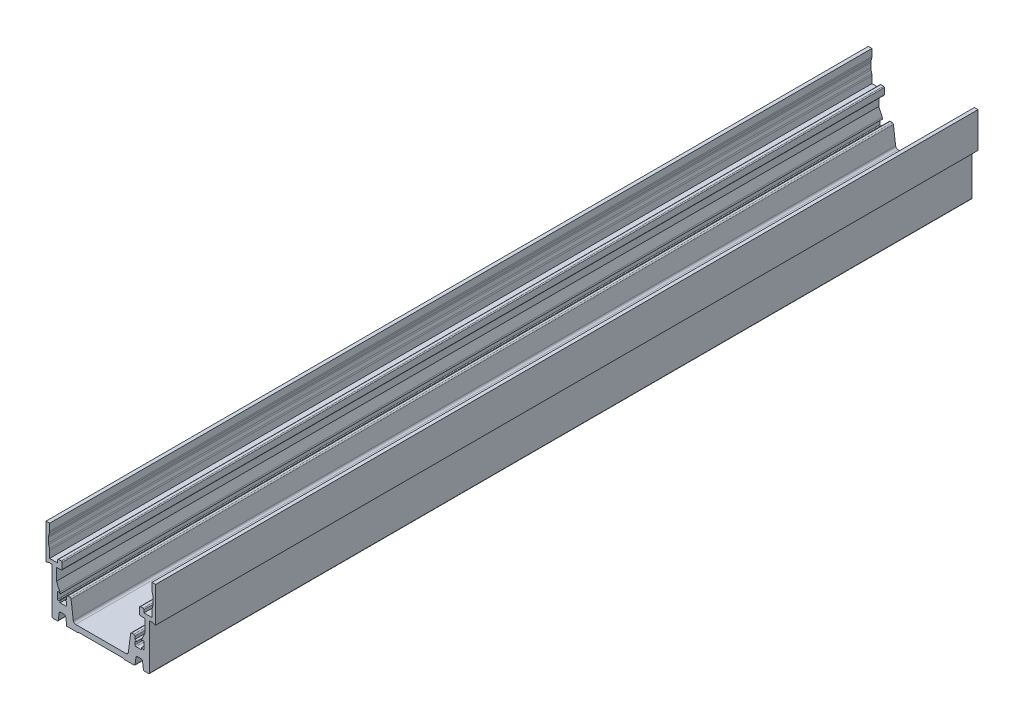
ISO-10303-21;
HEADER;
FILE_DESCRIPTION(('STEP AP214'),'2;1');
FILE_NAME('part.step','',(''),(''),'','','');
FILE_SCHEMA(('AUTOMOTIVE_DESIGN { 1 0 10303 214 1 1 1 1 }'));
ENDSEC;
DATA;
#1=APPLICATION_CONTEXT('core data for automotive mechanical design processes');
#2=APPLICATION_PROTOCOL_DEFINITION('international standard','automotive_design',2000,#1);
#3=PRODUCT_CONTEXT('',#1,'mechanical');
#4=PRODUCT('Part','Part','',(#3));
#5=PRODUCT_RELATED_PRODUCT_CATEGORY('part','',(#4));
#6=PRODUCT_DEFINITION_FORMATION('','',#4);
#7=PRODUCT_DEFINITION_CONTEXT('part definition',#1,'design');
#8=PRODUCT_DEFINITION('design','',#6,#7);
#9=PRODUCT_DEFINITION_SHAPE('','',#8);
#10=(LENGTH_UNIT() NAMED_UNIT(*) SI_UNIT(.MILLI.,.METRE.));
#11=(NAMED_UNIT(*) PLANE_ANGLE_UNIT() SI_UNIT($,.RADIAN.));
#12=(NAMED_UNIT(*) SI_UNIT($,.STERADIAN.) SOLID_ANGLE_UNIT());
#13=UNCERTAINTY_MEASURE_WITH_UNIT(LENGTH_MEASURE(1.E-05),#10,'distance_accuracy_value','');
#14=(GEOMETRIC_REPRESENTATION_CONTEXT(3) GLOBAL_UNCERTAINTY_ASSIGNED_CONTEXT((#13)) GLOBAL_UNIT_ASSIGNED_CONTEXT((#10,
#11,#12)) REPRESENTATION_CONTEXT('',''));
#15=CARTESIAN_POINT('',(0.,0.,0.));
#16=DIRECTION('',(0.,0.,1.));
#17=DIRECTION('',(1.,0.,0.));
#18=AXIS2_PLACEMENT_3D('',#15,#16,#17);
#19=CARTESIAN_POINT('',(-18.,26.302,270.));
#20=DIRECTION('',(1.,0.,0.));
#21=DIRECTION('',(0.,0.,-1.));
#22=AXIS2_PLACEMENT_3D('',#19,#20,#21);
#23=PLANE('',#22);
#24=DIRECTION('',(0.,-1.,0.));
#25=VECTOR('',#24,1.);
#26=CARTESIAN_POINT('',(-18.,26.302,0.));
#27=LINE('',#26,#25);
#28=CARTESIAN_POINT('',(-18.,26.302,0.));
#29=VERTEX_POINT('',#28);
#30=CARTESIAN_POINT('',(-18.,14.6986296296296,0.));
#31=VERTEX_POINT('',#30);
#32=EDGE_CURVE('E717',#29,#31,#27,.T.);
#33=ORIENTED_EDGE('',*,*,#32,.T.);
#34=DIRECTION('',(0.,0.,-1.));
#35=VECTOR('',#34,1.);
#36=CARTESIAN_POINT('',(-18.,14.6986296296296,270.));
#37=LINE('',#36,#35);
#38=CARTESIAN_POINT('',(-18.,14.6986296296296,270.));
#39=VERTEX_POINT('',#38);
#40=EDGE_CURVE('E9',#39,#31,#37,.T.);
#41=ORIENTED_EDGE('',*,*,#40,.F.);
#42=DIRECTION('',(0.,-1.,0.));
#43=VECTOR('',#42,1.);
#44=CARTESIAN_POINT('',(-18.,26.302,270.));
#45=LINE('',#44,#43);
#46=CARTESIAN_POINT('',(-18.,26.302,270.));
#47=VERTEX_POINT('',#46);
#48=EDGE_CURVE('E975',#47,#39,#45,.T.);
#49=ORIENTED_EDGE('',*,*,#48,.F.);
#50=DIRECTION('',(0.,0.,-1.));
#51=VECTOR('',#50,1.);
#52=CARTESIAN_POINT('',(-18.,26.302,270.));
#53=LINE('',#52,#51);
#54=EDGE_CURVE('E713',#47,#29,#53,.T.);
#55=ORIENTED_EDGE('',*,*,#54,.T.);
#56=EDGE_LOOP('',(#33,#41,#49,#55));
#57=FACE_BOUND('',#56,.T.);
#58=ADVANCED_FACE('F14',(#57),#23,.F.);
#59=CARTESIAN_POINT('',(-18.,14.6986296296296,270.));
#60=DIRECTION('',(-0.287144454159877,0.957887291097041,0.));
#61=DIRECTION('',(-0.957887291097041,-0.287144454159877,0.));
#62=AXIS2_PLACEMENT_3D('',#59,#60,#61);
#63=PLANE('',#62);
#64=DIRECTION('',(0.957887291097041,0.287144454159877,0.));
#65=VECTOR('',#64,1.);
#66=CARTESIAN_POINT('',(-18.,14.6986296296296,0.));
#67=LINE('',#66,#65);
#68=CARTESIAN_POINT('',(-17.008,14.996,0.));
#69=VERTEX_POINT('',#68);
#70=EDGE_CURVE('E720',#31,#69,#67,.T.);
#71=ORIENTED_EDGE('',*,*,#70,.T.);
#72=DIRECTION('',(0.,0.,-1.));
#73=VECTOR('',#72,1.);
#74=CARTESIAN_POINT('',(-17.008,14.996,270.));
#75=LINE('',#74,#73);
#76=CARTESIAN_POINT('',(-17.008,14.996,270.));
#77=VERTEX_POINT('',#76);
#78=EDGE_CURVE('E22',#77,#69,#75,.T.);
#79=ORIENTED_EDGE('',*,*,#78,.F.);
#80=DIRECTION('',(0.957887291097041,0.287144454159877,0.));
#81=VECTOR('',#80,1.);
#82=CARTESIAN_POINT('',(-18.,14.6986296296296,270.));
#83=LINE('',#82,#81);
#84=EDGE_CURVE('E376',#39,#77,#83,.T.);
#85=ORIENTED_EDGE('',*,*,#84,.F.);
#86=ORIENTED_EDGE('',*,*,#40,.T.);
#87=EDGE_LOOP('',(#71,#79,#85,#86));
#88=FACE_BOUND('',#87,.T.);
#89=ADVANCED_FACE('F1517',(#88),#63,.F.);
#90=CARTESIAN_POINT('',(-17.008,14.996,270.));
#91=DIRECTION('',(0.,1.,0.));
#92=DIRECTION('',(0.,0.,1.));
#93=AXIS2_PLACEMENT_3D('',#90,#91,#92);
#94=PLANE('',#93);
#95=DIRECTION('',(1.,0.,0.));
#96=VECTOR('',#95,1.);
#97=CARTESIAN_POINT('',(-17.008,14.996,0.));
#98=LINE('',#97,#96);
#99=CARTESIAN_POINT('',(-16.,14.996,0.));
#100=VERTEX_POINT('',#99);
#101=EDGE_CURVE('E722',#69,#100,#98,.T.);
#102=ORIENTED_EDGE('',*,*,#101,.T.);
#103=DIRECTION('',(0.,0.,-1.));
#104=VECTOR('',#103,1.);
#105=CARTESIAN_POINT('',(-16.,14.996,270.));
#106=LINE('',#105,#104);
#107=CARTESIAN_POINT('',(-16.,14.996,270.));
#108=VERTEX_POINT('',#107);
#109=EDGE_CURVE('E1243',#108,#100,#106,.T.);
#110=ORIENTED_EDGE('',*,*,#109,.F.);
#111=DIRECTION('',(1.,0.,0.));
#112=VECTOR('',#111,1.);
#113=CARTESIAN_POINT('',(-17.008,14.996,270.));
#114=LINE('',#113,#112);
#115=EDGE_CURVE('E1251',#77,#108,#114,.T.);
#116=ORIENTED_EDGE('',*,*,#115,.F.);
#117=ORIENTED_EDGE('',*,*,#78,.T.);
#118=EDGE_LOOP('',(#102,#110,#116,#117));
#119=FACE_BOUND('',#118,.T.);
#120=ADVANCED_FACE('F1249',(#119),#94,.F.);
#121=CARTESIAN_POINT('',(-16.,14.996,270.));
#122=DIRECTION('',(1.,0.,0.));
#123=DIRECTION('',(0.,0.,-1.));
#124=AXIS2_PLACEMENT_3D('',#121,#122,#123);
#125=PLANE('',#124);
#126=DIRECTION('',(0.,-1.,0.));
#127=VECTOR('',#126,1.);
#128=CARTESIAN_POINT('',(-16.,14.996,0.));
#129=LINE('',#128,#127);
#130=CARTESIAN_POINT('',(-16.,0.0999999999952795,0.));
#131=VERTEX_POINT('',#130);
#132=EDGE_CURVE('E724',#100,#131,#129,.T.);
#133=ORIENTED_EDGE('',*,*,#132,.T.);
#134=DIRECTION('',(0.,0.,-1.));
#135=VECTOR('',#134,1.);
#136=CARTESIAN_POINT('',(-16.,0.0999999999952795,270.));
#137=LINE('',#136,#135);
#138=CARTESIAN_POINT('',(-16.,0.0999999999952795,270.));
#139=VERTEX_POINT('',#138);
#140=EDGE_CURVE('E1240',#139,#131,#137,.T.);
#141=ORIENTED_EDGE('',*,*,#140,.F.);
#142=DIRECTION('',(0.,-1.,0.));
#143=VECTOR('',#142,1.);
#144=CARTESIAN_POINT('',(-16.,14.996,270.));
#145=LINE('',#144,#143);
#146=EDGE_CURVE('E1269',#108,#139,#145,.T.);
#147=ORIENTED_EDGE('',*,*,#146,.F.);
#148=ORIENTED_EDGE('',*,*,#109,.T.);
#149=EDGE_LOOP('',(#133,#141,#147,#148));
#150=FACE_BOUND('',#149,.T.);
#151=ADVANCED_FACE('F1260',(#150),#125,.F.);
#152=CARTESIAN_POINT('',(-15.702,0.0999999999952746,270.));
#153=DIRECTION('',(0.,0.,-1.));
#154=DIRECTION('',(-1.,0.,0.));
#155=AXIS2_PLACEMENT_3D('',#152,#153,#154);
#156=CYLINDRICAL_SURFACE('',#155,0.298);
#157=CARTESIAN_POINT('',(-15.702,0.0999999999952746,0.));
#158=DIRECTION('',(0.,0.,1.));
#159=DIRECTION('',(1.,0.,0.));
#160=AXIS2_PLACEMENT_3D('',#157,#158,#159);
#161=CIRCLE('',#160,0.298);
#162=CARTESIAN_POINT('',(-15.7020016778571,-0.198,0.));
#163=VERTEX_POINT('',#162);
#164=EDGE_CURVE('E726',#131,#163,#161,.T.);
#165=ORIENTED_EDGE('',*,*,#164,.T.);
#166=DIRECTION('',(0.,0.,-1.));
#167=VECTOR('',#166,1.);
#168=CARTESIAN_POINT('',(-15.7020016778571,-0.198,270.));
#169=LINE('',#168,#167);
#170=CARTESIAN_POINT('',(-15.7020016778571,-0.198,270.));
#171=VERTEX_POINT('',#170);
#172=EDGE_CURVE('E1237',#171,#163,#169,.T.);
#173=ORIENTED_EDGE('',*,*,#172,.F.);
#174=CARTESIAN_POINT('',(-15.702,0.0999999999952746,270.));
#175=DIRECTION('',(0.,0.,1.));
#176=DIRECTION('',(1.,0.,0.));
#177=AXIS2_PLACEMENT_3D('',#174,#175,#176);
#178=CIRCLE('',#177,0.298);
#179=EDGE_CURVE('E1266',#139,#171,#178,.T.);
#180=ORIENTED_EDGE('',*,*,#179,.F.);
#181=ORIENTED_EDGE('',*,*,#140,.T.);
#182=EDGE_LOOP('',(#165,#173,#180,#181));
#183=FACE_BOUND('',#182,.T.);
#184=ADVANCED_FACE('F1264',(#183),#156,.T.);
#185=CARTESIAN_POINT('',(-15.7020016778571,-0.198,270.));
#186=DIRECTION('',(0.,1.,0.));
#187=DIRECTION('',(0.,0.,1.));
#188=AXIS2_PLACEMENT_3D('',#185,#186,#187);
#189=PLANE('',#188);
#190=DIRECTION('',(1.,0.,0.));
#191=VECTOR('',#190,1.);
#192=CARTESIAN_POINT('',(-15.7020016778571,-0.198,0.));
#193=LINE('',#192,#191);
#194=CARTESIAN_POINT('',(-14.2773032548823,-0.198,0.));
#195=VERTEX_POINT('',#194);
#196=EDGE_CURVE('E728',#163,#195,#193,.T.);
#197=ORIENTED_EDGE('',*,*,#196,.T.);
#198=DIRECTION('',(0.,0.,-1.));
#199=VECTOR('',#198,1.);
#200=CARTESIAN_POINT('',(-14.2773032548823,-0.198,270.));
#201=LINE('',#200,#199);
#202=CARTESIAN_POINT('',(-14.2773032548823,-0.198,270.));
#203=VERTEX_POINT('',#202);
#204=EDGE_CURVE('E1234',#203,#195,#201,.T.);
#205=ORIENTED_EDGE('',*,*,#204,.F.);
#206=DIRECTION('',(1.,0.,0.));
#207=VECTOR('',#206,1.);
#208=CARTESIAN_POINT('',(-15.7020016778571,-0.198,270.));
#209=LINE('',#208,#207);
#210=EDGE_CURVE('E1268',#171,#203,#209,.T.);
#211=ORIENTED_EDGE('',*,*,#210,.F.);
#212=ORIENTED_EDGE('',*,*,#172,.T.);
#213=EDGE_LOOP('',(#197,#205,#211,#212));
#214=FACE_BOUND('',#213,.T.);
#215=ADVANCED_FACE('F2550',(#214),#189,.F.);
#216=CARTESIAN_POINT('',(-14.2773038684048,0.0999999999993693,270.));
#217=DIRECTION('',(0.,0.,-1.));
#218=DIRECTION('',(-1.,0.,0.));
#219=AXIS2_PLACEMENT_3D('',#216,#217,#218);
#220=CYLINDRICAL_SURFACE('',#219,0.298);
#221=CARTESIAN_POINT('',(-14.2773038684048,0.0999999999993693,0.));
#222=DIRECTION('',(0.,0.,1.));
#223=DIRECTION('',(1.,0.,0.));
#224=AXIS2_PLACEMENT_3D('',#221,#222,#223);
#225=CIRCLE('',#224,0.298);
#226=CARTESIAN_POINT('',(-13.9819190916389,0.0606066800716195,0.));
#227=VERTEX_POINT('',#226);
#228=EDGE_CURVE('E730',#195,#227,#225,.T.);
#229=ORIENTED_EDGE('',*,*,#228,.T.);
#230=DIRECTION('',(0.,0.,-1.));
#231=VECTOR('',#230,1.);
#232=CARTESIAN_POINT('',(-13.9819190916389,0.0606066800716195,270.));
#233=LINE('',#232,#231);
#234=CARTESIAN_POINT('',(-13.9819190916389,0.0606066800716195,270.));
#235=VERTEX_POINT('',#234);
#236=EDGE_CURVE('E1231',#235,#227,#233,.T.);
#237=ORIENTED_EDGE('',*,*,#236,.F.);
#238=CARTESIAN_POINT('',(-14.2773038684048,0.0999999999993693,270.));
#239=DIRECTION('',(0.,0.,1.));
#240=DIRECTION('',(1.,0.,0.));
#241=AXIS2_PLACEMENT_3D('',#238,#239,#240);
#242=CIRCLE('',#241,0.298);
#243=EDGE_CURVE('E1271',#203,#235,#242,.T.);
#244=ORIENTED_EDGE('',*,*,#243,.F.);
#245=ORIENTED_EDGE('',*,*,#204,.T.);
#246=EDGE_LOOP('',(#229,#237,#244,#245));
#247=FACE_BOUND('',#246,.T.);
#248=ADVANCED_FACE('F2540',(#247),#220,.T.);
#249=CARTESIAN_POINT('',(-13.9819190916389,0.0606066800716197,270.));
#250=DIRECTION('',(-0.991224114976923,0.132192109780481,0.));
#251=DIRECTION('',(-0.132192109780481,-0.991224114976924,0.));
#252=AXIS2_PLACEMENT_3D('',#249,#250,#251);
#253=PLANE('',#252);
#254=DIRECTION('',(0.132192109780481,0.991224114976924,0.));
#255=VECTOR('',#254,1.);
#256=CARTESIAN_POINT('',(-13.9819190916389,0.0606066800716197,0.));
#257=LINE('',#256,#255);
#258=CARTESIAN_POINT('',(-13.6770576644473,2.34656761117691,0.));
#259=VERTEX_POINT('',#258);
#260=EDGE_CURVE('E732',#227,#259,#257,.T.);
#261=ORIENTED_EDGE('',*,*,#260,.T.);
#262=DIRECTION('',(0.,0.,-1.));
#263=VECTOR('',#262,1.);
#264=CARTESIAN_POINT('',(-13.6770576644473,2.34656761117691,270.));
#265=LINE('',#264,#263);
#266=CARTESIAN_POINT('',(-13.6770576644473,2.34656761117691,270.));
#267=VERTEX_POINT('',#266);
#268=EDGE_CURVE('E1229',#267,#259,#265,.T.);
#269=ORIENTED_EDGE('',*,*,#268,.F.);
#270=DIRECTION('',(0.132192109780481,0.991224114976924,0.));
#271=VECTOR('',#270,1.);
#272=CARTESIAN_POINT('',(-13.9819190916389,0.0606066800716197,270.));
#273=LINE('',#272,#271);
#274=EDGE_CURVE('E1277',#235,#267,#273,.T.);
#275=ORIENTED_EDGE('',*,*,#274,.F.);
#276=ORIENTED_EDGE('',*,*,#236,.T.);
#277=EDGE_LOOP('',(#261,#269,#275,#276));
#278=FACE_BOUND('',#277,.T.);
#279=ADVANCED_FACE('F2530',(#278),#253,.F.);
#280=CARTESIAN_POINT('',(-13.1854105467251,2.281,270.));
#281=DIRECTION('',(0.,0.,-1.));
#282=DIRECTION('',(-1.,0.,0.));
#283=AXIS2_PLACEMENT_3D('',#280,#281,#282);
#284=CYLINDRICAL_SURFACE('',#283,0.496);
#285=CARTESIAN_POINT('',(-13.1854105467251,2.281,0.));
#286=DIRECTION('',(0.,0.,1.));
#287=DIRECTION('',(1.,0.,0.));
#288=AXIS2_PLACEMENT_3D('',#285,#286,#287);
#289=CIRCLE('',#288,0.496);
#290=CARTESIAN_POINT('',(-13.1854106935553,2.777,0.));
#291=VERTEX_POINT('',#290);
#292=EDGE_CURVE('E735',#291,#259,#289,.T.);
#293=ORIENTED_EDGE('',*,*,#292,.F.);
#294=DIRECTION('',(0.,0.,-1.));
#295=VECTOR('',#294,1.);
#296=CARTESIAN_POINT('',(-13.1854106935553,2.777,270.));
#297=LINE('',#296,#295);
#298=CARTESIAN_POINT('',(-13.1854106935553,2.777,270.));
#299=VERTEX_POINT('',#298);
#300=EDGE_CURVE('E1227',#299,#291,#297,.T.);
#301=ORIENTED_EDGE('',*,*,#300,.F.);
#302=CARTESIAN_POINT('',(-13.1854105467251,2.281,270.));
#303=DIRECTION('',(0.,0.,1.));
#304=DIRECTION('',(1.,0.,0.));
#305=AXIS2_PLACEMENT_3D('',#302,#303,#304);
#306=CIRCLE('',#305,0.496);
#307=EDGE_CURVE('E1279',#299,#267,#306,.T.);
#308=ORIENTED_EDGE('',*,*,#307,.T.);
#309=ORIENTED_EDGE('',*,*,#268,.T.);
#310=EDGE_LOOP('',(#293,#301,#308,#309));
#311=FACE_BOUND('',#310,.T.);
#312=ADVANCED_FACE('F2520',(#311),#284,.F.);
#313=CARTESIAN_POINT('',(-13.1854106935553,2.777,270.));
#314=DIRECTION('',(0.,1.,0.));
#315=DIRECTION('',(0.,0.,1.));
#316=AXIS2_PLACEMENT_3D('',#313,#314,#315);
#317=PLANE('',#316);
#318=DIRECTION('',(1.,0.,0.));
#319=VECTOR('',#318,1.);
#320=CARTESIAN_POINT('',(-13.1854106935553,2.777,0.));
#321=LINE('',#320,#319);
#322=CARTESIAN_POINT('',(-12.0205892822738,2.777,0.));
#323=VERTEX_POINT('',#322);
#324=EDGE_CURVE('E738',#291,#323,#321,.T.);
#325=ORIENTED_EDGE('',*,*,#324,.T.);
#326=DIRECTION('',(0.,0.,-1.));
#327=VECTOR('',#326,1.);
#328=CARTESIAN_POINT('',(-12.0205892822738,2.777,270.));
#329=LINE('',#328,#327);
#330=CARTESIAN_POINT('',(-12.0205892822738,2.777,270.));
#331=VERTEX_POINT('',#330);
#332=EDGE_CURVE('E1225',#331,#323,#329,.T.);
#333=ORIENTED_EDGE('',*,*,#332,.F.);
#334=DIRECTION('',(1.,0.,0.));
#335=VECTOR('',#334,1.);
#336=CARTESIAN_POINT('',(-13.1854106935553,2.777,270.));
#337=LINE('',#336,#335);
#338=EDGE_CURVE('E1282',#299,#331,#337,.T.);
#339=ORIENTED_EDGE('',*,*,#338,.F.);
#340=ORIENTED_EDGE('',*,*,#300,.T.);
#341=EDGE_LOOP('',(#325,#333,#339,#340));
#342=FACE_BOUND('',#341,.T.);
#343=ADVANCED_FACE('F2510',(#342),#317,.F.);
#344=CARTESIAN_POINT('',(-12.0205895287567,2.28100000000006,270.));
#345=DIRECTION('',(0.,0.,-1.));
#346=DIRECTION('',(-1.,0.,0.));
#347=AXIS2_PLACEMENT_3D('',#344,#345,#346);
#348=CYLINDRICAL_SURFACE('',#347,0.496);
#349=CARTESIAN_POINT('',(-12.0205895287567,2.28100000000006,0.));
#350=DIRECTION('',(0.,0.,1.));
#351=DIRECTION('',(1.,0.,0.));
#352=AXIS2_PLACEMENT_3D('',#349,#350,#351);
#353=CIRCLE('',#352,0.496);
#354=CARTESIAN_POINT('',(-11.5289320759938,2.34649006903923,0.));
#355=VERTEX_POINT('',#354);
#356=EDGE_CURVE('E741',#355,#323,#353,.T.);
#357=ORIENTED_EDGE('',*,*,#356,.F.);
#358=DIRECTION('',(0.,0.,-1.));
#359=VECTOR('',#358,1.);
#360=CARTESIAN_POINT('',(-11.5289320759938,2.34649006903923,270.));
#361=LINE('',#360,#359);
#362=CARTESIAN_POINT('',(-11.5289320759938,2.34649006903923,270.));
#363=VERTEX_POINT('',#362);
#364=EDGE_CURVE('E1223',#363,#355,#361,.T.);
#365=ORIENTED_EDGE('',*,*,#364,.F.);
#366=CARTESIAN_POINT('',(-12.0205895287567,2.28100000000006,270.));
#367=DIRECTION('',(0.,0.,1.));
#368=DIRECTION('',(1.,0.,0.));
#369=AXIS2_PLACEMENT_3D('',#366,#367,#368);
#370=CIRCLE('',#369,0.496);
#371=EDGE_CURVE('E1284',#363,#331,#370,.T.);
#372=ORIENTED_EDGE('',*,*,#371,.T.);
#373=ORIENTED_EDGE('',*,*,#332,.T.);
#374=EDGE_LOOP('',(#357,#365,#372,#373));
#375=FACE_BOUND('',#374,.T.);
#376=ADVANCED_FACE('F2500',(#375),#348,.F.);
#377=CARTESIAN_POINT('',(-11.5289320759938,2.34649006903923,270.));
#378=DIRECTION('',(0.991244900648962,0.132036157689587,0.));
#379=DIRECTION('',(-0.132036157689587,0.991244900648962,0.));
#380=AXIS2_PLACEMENT_3D('',#377,#378,#379);
#381=PLANE('',#380);
#382=DIRECTION('',(0.132036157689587,-0.991244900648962,0.));
#383=VECTOR('',#382,1.);
#384=CARTESIAN_POINT('',(-11.5289320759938,2.34649006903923,0.));
#385=LINE('',#384,#383);
#386=CARTESIAN_POINT('',(-11.19,-0.198,0.));
#387=VERTEX_POINT('',#386);
#388=EDGE_CURVE('E744',#355,#387,#385,.T.);
#389=ORIENTED_EDGE('',*,*,#388,.T.);
#390=DIRECTION('',(0.,0.,-1.));
#391=VECTOR('',#390,1.);
#392=CARTESIAN_POINT('',(-11.19,-0.198,270.));
#393=LINE('',#392,#391);
#394=CARTESIAN_POINT('',(-11.19,-0.198,270.));
#395=VERTEX_POINT('',#394);
#396=EDGE_CURVE('E1220',#395,#387,#393,.T.);
#397=ORIENTED_EDGE('',*,*,#396,.F.);
#398=DIRECTION('',(0.132036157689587,-0.991244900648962,0.));
#399=VECTOR('',#398,1.);
#400=CARTESIAN_POINT('',(-11.5289320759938,2.34649006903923,270.));
#401=LINE('',#400,#399);
#402=EDGE_CURVE('E1287',#363,#395,#401,.T.);
#403=ORIENTED_EDGE('',*,*,#402,.F.);
#404=ORIENTED_EDGE('',*,*,#364,.T.);
#405=EDGE_LOOP('',(#389,#397,#403,#404));
#406=FACE_BOUND('',#405,.T.);
#407=ADVANCED_FACE('F2490',(#406),#381,.F.);
#408=CARTESIAN_POINT('',(-11.19,-0.198,270.));
#409=DIRECTION('',(0.,1.,0.));
#410=DIRECTION('',(-1.,0.,0.));
#411=AXIS2_PLACEMENT_3D('',#408,#409,#410);
#412=PLANE('',#411);
#413=DIRECTION('',(1.,0.,0.));
#414=VECTOR('',#413,1.);
#415=CARTESIAN_POINT('',(-11.19,-0.198,0.));
#416=LINE('',#415,#414);
#417=CARTESIAN_POINT('',(-7.663,-0.198,0.));
#418=VERTEX_POINT('',#417);
#419=EDGE_CURVE('E746',#387,#418,#416,.T.);
#420=ORIENTED_EDGE('',*,*,#419,.T.);
#421=DIRECTION('',(0.,0.,-1.));
#422=VECTOR('',#421,1.);
#423=CARTESIAN_POINT('',(-7.663,-0.198,270.));
#424=LINE('',#423,#422);
#425=CARTESIAN_POINT('',(-7.663,-0.198,270.));
#426=VERTEX_POINT('',#425);
#427=EDGE_CURVE('E1218',#426,#418,#424,.T.);
#428=ORIENTED_EDGE('',*,*,#427,.F.);
#429=DIRECTION('',(1.,0.,0.));
#430=VECTOR('',#429,1.);
#431=CARTESIAN_POINT('',(-11.19,-0.198,270.));
#432=LINE('',#431,#430);
#433=EDGE_CURVE('E1289',#395,#426,#432,.T.);
#434=ORIENTED_EDGE('',*,*,#433,.F.);
#435=ORIENTED_EDGE('',*,*,#396,.T.);
#436=EDGE_LOOP('',(#420,#428,#434,#435));
#437=FACE_BOUND('',#436,.T.);
#438=ADVANCED_FACE('F2480',(#437),#412,.F.);
#439=CARTESIAN_POINT('',(-7.14898437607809,-0.752368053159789,270.));
#440=DIRECTION('',(0.,0.,-1.));
#441=DIRECTION('',(-1.,0.,0.));
#442=AXIS2_PLACEMENT_3D('',#439,#440,#441);
#443=CYLINDRICAL_SURFACE('',#442,0.756);
#444=CARTESIAN_POINT('',(-7.14898437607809,-0.752368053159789,0.));
#445=DIRECTION('',(0.,0.,1.));
#446=DIRECTION('',(1.,0.,0.));
#447=AXIS2_PLACEMENT_3D('',#444,#445,#446);
#448=CIRCLE('',#447,0.756);
#449=CARTESIAN_POINT('',(-7.223,0.,0.));
#450=VERTEX_POINT('',#449);
#451=EDGE_CURVE('E749',#450,#418,#448,.T.);
#452=ORIENTED_EDGE('',*,*,#451,.F.);
#453=DIRECTION('',(0.,0.,-1.));
#454=VECTOR('',#453,1.);
#455=CARTESIAN_POINT('',(-7.223,0.,270.));
#456=LINE('',#455,#454);
#457=CARTESIAN_POINT('',(-7.223,0.,270.));
#458=VERTEX_POINT('',#457);
#459=EDGE_CURVE('E1216',#458,#450,#456,.T.);
#460=ORIENTED_EDGE('',*,*,#459,.F.);
#461=CARTESIAN_POINT('',(-7.14898437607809,-0.752368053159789,270.));
#462=DIRECTION('',(0.,0.,1.));
#463=DIRECTION('',(1.,0.,0.));
#464=AXIS2_PLACEMENT_3D('',#461,#462,#463);
#465=CIRCLE('',#464,0.756);
#466=EDGE_CURVE('E1291',#458,#426,#465,.T.);
#467=ORIENTED_EDGE('',*,*,#466,.T.);
#468=ORIENTED_EDGE('',*,*,#427,.T.);
#469=EDGE_LOOP('',(#452,#460,#467,#468));
#470=FACE_BOUND('',#469,.T.);
#471=ADVANCED_FACE('F2470',(#470),#443,.F.);
#472=CARTESIAN_POINT('',(-7.223,0.,270.));
#473=DIRECTION('',(0.,1.,0.));
#474=DIRECTION('',(0.,0.,1.));
#475=AXIS2_PLACEMENT_3D('',#472,#473,#474);
#476=PLANE('',#475);
#477=DIRECTION('',(1.,0.,0.));
#478=VECTOR('',#477,1.);
#479=CARTESIAN_POINT('',(-7.223,0.,0.));
#480=LINE('',#479,#478);
#481=CARTESIAN_POINT('',(7.223,0.,0.));
#482=VERTEX_POINT('',#481);
#483=EDGE_CURVE('E752',#450,#482,#480,.T.);
#484=ORIENTED_EDGE('',*,*,#483,.T.);
#485=DIRECTION('',(0.,0.,-1.));
#486=VECTOR('',#485,1.);
#487=CARTESIAN_POINT('',(7.223,0.,270.));
#488=LINE('',#487,#486);
#489=CARTESIAN_POINT('',(7.223,0.,270.));
#490=VERTEX_POINT('',#489);
#491=EDGE_CURVE('E1214',#490,#482,#488,.T.);
#492=ORIENTED_EDGE('',*,*,#491,.F.);
#493=DIRECTION('',(1.,0.,0.));
#494=VECTOR('',#493,1.);
#495=CARTESIAN_POINT('',(-7.223,0.,270.));
#496=LINE('',#495,#494);
#497=EDGE_CURVE('E1294',#458,#490,#496,.T.);
#498=ORIENTED_EDGE('',*,*,#497,.F.);
#499=ORIENTED_EDGE('',*,*,#459,.T.);
#500=EDGE_LOOP('',(#484,#492,#498,#499));
#501=FACE_BOUND('',#500,.T.);
#502=ADVANCED_FACE('F2460',(#501),#476,.F.);
#503=CARTESIAN_POINT('',(7.14898437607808,-0.752368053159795,270.));
#504=DIRECTION('',(0.,0.,-1.));
#505=DIRECTION('',(-1.,0.,0.));
#506=AXIS2_PLACEMENT_3D('',#503,#504,#505);
#507=CYLINDRICAL_SURFACE('',#506,0.756);
#508=CARTESIAN_POINT('',(7.14898437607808,-0.752368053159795,0.));
#509=DIRECTION('',(0.,0.,1.));
#510=DIRECTION('',(1.,0.,0.));
#511=AXIS2_PLACEMENT_3D('',#508,#509,#510);
#512=CIRCLE('',#511,0.756);
#513=CARTESIAN_POINT('',(7.663,-0.198,0.));
#514=VERTEX_POINT('',#513);
#515=EDGE_CURVE('E755',#514,#482,#512,.T.);
#516=ORIENTED_EDGE('',*,*,#515,.F.);
#517=DIRECTION('',(0.,0.,-1.));
#518=VECTOR('',#517,1.);
#519=CARTESIAN_POINT('',(7.663,-0.198,270.));
#520=LINE('',#519,#518);
#521=CARTESIAN_POINT('',(7.663,-0.198,270.));
#522=VERTEX_POINT('',#521);
#523=EDGE_CURVE('E1212',#522,#514,#520,.T.);
#524=ORIENTED_EDGE('',*,*,#523,.F.);
#525=CARTESIAN_POINT('',(7.14898437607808,-0.752368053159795,270.));
#526=DIRECTION('',(0.,0.,1.));
#527=DIRECTION('',(1.,0.,0.));
#528=AXIS2_PLACEMENT_3D('',#525,#526,#527);
#529=CIRCLE('',#528,0.756);
#530=EDGE_CURVE('E1296',#522,#490,#529,.T.);
#531=ORIENTED_EDGE('',*,*,#530,.T.);
#532=ORIENTED_EDGE('',*,*,#491,.T.);
#533=EDGE_LOOP('',(#516,#524,#531,#532));
#534=FACE_BOUND('',#533,.T.);
#535=ADVANCED_FACE('F2450',(#534),#507,.F.);
#536=CARTESIAN_POINT('',(7.663,-0.198,270.));
#537=DIRECTION('',(0.,1.,0.));
#538=DIRECTION('',(-1.,0.,0.));
#539=AXIS2_PLACEMENT_3D('',#536,#537,#538);
#540=PLANE('',#539);
#541=DIRECTION('',(1.,0.,0.));
#542=VECTOR('',#541,1.);
#543=CARTESIAN_POINT('',(7.663,-0.198,0.));
#544=LINE('',#543,#542);
#545=CARTESIAN_POINT('',(10.93,-0.198,0.));
#546=VERTEX_POINT('',#545);
#547=EDGE_CURVE('E758',#514,#546,#544,.T.);
#548=ORIENTED_EDGE('',*,*,#547,.T.);
#549=DIRECTION('',(0.,0.,-1.));
#550=VECTOR('',#549,1.);
#551=CARTESIAN_POINT('',(10.93,-0.198,270.));
#552=LINE('',#551,#550);
#553=CARTESIAN_POINT('',(10.93,-0.198,270.));
#554=VERTEX_POINT('',#553);
#555=EDGE_CURVE('E1209',#554,#546,#552,.T.);
#556=ORIENTED_EDGE('',*,*,#555,.F.);
#557=DIRECTION('',(1.,0.,0.));
#558=VECTOR('',#557,1.);
#559=CARTESIAN_POINT('',(7.663,-0.198,270.));
#560=LINE('',#559,#558);
#561=EDGE_CURVE('E1299',#522,#554,#560,.T.);
#562=ORIENTED_EDGE('',*,*,#561,.F.);
#563=ORIENTED_EDGE('',*,*,#523,.T.);
#564=EDGE_LOOP('',(#548,#556,#562,#563));
#565=FACE_BOUND('',#564,.T.);
#566=ADVANCED_FACE('F2440',(#565),#540,.F.);
#567=CARTESIAN_POINT('',(10.9286957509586,0.0999971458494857,270.));
#568=DIRECTION('',(0.,0.,-1.));
#569=DIRECTION('',(-1.,0.,0.));
#570=AXIS2_PLACEMENT_3D('',#567,#568,#569);
#571=CYLINDRICAL_SURFACE('',#570,0.298);
#572=CARTESIAN_POINT('',(10.9286957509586,0.0999971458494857,0.));
#573=DIRECTION('',(0.,0.,1.));
#574=DIRECTION('',(1.,0.,0.));
#575=AXIS2_PLACEMENT_3D('',#572,#573,#574);
#576=CIRCLE('',#575,0.298);
#577=CARTESIAN_POINT('',(11.2240805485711,0.0606039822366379,0.));
#578=VERTEX_POINT('',#577);
#579=EDGE_CURVE('E760',#546,#578,#576,.T.);
#580=ORIENTED_EDGE('',*,*,#579,.T.);
#581=DIRECTION('',(0.,0.,-1.));
#582=VECTOR('',#581,1.);
#583=CARTESIAN_POINT('',(11.2240805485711,0.0606039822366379,270.));
#584=LINE('',#583,#582);
#585=CARTESIAN_POINT('',(11.2240805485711,0.0606039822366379,270.));
#586=VERTEX_POINT('',#585);
#587=EDGE_CURVE('E1206',#586,#578,#584,.T.);
#588=ORIENTED_EDGE('',*,*,#587,.F.);
#589=CARTESIAN_POINT('',(10.9286957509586,0.0999971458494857,270.));
#590=DIRECTION('',(0.,0.,1.));
#591=DIRECTION('',(1.,0.,0.));
#592=AXIS2_PLACEMENT_3D('',#589,#590,#591);
#593=CIRCLE('',#592,0.298);
#594=EDGE_CURVE('E1301',#554,#586,#593,.T.);
#595=ORIENTED_EDGE('',*,*,#594,.F.);
#596=ORIENTED_EDGE('',*,*,#555,.T.);
#597=EDGE_LOOP('',(#580,#588,#595,#596));
#598=FACE_BOUND('',#597,.T.);
#599=ADVANCED_FACE('F2430',(#598),#571,.T.);
#600=CARTESIAN_POINT('',(11.2240805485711,0.0606039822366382,270.));
#601=DIRECTION('',(-0.991224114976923,0.132192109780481,0.));
#602=DIRECTION('',(-0.132192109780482,-0.991224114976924,0.));
#603=AXIS2_PLACEMENT_3D('',#600,#601,#602);
#604=PLANE('',#603);
#605=DIRECTION('',(0.132192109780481,0.991224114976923,0.));
#606=VECTOR('',#605,1.);
#607=CARTESIAN_POINT('',(11.2240805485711,0.0606039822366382,0.));
#608=LINE('',#607,#606);
#609=CARTESIAN_POINT('',(11.5289423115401,2.3465674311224,0.));
#610=VERTEX_POINT('',#609);
#611=EDGE_CURVE('E762',#578,#610,#608,.T.);
#612=ORIENTED_EDGE('',*,*,#611,.T.);
#613=DIRECTION('',(0.,0.,-1.));
#614=VECTOR('',#613,1.);
#615=CARTESIAN_POINT('',(11.5289423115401,2.3465674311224,270.));
#616=LINE('',#615,#614);
#617=CARTESIAN_POINT('',(11.5289423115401,2.3465674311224,270.));
#618=VERTEX_POINT('',#617);
#619=EDGE_CURVE('E1204',#618,#610,#616,.T.);
#620=ORIENTED_EDGE('',*,*,#619,.F.);
#621=DIRECTION('',(0.132192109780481,0.991224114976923,0.));
#622=VECTOR('',#621,1.);
#623=CARTESIAN_POINT('',(11.2240805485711,0.0606039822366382,270.));
#624=LINE('',#623,#622);
#625=EDGE_CURVE('E1303',#586,#618,#624,.T.);
#626=ORIENTED_EDGE('',*,*,#625,.F.);
#627=ORIENTED_EDGE('',*,*,#587,.T.);
#628=EDGE_LOOP('',(#612,#620,#626,#627));
#629=FACE_BOUND('',#628,.T.);
#630=ADVANCED_FACE('F2420',(#629),#604,.F.);
#631=CARTESIAN_POINT('',(12.020589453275,2.28100000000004,270.));
#632=DIRECTION('',(0.,0.,-1.));
#633=DIRECTION('',(-1.,0.,0.));
#634=AXIS2_PLACEMENT_3D('',#631,#632,#633);
#635=CYLINDRICAL_SURFACE('',#634,0.496);
#636=CARTESIAN_POINT('',(12.020589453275,2.28100000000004,0.));
#637=DIRECTION('',(0.,0.,1.));
#638=DIRECTION('',(1.,0.,0.));
#639=AXIS2_PLACEMENT_3D('',#636,#637,#638);
#640=CIRCLE('',#639,0.496);
#641=CARTESIAN_POINT('',(12.0205892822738,2.777,0.));
#642=VERTEX_POINT('',#641);
#643=EDGE_CURVE('E765',#642,#610,#640,.T.);
#644=ORIENTED_EDGE('',*,*,#643,.F.);
#645=DIRECTION('',(0.,0.,-1.));
#646=VECTOR('',#645,1.);
#647=CARTESIAN_POINT('',(12.0205892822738,2.777,270.));
#648=LINE('',#647,#646);
#649=CARTESIAN_POINT('',(12.0205892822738,2.777,270.));
#650=VERTEX_POINT('',#649);
#651=EDGE_CURVE('E1202',#650,#642,#648,.T.);
#652=ORIENTED_EDGE('',*,*,#651,.F.);
#653=CARTESIAN_POINT('',(12.020589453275,2.28100000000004,270.));
#654=DIRECTION('',(0.,0.,1.));
#655=DIRECTION('',(1.,0.,0.));
#656=AXIS2_PLACEMENT_3D('',#653,#654,#655);
#657=CIRCLE('',#656,0.496);
#658=EDGE_CURVE('E1305',#650,#618,#657,.T.);
#659=ORIENTED_EDGE('',*,*,#658,.T.);
#660=ORIENTED_EDGE('',*,*,#619,.T.);
#661=EDGE_LOOP('',(#644,#652,#659,#660));
#662=FACE_BOUND('',#661,.T.);
#663=ADVANCED_FACE('F2410',(#662),#635,.F.);
#664=CARTESIAN_POINT('',(12.0205892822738,2.777,270.));
#665=DIRECTION('',(0.,1.,0.));
#666=DIRECTION('',(0.,0.,1.));
#667=AXIS2_PLACEMENT_3D('',#664,#665,#666);
#668=PLANE('',#667);
#669=DIRECTION('',(1.,0.,0.));
#670=VECTOR('',#669,1.);
#671=CARTESIAN_POINT('',(12.0205892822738,2.777,0.));
#672=LINE('',#671,#670);
#673=CARTESIAN_POINT('',(13.1854106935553,2.777,0.));
#674=VERTEX_POINT('',#673);
#675=EDGE_CURVE('E768',#642,#674,#672,.T.);
#676=ORIENTED_EDGE('',*,*,#675,.T.);
#677=DIRECTION('',(0.,0.,-1.));
#678=VECTOR('',#677,1.);
#679=CARTESIAN_POINT('',(13.1854106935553,2.777,270.));
#680=LINE('',#679,#678);
#681=CARTESIAN_POINT('',(13.1854106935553,2.777,270.));
#682=VERTEX_POINT('',#681);
#683=EDGE_CURVE('E1200',#682,#674,#680,.T.);
#684=ORIENTED_EDGE('',*,*,#683,.F.);
#685=DIRECTION('',(1.,0.,0.));
#686=VECTOR('',#685,1.);
#687=CARTESIAN_POINT('',(12.0205892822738,2.777,270.));
#688=LINE('',#687,#686);
#689=EDGE_CURVE('E1308',#650,#682,#688,.T.);
#690=ORIENTED_EDGE('',*,*,#689,.F.);
#691=ORIENTED_EDGE('',*,*,#651,.T.);
#692=EDGE_LOOP('',(#676,#684,#690,#691));
#693=FACE_BOUND('',#692,.T.);
#694=ADVANCED_FACE('F2400',(#693),#668,.F.);
#695=CARTESIAN_POINT('',(13.1854105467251,2.281,270.));
#696=DIRECTION('',(0.,0.,-1.));
#697=DIRECTION('',(-1.,0.,0.));
#698=AXIS2_PLACEMENT_3D('',#695,#696,#697);
#699=CYLINDRICAL_SURFACE('',#698,0.496);
#700=CARTESIAN_POINT('',(13.1854105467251,2.281,0.));
#701=DIRECTION('',(0.,0.,1.));
#702=DIRECTION('',(1.,0.,0.));
#703=AXIS2_PLACEMENT_3D('',#700,#701,#702);
#704=CIRCLE('',#703,0.496);
#705=CARTESIAN_POINT('',(13.6770576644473,2.34656761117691,0.));
#706=VERTEX_POINT('',#705);
#707=EDGE_CURVE('E771',#706,#674,#704,.T.);
#708=ORIENTED_EDGE('',*,*,#707,.F.);
#709=DIRECTION('',(0.,0.,-1.));
#710=VECTOR('',#709,1.);
#711=CARTESIAN_POINT('',(13.6770576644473,2.34656761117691,270.));
#712=LINE('',#711,#710);
#713=CARTESIAN_POINT('',(13.6770576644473,2.34656761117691,270.));
#714=VERTEX_POINT('',#713);
#715=EDGE_CURVE('E1198',#714,#706,#712,.T.);
#716=ORIENTED_EDGE('',*,*,#715,.F.);
#717=CARTESIAN_POINT('',(13.1854105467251,2.281,270.));
#718=DIRECTION('',(0.,0.,1.));
#719=DIRECTION('',(1.,0.,0.));
#720=AXIS2_PLACEMENT_3D('',#717,#718,#719);
#721=CIRCLE('',#720,0.496);
#722=EDGE_CURVE('E1310',#714,#682,#721,.T.);
#723=ORIENTED_EDGE('',*,*,#722,.T.);
#724=ORIENTED_EDGE('',*,*,#683,.T.);
#725=EDGE_LOOP('',(#708,#716,#723,#724));
#726=FACE_BOUND('',#725,.T.);
#727=ADVANCED_FACE('F2390',(#726),#699,.F.);
#728=CARTESIAN_POINT('',(13.6770576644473,2.34656761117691,270.));
#729=DIRECTION('',(0.991224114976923,0.132192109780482,0.));
#730=DIRECTION('',(-0.132192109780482,0.991224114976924,0.));
#731=AXIS2_PLACEMENT_3D('',#728,#729,#730);
#732=PLANE('',#731);
#733=DIRECTION('',(0.132192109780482,-0.991224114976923,0.));
#734=VECTOR('',#733,1.);
#735=CARTESIAN_POINT('',(13.6770576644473,2.34656761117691,0.));
#736=LINE('',#735,#734);
#737=CARTESIAN_POINT('',(13.9819190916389,0.0606066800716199,0.));
#738=VERTEX_POINT('',#737);
#739=EDGE_CURVE('E774',#706,#738,#736,.T.);
#740=ORIENTED_EDGE('',*,*,#739,.T.);
#741=DIRECTION('',(0.,0.,-1.));
#742=VECTOR('',#741,1.);
#743=CARTESIAN_POINT('',(13.9819190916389,0.0606066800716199,270.));
#744=LINE('',#743,#742);
#745=CARTESIAN_POINT('',(13.9819190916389,0.0606066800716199,270.));
#746=VERTEX_POINT('',#745);
#747=EDGE_CURVE('E1195',#746,#738,#744,.T.);
#748=ORIENTED_EDGE('',*,*,#747,.F.);
#749=DIRECTION('',(0.132192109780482,-0.991224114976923,0.));
#750=VECTOR('',#749,1.);
#751=CARTESIAN_POINT('',(13.6770576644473,2.34656761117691,270.));
#752=LINE('',#751,#750);
#753=EDGE_CURVE('E1313',#714,#746,#752,.T.);
#754=ORIENTED_EDGE('',*,*,#753,.F.);
#755=ORIENTED_EDGE('',*,*,#715,.T.);
#756=EDGE_LOOP('',(#740,#748,#754,#755));
#757=FACE_BOUND('',#756,.T.);
#758=ADVANCED_FACE('F2380',(#757),#732,.F.);
#759=CARTESIAN_POINT('',(14.2773038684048,0.0999999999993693,270.));
#760=DIRECTION('',(0.,0.,-1.));
#761=DIRECTION('',(-1.,0.,0.));
#762=AXIS2_PLACEMENT_3D('',#759,#760,#761);
#763=CYLINDRICAL_SURFACE('',#762,0.298);
#764=CARTESIAN_POINT('',(14.2773038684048,0.0999999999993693,0.));
#765=DIRECTION('',(0.,0.,1.));
#766=DIRECTION('',(1.,0.,0.));
#767=AXIS2_PLACEMENT_3D('',#764,#765,#766);
#768=CIRCLE('',#767,0.298);
#769=CARTESIAN_POINT('',(14.2773032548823,-0.198,0.));
#770=VERTEX_POINT('',#769);
#771=EDGE_CURVE('E776',#738,#770,#768,.T.);
#772=ORIENTED_EDGE('',*,*,#771,.T.);
#773=DIRECTION('',(0.,0.,-1.));
#774=VECTOR('',#773,1.);
#775=CARTESIAN_POINT('',(14.2773032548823,-0.198,270.));
#776=LINE('',#775,#774);
#777=CARTESIAN_POINT('',(14.2773032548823,-0.198,270.));
#778=VERTEX_POINT('',#777);
#779=EDGE_CURVE('E1192',#778,#770,#776,.T.);
#780=ORIENTED_EDGE('',*,*,#779,.F.);
#781=CARTESIAN_POINT('',(14.2773038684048,0.0999999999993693,270.));
#782=DIRECTION('',(0.,0.,1.));
#783=DIRECTION('',(1.,0.,0.));
#784=AXIS2_PLACEMENT_3D('',#781,#782,#783);
#785=CIRCLE('',#784,0.298);
#786=EDGE_CURVE('E1315',#746,#778,#785,.T.);
#787=ORIENTED_EDGE('',*,*,#786,.F.);
#788=ORIENTED_EDGE('',*,*,#747,.T.);
#789=EDGE_LOOP('',(#772,#780,#787,#788));
#790=FACE_BOUND('',#789,.T.);
#791=ADVANCED_FACE('F2370',(#790),#763,.T.);
#792=CARTESIAN_POINT('',(14.2773032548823,-0.198,270.));
#793=DIRECTION('',(0.,1.,0.));
#794=DIRECTION('',(0.,0.,1.));
#795=AXIS2_PLACEMENT_3D('',#792,#793,#794);
#796=PLANE('',#795);
#797=DIRECTION('',(1.,0.,0.));
#798=VECTOR('',#797,1.);
#799=CARTESIAN_POINT('',(14.2773032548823,-0.198,0.));
#800=LINE('',#799,#798);
#801=CARTESIAN_POINT('',(15.7020016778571,-0.198,0.));
#802=VERTEX_POINT('',#801);
#803=EDGE_CURVE('E778',#770,#802,#800,.T.);
#804=ORIENTED_EDGE('',*,*,#803,.T.);
#805=DIRECTION('',(0.,0.,-1.));
#806=VECTOR('',#805,1.);
#807=CARTESIAN_POINT('',(15.7020016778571,-0.198,270.));
#808=LINE('',#807,#806);
#809=CARTESIAN_POINT('',(15.7020016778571,-0.198,270.));
#810=VERTEX_POINT('',#809);
#811=EDGE_CURVE('E1189',#810,#802,#808,.T.);
#812=ORIENTED_EDGE('',*,*,#811,.F.);
#813=DIRECTION('',(1.,0.,0.));
#814=VECTOR('',#813,1.);
#815=CARTESIAN_POINT('',(14.2773032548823,-0.198,270.));
#816=LINE('',#815,#814);
#817=EDGE_CURVE('E1317',#778,#810,#816,.T.);
#818=ORIENTED_EDGE('',*,*,#817,.F.);
#819=ORIENTED_EDGE('',*,*,#779,.T.);
#820=EDGE_LOOP('',(#804,#812,#818,#819));
#821=FACE_BOUND('',#820,.T.);
#822=ADVANCED_FACE('F2360',(#821),#796,.F.);
#823=CARTESIAN_POINT('',(15.702,0.0999999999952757,270.));
#824=DIRECTION('',(0.,0.,-1.));
#825=DIRECTION('',(-1.,0.,0.));
#826=AXIS2_PLACEMENT_3D('',#823,#824,#825);
#827=CYLINDRICAL_SURFACE('',#826,0.298);
#828=CARTESIAN_POINT('',(15.702,0.0999999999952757,0.));
#829=DIRECTION('',(0.,0.,1.));
#830=DIRECTION('',(1.,0.,0.));
#831=AXIS2_PLACEMENT_3D('',#828,#829,#830);
#832=CIRCLE('',#831,0.298);
#833=CARTESIAN_POINT('',(16.,0.100000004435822,0.));
#834=VERTEX_POINT('',#833);
#835=EDGE_CURVE('E780',#802,#834,#832,.T.);
#836=ORIENTED_EDGE('',*,*,#835,.T.);
#837=DIRECTION('',(0.,0.,-1.));
#838=VECTOR('',#837,1.);
#839=CARTESIAN_POINT('',(16.,0.100000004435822,270.));
#840=LINE('',#839,#838);
#841=CARTESIAN_POINT('',(16.,0.100000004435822,270.));
#842=VERTEX_POINT('',#841);
#843=EDGE_CURVE('E1186',#842,#834,#840,.T.);
#844=ORIENTED_EDGE('',*,*,#843,.F.);
#845=CARTESIAN_POINT('',(15.702,0.0999999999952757,270.));
#846=DIRECTION('',(0.,0.,1.));
#847=DIRECTION('',(1.,0.,0.));
#848=AXIS2_PLACEMENT_3D('',#845,#846,#847);
#849=CIRCLE('',#848,0.298);
#850=EDGE_CURVE('E1319',#810,#842,#849,.T.);
#851=ORIENTED_EDGE('',*,*,#850,.F.);
#852=ORIENTED_EDGE('',*,*,#811,.T.);
#853=EDGE_LOOP('',(#836,#844,#851,#852));
#854=FACE_BOUND('',#853,.T.);
#855=ADVANCED_FACE('F2350',(#854),#827,.T.);
#856=CARTESIAN_POINT('',(16.,0.0999999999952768,270.));
#857=DIRECTION('',(-1.,0.,0.));
#858=DIRECTION('',(0.,0.,1.));
#859=AXIS2_PLACEMENT_3D('',#856,#857,#858);
#860=PLANE('',#859);
#861=DIRECTION('',(0.,1.,0.));
#862=VECTOR('',#861,1.);
#863=CARTESIAN_POINT('',(16.,0.0999999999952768,0.));
#864=LINE('',#863,#862);
#865=CARTESIAN_POINT('',(16.,14.996,0.));
#866=VERTEX_POINT('',#865);
#867=EDGE_CURVE('E782',#834,#866,#864,.T.);
#868=ORIENTED_EDGE('',*,*,#867,.T.);
#869=DIRECTION('',(0.,0.,-1.));
#870=VECTOR('',#869,1.);
#871=CARTESIAN_POINT('',(16.,14.996,270.));
#872=LINE('',#871,#870);
#873=CARTESIAN_POINT('',(16.,14.996,270.));
#874=VERTEX_POINT('',#873);
#875=EDGE_CURVE('E1183',#874,#866,#872,.T.);
#876=ORIENTED_EDGE('',*,*,#875,.F.);
#877=DIRECTION('',(0.,1.,0.));
#878=VECTOR('',#877,1.);
#879=CARTESIAN_POINT('',(16.,0.0999999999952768,270.));
#880=LINE('',#879,#878);
#881=EDGE_CURVE('E1321',#842,#874,#880,.T.);
#882=ORIENTED_EDGE('',*,*,#881,.F.);
#883=ORIENTED_EDGE('',*,*,#843,.T.);
#884=EDGE_LOOP('',(#868,#876,#882,#883));
#885=FACE_BOUND('',#884,.T.);
#886=ADVANCED_FACE('F2340',(#885),#860,.F.);
#887=CARTESIAN_POINT('',(16.,14.996,270.));
#888=DIRECTION('',(0.,1.,0.));
#889=DIRECTION('',(0.,0.,1.));
#890=AXIS2_PLACEMENT_3D('',#887,#888,#889);
#891=PLANE('',#890);
#892=DIRECTION('',(1.,0.,0.));
#893=VECTOR('',#892,1.);
#894=CARTESIAN_POINT('',(16.,14.996,0.));
#895=LINE('',#894,#893);
#896=CARTESIAN_POINT('',(17.008,14.996,0.));
#897=VERTEX_POINT('',#896);
#898=EDGE_CURVE('E784',#866,#897,#895,.T.);
#899=ORIENTED_EDGE('',*,*,#898,.T.);
#900=DIRECTION('',(0.,0.,-1.));
#901=VECTOR('',#900,1.);
#902=CARTESIAN_POINT('',(17.008,14.996,270.));
#903=LINE('',#902,#901);
#904=CARTESIAN_POINT('',(17.008,14.996,270.));
#905=VERTEX_POINT('',#904);
#906=EDGE_CURVE('E1180',#905,#897,#903,.T.);
#907=ORIENTED_EDGE('',*,*,#906,.F.);
#908=DIRECTION('',(1.,0.,0.));
#909=VECTOR('',#908,1.);
#910=CARTESIAN_POINT('',(16.,14.996,270.));
#911=LINE('',#910,#909);
#912=EDGE_CURVE('E1323',#874,#905,#911,.T.);
#913=ORIENTED_EDGE('',*,*,#912,.F.);
#914=ORIENTED_EDGE('',*,*,#875,.T.);
#915=EDGE_LOOP('',(#899,#907,#913,#914));
#916=FACE_BOUND('',#915,.T.);
#917=ADVANCED_FACE('F2330',(#916),#891,.F.);
#918=CARTESIAN_POINT('',(17.008,14.996,270.));
#919=DIRECTION('',(0.287144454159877,0.957887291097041,0.));
#920=DIRECTION('',(-0.957887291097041,0.287144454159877,0.));
#921=AXIS2_PLACEMENT_3D('',#918,#919,#920);
#922=PLANE('',#921);
#923=DIRECTION('',(0.957887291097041,-0.287144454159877,0.));
#924=VECTOR('',#923,1.);
#925=CARTESIAN_POINT('',(17.008,14.996,0.));
#926=LINE('',#925,#924);
#927=CARTESIAN_POINT('',(18.,14.6986296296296,0.));
#928=VERTEX_POINT('',#927);
#929=EDGE_CURVE('E786',#897,#928,#926,.T.);
#930=ORIENTED_EDGE('',*,*,#929,.T.);
#931=DIRECTION('',(0.,0.,-1.));
#932=VECTOR('',#931,1.);
#933=CARTESIAN_POINT('',(18.,14.6986296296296,270.));
#934=LINE('',#933,#932);
#935=CARTESIAN_POINT('',(18.,14.6986296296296,270.));
#936=VERTEX_POINT('',#935);
#937=EDGE_CURVE('E1177',#936,#928,#934,.T.);
#938=ORIENTED_EDGE('',*,*,#937,.F.);
#939=DIRECTION('',(0.957887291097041,-0.287144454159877,0.));
#940=VECTOR('',#939,1.);
#941=CARTESIAN_POINT('',(17.008,14.996,270.));
#942=LINE('',#941,#940);
#943=EDGE_CURVE('E1325',#905,#936,#942,.T.);
#944=ORIENTED_EDGE('',*,*,#943,.F.);
#945=ORIENTED_EDGE('',*,*,#906,.T.);
#946=EDGE_LOOP('',(#930,#938,#944,#945));
#947=FACE_BOUND('',#946,.T.);
#948=ADVANCED_FACE('F2320',(#947),#922,.F.);
#949=CARTESIAN_POINT('',(18.,14.6986296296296,270.));
#950=DIRECTION('',(-1.,0.,0.));
#951=DIRECTION('',(0.,0.,1.));
#952=AXIS2_PLACEMENT_3D('',#949,#950,#951);
#953=PLANE('',#952);
#954=DIRECTION('',(0.,1.,0.));
#955=VECTOR('',#954,1.);
#956=CARTESIAN_POINT('',(18.,14.6986296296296,0.));
#957=LINE('',#956,#955);
#958=CARTESIAN_POINT('',(18.,26.302,0.));
#959=VERTEX_POINT('',#958);
#960=EDGE_CURVE('E788',#928,#959,#957,.T.);
#961=ORIENTED_EDGE('',*,*,#960,.T.);
#962=DIRECTION('',(0.,0.,-1.));
#963=VECTOR('',#962,1.);
#964=CARTESIAN_POINT('',(18.,26.302,270.));
#965=LINE('',#964,#963);
#966=CARTESIAN_POINT('',(18.,26.302,270.));
#967=VERTEX_POINT('',#966);
#968=EDGE_CURVE('E1174',#967,#959,#965,.T.);
#969=ORIENTED_EDGE('',*,*,#968,.F.);
#970=DIRECTION('',(0.,1.,0.));
#971=VECTOR('',#970,1.);
#972=CARTESIAN_POINT('',(18.,14.6986296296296,270.));
#973=LINE('',#972,#971);
#974=EDGE_CURVE('E1327',#936,#967,#973,.T.);
#975=ORIENTED_EDGE('',*,*,#974,.F.);
#976=ORIENTED_EDGE('',*,*,#937,.T.);
#977=EDGE_LOOP('',(#961,#969,#975,#976));
#978=FACE_BOUND('',#977,.T.);
#979=ADVANCED_FACE('F2310',(#978),#953,.F.);
#980=CARTESIAN_POINT('',(18.,26.302,270.));
#981=DIRECTION('',(0.,-1.,0.));
#982=DIRECTION('',(0.,0.,-1.));
#983=AXIS2_PLACEMENT_3D('',#980,#981,#982);
#984=PLANE('',#983);
#985=DIRECTION('',(-1.,0.,0.));
#986=VECTOR('',#985,1.);
#987=CARTESIAN_POINT('',(18.,26.302,0.));
#988=LINE('',#987,#986);
#989=CARTESIAN_POINT('',(16.81,26.302,0.));
#990=VERTEX_POINT('',#989);
#991=EDGE_CURVE('E790',#959,#990,#988,.T.);
#992=ORIENTED_EDGE('',*,*,#991,.T.);
#993=DIRECTION('',(0.,0.,-1.));
#994=VECTOR('',#993,1.);
#995=CARTESIAN_POINT('',(16.81,26.302,270.));
#996=LINE('',#995,#994);
#997=CARTESIAN_POINT('',(16.81,26.302,270.));
#998=VERTEX_POINT('',#997);
#999=EDGE_CURVE('E1171',#998,#990,#996,.T.);
#1000=ORIENTED_EDGE('',*,*,#999,.F.);
#1001=DIRECTION('',(-1.,0.,0.));
#1002=VECTOR('',#1001,1.);
#1003=CARTESIAN_POINT('',(18.,26.302,270.));
#1004=LINE('',#1003,#1002);
#1005=EDGE_CURVE('E1329',#967,#998,#1004,.T.);
#1006=ORIENTED_EDGE('',*,*,#1005,.F.);
#1007=ORIENTED_EDGE('',*,*,#968,.T.);
#1008=EDGE_LOOP('',(#992,#1000,#1006,#1007));
#1009=FACE_BOUND('',#1008,.T.);
#1010=ADVANCED_FACE('F2300',(#1009),#984,.F.);
#1011=CARTESIAN_POINT('',(16.81,26.302,270.));
#1012=DIRECTION('',(1.,0.,0.));
#1013=DIRECTION('',(0.,0.,-1.));
#1014=AXIS2_PLACEMENT_3D('',#1011,#1012,#1013);
#1015=PLANE('',#1014);
#1016=DIRECTION('',(0.,-1.,0.));
#1017=VECTOR('',#1016,1.);
#1018=CARTESIAN_POINT('',(16.81,26.302,0.));
#1019=LINE('',#1018,#1017);
#1020=CARTESIAN_POINT('',(16.81,24.0331095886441,0.));
#1021=VERTEX_POINT('',#1020);
#1022=EDGE_CURVE('E792',#990,#1021,#1019,.T.);
#1023=ORIENTED_EDGE('',*,*,#1022,.T.);
#1024=DIRECTION('',(0.,0.,-1.));
#1025=VECTOR('',#1024,1.);
#1026=CARTESIAN_POINT('',(16.81,24.0331095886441,270.));
#1027=LINE('',#1026,#1025);
#1028=CARTESIAN_POINT('',(16.81,24.0331095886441,270.));
#1029=VERTEX_POINT('',#1028);
#1030=EDGE_CURVE('E1168',#1029,#1021,#1027,.T.);
#1031=ORIENTED_EDGE('',*,*,#1030,.F.);
#1032=DIRECTION('',(0.,-1.,0.));
#1033=VECTOR('',#1032,1.);
#1034=CARTESIAN_POINT('',(16.81,26.302,270.));
#1035=LINE('',#1034,#1033);
#1036=EDGE_CURVE('E1331',#998,#1029,#1035,.T.);
#1037=ORIENTED_EDGE('',*,*,#1036,.F.);
#1038=ORIENTED_EDGE('',*,*,#999,.T.);
#1039=EDGE_LOOP('',(#1023,#1031,#1037,#1038));
#1040=FACE_BOUND('',#1039,.T.);
#1041=ADVANCED_FACE('F2290',(#1040),#1015,.F.);
#1042=CARTESIAN_POINT('',(18.7929999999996,24.0331097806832,270.));
#1043=DIRECTION('',(0.,0.,-1.));
#1044=DIRECTION('',(-1.,0.,0.));
#1045=AXIS2_PLACEMENT_3D('',#1042,#1043,#1044);
#1046=CYLINDRICAL_SURFACE('',#1045,1.98299999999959);
#1047=CARTESIAN_POINT('',(18.7929999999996,24.0331097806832,0.));
#1048=DIRECTION('',(0.,0.,1.));
#1049=DIRECTION('',(1.,0.,0.));
#1050=AXIS2_PLACEMENT_3D('',#1047,#1048,#1049);
#1051=CIRCLE('',#1050,1.98299999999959);
#1052=CARTESIAN_POINT('',(16.8771176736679,23.521559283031,0.));
#1053=VERTEX_POINT('',#1052);
#1054=EDGE_CURVE('E794',#1021,#1053,#1051,.T.);
#1055=ORIENTED_EDGE('',*,*,#1054,.T.);
#1056=DIRECTION('',(0.,0.,-1.));
#1057=VECTOR('',#1056,1.);
#1058=CARTESIAN_POINT('',(16.8771176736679,23.521559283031,270.));
#1059=LINE('',#1058,#1057);
#1060=CARTESIAN_POINT('',(16.8771176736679,23.521559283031,270.));
#1061=VERTEX_POINT('',#1060);
#1062=EDGE_CURVE('E1165',#1061,#1053,#1059,.T.);
#1063=ORIENTED_EDGE('',*,*,#1062,.F.);
#1064=CARTESIAN_POINT('',(18.7929999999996,24.0331097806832,270.));
#1065=DIRECTION('',(0.,0.,1.));
#1066=DIRECTION('',(1.,0.,0.));
#1067=AXIS2_PLACEMENT_3D('',#1064,#1065,#1066);
#1068=CIRCLE('',#1067,1.98299999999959);
#1069=EDGE_CURVE('E1333',#1029,#1061,#1068,.T.);
#1070=ORIENTED_EDGE('',*,*,#1069,.F.);
#1071=ORIENTED_EDGE('',*,*,#1030,.T.);
#1072=EDGE_LOOP('',(#1055,#1063,#1070,#1071));
#1073=FACE_BOUND('',#1072,.T.);
#1074=ADVANCED_FACE('F2280',(#1073),#1046,.T.);
#1075=CARTESIAN_POINT('',(16.8771176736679,23.521559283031,270.));
#1076=DIRECTION('',(0.966153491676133,0.257967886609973,0.));
#1077=DIRECTION('',(-0.257967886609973,0.966153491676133,0.));
#1078=AXIS2_PLACEMENT_3D('',#1075,#1076,#1077);
#1079=PLANE('',#1078);
#1080=DIRECTION('',(0.257967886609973,-0.966153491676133,0.));
#1081=VECTOR('',#1080,1.);
#1082=CARTESIAN_POINT('',(16.8771176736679,23.521559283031,0.));
#1083=LINE('',#1082,#1081);
#1084=CARTESIAN_POINT('',(17.1398823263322,22.5374407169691,0.));
#1085=VERTEX_POINT('',#1084);
#1086=EDGE_CURVE('E796',#1053,#1085,#1083,.T.);
#1087=ORIENTED_EDGE('',*,*,#1086,.T.);
#1088=DIRECTION('',(0.,0.,-1.));
#1089=VECTOR('',#1088,1.);
#1090=CARTESIAN_POINT('',(17.1398823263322,22.5374407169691,270.));
#1091=LINE('',#1090,#1089);
#1092=CARTESIAN_POINT('',(17.1398823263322,22.5374407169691,270.));
#1093=VERTEX_POINT('',#1092);
#1094=EDGE_CURVE('E1163',#1093,#1085,#1091,.T.);
#1095=ORIENTED_EDGE('',*,*,#1094,.F.);
#1096=DIRECTION('',(0.257967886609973,-0.966153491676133,0.));
#1097=VECTOR('',#1096,1.);
#1098=CARTESIAN_POINT('',(16.8771176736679,23.521559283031,270.));
#1099=LINE('',#1098,#1097);
#1100=EDGE_CURVE('E1335',#1061,#1093,#1099,.T.);
#1101=ORIENTED_EDGE('',*,*,#1100,.F.);
#1102=ORIENTED_EDGE('',*,*,#1062,.T.);
#1103=EDGE_LOOP('',(#1087,#1095,#1101,#1102));
#1104=FACE_BOUND('',#1103,.T.);
#1105=ADVANCED_FACE('F2270',(#1104),#1079,.F.);
#1106=CARTESIAN_POINT('',(15.224,22.0258902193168,270.));
#1107=DIRECTION('',(0.,0.,-1.));
#1108=DIRECTION('',(-1.,0.,0.));
#1109=AXIS2_PLACEMENT_3D('',#1106,#1107,#1108);
#1110=CYLINDRICAL_SURFACE('',#1109,1.98300000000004);
#1111=CARTESIAN_POINT('',(15.224,22.0258902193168,0.));
#1112=DIRECTION('',(0.,0.,1.));
#1113=DIRECTION('',(1.,0.,0.));
#1114=AXIS2_PLACEMENT_3D('',#1111,#1112,#1113);
#1115=CIRCLE('',#1114,1.98300000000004);
#1116=CARTESIAN_POINT('',(17.207,22.0258904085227,0.));
#1117=VERTEX_POINT('',#1116);
#1118=EDGE_CURVE('E799',#1117,#1085,#1115,.T.);
#1119=ORIENTED_EDGE('',*,*,#1118,.F.);
#1120=DIRECTION('',(0.,0.,-1.));
#1121=VECTOR('',#1120,1.);
#1122=CARTESIAN_POINT('',(17.207,22.0258904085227,270.));
#1123=LINE('',#1122,#1121);
#1124=CARTESIAN_POINT('',(17.207,22.0258904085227,270.));
#1125=VERTEX_POINT('',#1124);
#1126=EDGE_CURVE('E1161',#1125,#1117,#1123,.T.);
#1127=ORIENTED_EDGE('',*,*,#1126,.F.);
#1128=CARTESIAN_POINT('',(15.224,22.0258902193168,270.));
#1129=DIRECTION('',(0.,0.,1.));
#1130=DIRECTION('',(1.,0.,0.));
#1131=AXIS2_PLACEMENT_3D('',#1128,#1129,#1130);
#1132=CIRCLE('',#1131,1.98300000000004);
#1133=EDGE_CURVE('E1337',#1125,#1093,#1132,.T.);
#1134=ORIENTED_EDGE('',*,*,#1133,.T.);
#1135=ORIENTED_EDGE('',*,*,#1094,.T.);
#1136=EDGE_LOOP('',(#1119,#1127,#1134,#1135));
#1137=FACE_BOUND('',#1136,.T.);
#1138=ADVANCED_FACE('F2260',(#1137),#1110,.F.);
#1139=CARTESIAN_POINT('',(17.207,22.0258904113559,270.));
#1140=DIRECTION('',(1.,0.,0.));
#1141=DIRECTION('',(0.,0.,-1.));
#1142=AXIS2_PLACEMENT_3D('',#1139,#1140,#1141);
#1143=PLANE('',#1142);
#1144=DIRECTION('',(0.,-1.,0.));
#1145=VECTOR('',#1144,1.);
#1146=CARTESIAN_POINT('',(17.207,22.0258904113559,0.));
#1147=LINE('',#1146,#1145);
#1148=CARTESIAN_POINT('',(17.207,20.5621095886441,0.));
#1149=VERTEX_POINT('',#1148);
#1150=EDGE_CURVE('E802',#1117,#1149,#1147,.T.);
#1151=ORIENTED_EDGE('',*,*,#1150,.T.);
#1152=DIRECTION('',(0.,0.,-1.));
#1153=VECTOR('',#1152,1.);
#1154=CARTESIAN_POINT('',(17.207,20.5621095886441,270.));
#1155=LINE('',#1154,#1153);
#1156=CARTESIAN_POINT('',(17.207,20.5621095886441,270.));
#1157=VERTEX_POINT('',#1156);
#1158=EDGE_CURVE('E1159',#1157,#1149,#1155,.T.);
#1159=ORIENTED_EDGE('',*,*,#1158,.F.);
#1160=DIRECTION('',(0.,-1.,0.));
#1161=VECTOR('',#1160,1.);
#1162=CARTESIAN_POINT('',(17.207,22.0258904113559,270.));
#1163=LINE('',#1162,#1161);
#1164=EDGE_CURVE('E1340',#1125,#1157,#1163,.T.);
#1165=ORIENTED_EDGE('',*,*,#1164,.F.);
#1166=ORIENTED_EDGE('',*,*,#1126,.T.);
#1167=EDGE_LOOP('',(#1151,#1159,#1165,#1166));
#1168=FACE_BOUND('',#1167,.T.);
#1169=ADVANCED_FACE('F2250',(#1168),#1143,.F.);
#1170=CARTESIAN_POINT('',(15.224,20.5621097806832,270.));
#1171=DIRECTION('',(0.,0.,-1.));
#1172=DIRECTION('',(-1.,0.,0.));
#1173=AXIS2_PLACEMENT_3D('',#1170,#1171,#1172);
#1174=CYLINDRICAL_SURFACE('',#1173,1.98300000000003);
#1175=CARTESIAN_POINT('',(15.224,20.5621097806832,0.));
#1176=DIRECTION('',(0.,0.,1.));
#1177=DIRECTION('',(1.,0.,0.));
#1178=AXIS2_PLACEMENT_3D('',#1175,#1176,#1177);
#1179=CIRCLE('',#1178,1.98300000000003);
#1180=CARTESIAN_POINT('',(17.1398823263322,20.050559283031,0.));
#1181=VERTEX_POINT('',#1180);
#1182=EDGE_CURVE('E805',#1181,#1149,#1179,.T.);
#1183=ORIENTED_EDGE('',*,*,#1182,.F.);
#1184=DIRECTION('',(0.,0.,-1.));
#1185=VECTOR('',#1184,1.);
#1186=CARTESIAN_POINT('',(17.1398823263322,20.050559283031,270.));
#1187=LINE('',#1186,#1185);
#1188=CARTESIAN_POINT('',(17.1398823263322,20.050559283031,270.));
#1189=VERTEX_POINT('',#1188);
#1190=EDGE_CURVE('E1157',#1189,#1181,#1187,.T.);
#1191=ORIENTED_EDGE('',*,*,#1190,.F.);
#1192=CARTESIAN_POINT('',(15.224,20.5621097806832,270.));
#1193=DIRECTION('',(0.,0.,1.));
#1194=DIRECTION('',(1.,0.,0.));
#1195=AXIS2_PLACEMENT_3D('',#1192,#1193,#1194);
#1196=CIRCLE('',#1195,1.98300000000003);
#1197=EDGE_CURVE('E1342',#1189,#1157,#1196,.T.);
#1198=ORIENTED_EDGE('',*,*,#1197,.T.);
#1199=ORIENTED_EDGE('',*,*,#1158,.T.);
#1200=EDGE_LOOP('',(#1183,#1191,#1198,#1199));
#1201=FACE_BOUND('',#1200,.T.);
#1202=ADVANCED_FACE('F2240',(#1201),#1174,.F.);
#1203=CARTESIAN_POINT('',(17.1398823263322,20.050559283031,270.));
#1204=DIRECTION('',(0.966153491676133,-0.257967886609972,0.));
#1205=DIRECTION('',(0.257967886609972,0.966153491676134,0.));
#1206=AXIS2_PLACEMENT_3D('',#1203,#1204,#1205);
#1207=PLANE('',#1206);
#1208=DIRECTION('',(-0.257967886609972,-0.966153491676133,0.));
#1209=VECTOR('',#1208,1.);
#1210=CARTESIAN_POINT('',(17.1398823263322,20.050559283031,0.));
#1211=LINE('',#1210,#1209);
#1212=CARTESIAN_POINT('',(16.8771176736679,19.0664407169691,0.));
#1213=VERTEX_POINT('',#1212);
#1214=EDGE_CURVE('E808',#1181,#1213,#1211,.T.);
#1215=ORIENTED_EDGE('',*,*,#1214,.T.);
#1216=DIRECTION('',(0.,0.,-1.));
#1217=VECTOR('',#1216,1.);
#1218=CARTESIAN_POINT('',(16.8771176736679,19.0664407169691,270.));
#1219=LINE('',#1218,#1217);
#1220=CARTESIAN_POINT('',(16.8771176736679,19.0664407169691,270.));
#1221=VERTEX_POINT('',#1220);
#1222=EDGE_CURVE('E1154',#1221,#1213,#1219,.T.);
#1223=ORIENTED_EDGE('',*,*,#1222,.F.);
#1224=DIRECTION('',(-0.257967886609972,-0.966153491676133,0.));
#1225=VECTOR('',#1224,1.);
#1226=CARTESIAN_POINT('',(17.1398823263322,20.050559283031,270.));
#1227=LINE('',#1226,#1225);
#1228=EDGE_CURVE('E1345',#1189,#1221,#1227,.T.);
#1229=ORIENTED_EDGE('',*,*,#1228,.F.);
#1230=ORIENTED_EDGE('',*,*,#1190,.T.);
#1231=EDGE_LOOP('',(#1215,#1223,#1229,#1230));
#1232=FACE_BOUND('',#1231,.T.);
#1233=ADVANCED_FACE('F2230',(#1232),#1207,.F.);
#1234=CARTESIAN_POINT('',(18.7929999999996,18.5548902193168,270.));
#1235=DIRECTION('',(0.,0.,-1.));
#1236=DIRECTION('',(-1.,0.,0.));
#1237=AXIS2_PLACEMENT_3D('',#1234,#1235,#1236);
#1238=CYLINDRICAL_SURFACE('',#1237,1.98299999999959);
#1239=CARTESIAN_POINT('',(18.7929999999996,18.5548902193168,0.));
#1240=DIRECTION('',(0.,0.,1.));
#1241=DIRECTION('',(1.,0.,0.));
#1242=AXIS2_PLACEMENT_3D('',#1239,#1240,#1241);
#1243=CIRCLE('',#1242,1.98299999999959);
#1244=CARTESIAN_POINT('',(16.81,18.5548904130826,0.));
#1245=VERTEX_POINT('',#1244);
#1246=EDGE_CURVE('E810',#1213,#1245,#1243,.T.);
#1247=ORIENTED_EDGE('',*,*,#1246,.T.);
#1248=DIRECTION('',(0.,0.,-1.));
#1249=VECTOR('',#1248,1.);
#1250=CARTESIAN_POINT('',(16.81,18.5548904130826,270.));
#1251=LINE('',#1250,#1249);
#1252=CARTESIAN_POINT('',(16.81,18.5548904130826,270.));
#1253=VERTEX_POINT('',#1252);
#1254=EDGE_CURVE('E1151',#1253,#1245,#1251,.T.);
#1255=ORIENTED_EDGE('',*,*,#1254,.F.);
#1256=CARTESIAN_POINT('',(18.7929999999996,18.5548902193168,270.));
#1257=DIRECTION('',(0.,0.,1.));
#1258=DIRECTION('',(1.,0.,0.));
#1259=AXIS2_PLACEMENT_3D('',#1256,#1257,#1258);
#1260=CIRCLE('',#1259,1.98299999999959);
#1261=EDGE_CURVE('E1347',#1221,#1253,#1260,.T.);
#1262=ORIENTED_EDGE('',*,*,#1261,.F.);
#1263=ORIENTED_EDGE('',*,*,#1222,.T.);
#1264=EDGE_LOOP('',(#1247,#1255,#1262,#1263));
#1265=FACE_BOUND('',#1264,.T.);
#1266=ADVANCED_FACE('F2220',(#1265),#1238,.T.);
#1267=CARTESIAN_POINT('',(16.81,18.5548904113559,270.));
#1268=DIRECTION('',(1.,0.,0.));
#1269=DIRECTION('',(0.,0.,-1.));
#1270=AXIS2_PLACEMENT_3D('',#1267,#1268,#1269);
#1271=PLANE('',#1270);
#1272=DIRECTION('',(0.,-1.,0.));
#1273=VECTOR('',#1272,1.);
#1274=CARTESIAN_POINT('',(16.81,18.5548904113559,0.));
#1275=LINE('',#1274,#1273);
#1276=CARTESIAN_POINT('',(16.81,16.286,0.));
#1277=VERTEX_POINT('',#1276);
#1278=EDGE_CURVE('E812',#1245,#1277,#1275,.T.);
#1279=ORIENTED_EDGE('',*,*,#1278,.T.);
#1280=DIRECTION('',(0.,0.,-1.));
#1281=VECTOR('',#1280,1.);
#1282=CARTESIAN_POINT('',(16.81,16.286,270.));
#1283=LINE('',#1282,#1281);
#1284=CARTESIAN_POINT('',(16.81,16.286,270.));
#1285=VERTEX_POINT('',#1284);
#1286=EDGE_CURVE('E1148',#1285,#1277,#1283,.T.);
#1287=ORIENTED_EDGE('',*,*,#1286,.F.);
#1288=DIRECTION('',(0.,-1.,0.));
#1289=VECTOR('',#1288,1.);
#1290=CARTESIAN_POINT('',(16.81,18.5548904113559,270.));
#1291=LINE('',#1290,#1289);
#1292=EDGE_CURVE('E1349',#1253,#1285,#1291,.T.);
#1293=ORIENTED_EDGE('',*,*,#1292,.F.);
#1294=ORIENTED_EDGE('',*,*,#1254,.T.);
#1295=EDGE_LOOP('',(#1279,#1287,#1293,#1294));
#1296=FACE_BOUND('',#1295,.T.);
#1297=ADVANCED_FACE('F2210',(#1296),#1271,.F.);
#1298=CARTESIAN_POINT('',(16.81,16.286,270.));
#1299=DIRECTION('',(0.,-1.,0.));
#1300=DIRECTION('',(0.,0.,-1.));
#1301=AXIS2_PLACEMENT_3D('',#1298,#1299,#1300);
#1302=PLANE('',#1301);
#1303=DIRECTION('',(-1.,0.,0.));
#1304=VECTOR('',#1303,1.);
#1305=CARTESIAN_POINT('',(16.81,16.286,0.));
#1306=LINE('',#1305,#1304);
#1307=CARTESIAN_POINT('',(14.165,16.286,0.));
#1308=VERTEX_POINT('',#1307);
#1309=EDGE_CURVE('E814',#1277,#1308,#1306,.T.);
#1310=ORIENTED_EDGE('',*,*,#1309,.T.);
#1311=DIRECTION('',(0.,0.,-1.));
#1312=VECTOR('',#1311,1.);
#1313=CARTESIAN_POINT('',(14.165,16.286,270.));
#1314=LINE('',#1313,#1312);
#1315=CARTESIAN_POINT('',(14.165,16.286,270.));
#1316=VERTEX_POINT('',#1315);
#1317=EDGE_CURVE('E1145',#1316,#1308,#1314,.T.);
#1318=ORIENTED_EDGE('',*,*,#1317,.F.);
#1319=DIRECTION('',(-1.,0.,0.));
#1320=VECTOR('',#1319,1.);
#1321=CARTESIAN_POINT('',(16.81,16.286,270.));
#1322=LINE('',#1321,#1320);
#1323=EDGE_CURVE('E1351',#1285,#1316,#1322,.T.);
#1324=ORIENTED_EDGE('',*,*,#1323,.F.);
#1325=ORIENTED_EDGE('',*,*,#1286,.T.);
#1326=EDGE_LOOP('',(#1310,#1318,#1324,#1325));
#1327=FACE_BOUND('',#1326,.T.);
#1328=ADVANCED_FACE('F2200',(#1327),#1302,.F.);
#1329=CARTESIAN_POINT('',(14.165,16.286,270.));
#1330=DIRECTION('',(-1.,0.,0.));
#1331=DIRECTION('',(0.,0.,1.));
#1332=AXIS2_PLACEMENT_3D('',#1329,#1330,#1331);
#1333=PLANE('',#1332);
#1334=DIRECTION('',(0.,1.,0.));
#1335=VECTOR('',#1334,1.);
#1336=CARTESIAN_POINT('',(14.165,16.286,0.));
#1337=LINE('',#1336,#1335);
#1338=CARTESIAN_POINT('',(14.165,17.1780016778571,0.));
#1339=VERTEX_POINT('',#1338);
#1340=EDGE_CURVE('E816',#1308,#1339,#1337,.T.);
#1341=ORIENTED_EDGE('',*,*,#1340,.T.);
#1342=DIRECTION('',(0.,0.,-1.));
#1343=VECTOR('',#1342,1.);
#1344=CARTESIAN_POINT('',(14.165,17.1780016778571,270.));
#1345=LINE('',#1344,#1343);
#1346=CARTESIAN_POINT('',(14.165,17.1780016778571,270.));
#1347=VERTEX_POINT('',#1346);
#1348=EDGE_CURVE('E1142',#1347,#1339,#1345,.T.);
#1349=ORIENTED_EDGE('',*,*,#1348,.F.);
#1350=DIRECTION('',(0.,1.,0.));
#1351=VECTOR('',#1350,1.);
#1352=CARTESIAN_POINT('',(14.165,16.286,270.));
#1353=LINE('',#1352,#1351);
#1354=EDGE_CURVE('E1353',#1316,#1347,#1353,.T.);
#1355=ORIENTED_EDGE('',*,*,#1354,.F.);
#1356=ORIENTED_EDGE('',*,*,#1317,.T.);
#1357=EDGE_LOOP('',(#1341,#1349,#1355,#1356));
#1358=FACE_BOUND('',#1357,.T.);
#1359=ADVANCED_FACE('F2190',(#1358),#1333,.F.);
#1360=CARTESIAN_POINT('',(13.8670000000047,17.178,270.));
#1361=DIRECTION('',(0.,0.,-1.));
#1362=DIRECTION('',(-1.,0.,0.));
#1363=AXIS2_PLACEMENT_3D('',#1360,#1361,#1362);
#1364=CYLINDRICAL_SURFACE('',#1363,0.298);
#1365=CARTESIAN_POINT('',(13.8670000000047,17.178,0.));
#1366=DIRECTION('',(0.,0.,1.));
#1367=DIRECTION('',(1.,0.,0.));
#1368=AXIS2_PLACEMENT_3D('',#1365,#1366,#1367);
#1369=CIRCLE('',#1368,0.298);
#1370=CARTESIAN_POINT('',(13.8670000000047,17.476,0.));
#1371=VERTEX_POINT('',#1370);
#1372=EDGE_CURVE('E818',#1339,#1371,#1369,.T.);
#1373=ORIENTED_EDGE('',*,*,#1372,.T.);
#1374=DIRECTION('',(0.,0.,-1.));
#1375=VECTOR('',#1374,1.);
#1376=CARTESIAN_POINT('',(13.8670000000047,17.476,270.));
#1377=LINE('',#1376,#1375);
#1378=CARTESIAN_POINT('',(13.8670000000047,17.476,270.));
#1379=VERTEX_POINT('',#1378);
#1380=EDGE_CURVE('E1139',#1379,#1371,#1377,.T.);
#1381=ORIENTED_EDGE('',*,*,#1380,.F.);
#1382=CARTESIAN_POINT('',(13.8670000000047,17.178,270.));
#1383=DIRECTION('',(0.,0.,1.));
#1384=DIRECTION('',(1.,0.,0.));
#1385=AXIS2_PLACEMENT_3D('',#1382,#1383,#1384);
#1386=CIRCLE('',#1385,0.298);
#1387=EDGE_CURVE('E1355',#1347,#1379,#1386,.T.);
#1388=ORIENTED_EDGE('',*,*,#1387,.F.);
#1389=ORIENTED_EDGE('',*,*,#1348,.T.);
#1390=EDGE_LOOP('',(#1373,#1381,#1388,#1389));
#1391=FACE_BOUND('',#1390,.T.);
#1392=ADVANCED_FACE('F2180',(#1391),#1364,.T.);
#1393=CARTESIAN_POINT('',(13.8670000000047,17.476,270.));
#1394=DIRECTION('',(0.,-1.,0.));
#1395=DIRECTION('',(0.,0.,-1.));
#1396=AXIS2_PLACEMENT_3D('',#1393,#1394,#1395);
#1397=PLANE('',#1396);
#1398=DIRECTION('',(-1.,0.,0.));
#1399=VECTOR('',#1398,1.);
#1400=CARTESIAN_POINT('',(13.8670000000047,17.476,0.));
#1401=LINE('',#1400,#1399);
#1402=CARTESIAN_POINT('',(13.025,17.476,0.));
#1403=VERTEX_POINT('',#1402);
#1404=EDGE_CURVE('E820',#1371,#1403,#1401,.T.);
#1405=ORIENTED_EDGE('',*,*,#1404,.T.);
#1406=DIRECTION('',(0.,0.,-1.));
#1407=VECTOR('',#1406,1.);
#1408=CARTESIAN_POINT('',(13.025,17.476,270.));
#1409=LINE('',#1408,#1407);
#1410=CARTESIAN_POINT('',(13.025,17.476,270.));
#1411=VERTEX_POINT('',#1410);
#1412=EDGE_CURVE('E1136',#1411,#1403,#1409,.T.);
#1413=ORIENTED_EDGE('',*,*,#1412,.F.);
#1414=DIRECTION('',(-1.,0.,0.));
#1415=VECTOR('',#1414,1.);
#1416=CARTESIAN_POINT('',(13.8670000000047,17.476,270.));
#1417=LINE('',#1416,#1415);
#1418=EDGE_CURVE('E1357',#1379,#1411,#1417,.T.);
#1419=ORIENTED_EDGE('',*,*,#1418,.F.);
#1420=ORIENTED_EDGE('',*,*,#1380,.T.);
#1421=EDGE_LOOP('',(#1405,#1413,#1419,#1420));
#1422=FACE_BOUND('',#1421,.T.);
#1423=ADVANCED_FACE('F2170',(#1422),#1397,.F.);
#1424=CARTESIAN_POINT('',(13.025,17.178,270.));
#1425=DIRECTION('',(0.,0.,-1.));
#1426=DIRECTION('',(-1.,0.,0.));
#1427=AXIS2_PLACEMENT_3D('',#1424,#1425,#1426);
#1428=CYLINDRICAL_SURFACE('',#1427,0.298);
#1429=CARTESIAN_POINT('',(13.025,17.178,0.));
#1430=DIRECTION('',(0.,0.,1.));
#1431=DIRECTION('',(1.,0.,0.));
#1432=AXIS2_PLACEMENT_3D('',#1429,#1430,#1431);
#1433=CIRCLE('',#1432,0.298);
#1434=CARTESIAN_POINT('',(12.727,17.178,0.));
#1435=VERTEX_POINT('',#1434);
#1436=EDGE_CURVE('E822',#1403,#1435,#1433,.T.);
#1437=ORIENTED_EDGE('',*,*,#1436,.T.);
#1438=DIRECTION('',(0.,0.,-1.));
#1439=VECTOR('',#1438,1.);
#1440=CARTESIAN_POINT('',(12.727,17.178,270.));
#1441=LINE('',#1440,#1439);
#1442=CARTESIAN_POINT('',(12.727,17.178,270.));
#1443=VERTEX_POINT('',#1442);
#1444=EDGE_CURVE('E1133',#1443,#1435,#1441,.T.);
#1445=ORIENTED_EDGE('',*,*,#1444,.F.);
#1446=CARTESIAN_POINT('',(13.025,17.178,270.));
#1447=DIRECTION('',(0.,0.,1.));
#1448=DIRECTION('',(1.,0.,0.));
#1449=AXIS2_PLACEMENT_3D('',#1446,#1447,#1448);
#1450=CIRCLE('',#1449,0.298);
#1451=EDGE_CURVE('E1359',#1411,#1443,#1450,.T.);
#1452=ORIENTED_EDGE('',*,*,#1451,.F.);
#1453=ORIENTED_EDGE('',*,*,#1412,.T.);
#1454=EDGE_LOOP('',(#1437,#1445,#1452,#1453));
#1455=FACE_BOUND('',#1454,.T.);
#1456=ADVANCED_FACE('F2160',(#1455),#1428,.T.);
#1457=CARTESIAN_POINT('',(12.727,17.178,270.));
#1458=DIRECTION('',(1.,0.,0.));
#1459=DIRECTION('',(0.,0.,-1.));
#1460=AXIS2_PLACEMENT_3D('',#1457,#1458,#1459);
#1461=PLANE('',#1460);
#1462=DIRECTION('',(0.,-1.,0.));
#1463=VECTOR('',#1462,1.);
#1464=CARTESIAN_POINT('',(12.727,17.178,0.));
#1465=LINE('',#1464,#1463);
#1466=CARTESIAN_POINT('',(12.727,15.195,0.));
#1467=VERTEX_POINT('',#1466);
#1468=EDGE_CURVE('E824',#1435,#1467,#1465,.T.);
#1469=ORIENTED_EDGE('',*,*,#1468,.T.);
#1470=DIRECTION('',(0.,0.,-1.));
#1471=VECTOR('',#1470,1.);
#1472=CARTESIAN_POINT('',(12.727,15.195,270.));
#1473=LINE('',#1472,#1471);
#1474=CARTESIAN_POINT('',(12.727,15.195,270.));
#1475=VERTEX_POINT('',#1474);
#1476=EDGE_CURVE('E1130',#1475,#1467,#1473,.T.);
#1477=ORIENTED_EDGE('',*,*,#1476,.F.);
#1478=DIRECTION('',(0.,-1.,0.));
#1479=VECTOR('',#1478,1.);
#1480=CARTESIAN_POINT('',(12.727,17.178,270.));
#1481=LINE('',#1480,#1479);
#1482=EDGE_CURVE('E1361',#1443,#1475,#1481,.T.);
#1483=ORIENTED_EDGE('',*,*,#1482,.F.);
#1484=ORIENTED_EDGE('',*,*,#1444,.T.);
#1485=EDGE_LOOP('',(#1469,#1477,#1483,#1484));
#1486=FACE_BOUND('',#1485,.T.);
#1487=ADVANCED_FACE('F2150',(#1486),#1461,.F.);
#1488=CARTESIAN_POINT('',(13.025,15.195,270.));
#1489=DIRECTION('',(0.,0.,-1.));
#1490=DIRECTION('',(-1.,0.,0.));
#1491=AXIS2_PLACEMENT_3D('',#1488,#1489,#1490);
#1492=CYLINDRICAL_SURFACE('',#1491,0.297999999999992);
#1493=CARTESIAN_POINT('',(13.025,15.195,0.));
#1494=DIRECTION('',(0.,0.,1.));
#1495=DIRECTION('',(1.,0.,0.));
#1496=AXIS2_PLACEMENT_3D('',#1493,#1494,#1495);
#1497=CIRCLE('',#1496,0.297999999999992);
#1498=CARTESIAN_POINT('',(13.025,14.897,0.));
#1499=VERTEX_POINT('',#1498);
#1500=EDGE_CURVE('E826',#1467,#1499,#1497,.T.);
#1501=ORIENTED_EDGE('',*,*,#1500,.T.);
#1502=DIRECTION('',(0.,0.,-1.));
#1503=VECTOR('',#1502,1.);
#1504=CARTESIAN_POINT('',(13.025,14.897,270.));
#1505=LINE('',#1504,#1503);
#1506=CARTESIAN_POINT('',(13.025,14.897,270.));
#1507=VERTEX_POINT('',#1506);
#1508=EDGE_CURVE('E1127',#1507,#1499,#1505,.T.);
#1509=ORIENTED_EDGE('',*,*,#1508,.F.);
#1510=CARTESIAN_POINT('',(13.025,15.195,270.));
#1511=DIRECTION('',(0.,0.,1.));
#1512=DIRECTION('',(1.,0.,0.));
#1513=AXIS2_PLACEMENT_3D('',#1510,#1511,#1512);
#1514=CIRCLE('',#1513,0.297999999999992);
#1515=EDGE_CURVE('E1363',#1475,#1507,#1514,.T.);
#1516=ORIENTED_EDGE('',*,*,#1515,.F.);
#1517=ORIENTED_EDGE('',*,*,#1476,.T.);
#1518=EDGE_LOOP('',(#1501,#1509,#1516,#1517));
#1519=FACE_BOUND('',#1518,.T.);
#1520=ADVANCED_FACE('F2140',(#1519),#1492,.T.);
#1521=CARTESIAN_POINT('',(13.025,14.897,270.));
#1522=DIRECTION('',(0.,1.,0.));
#1523=DIRECTION('',(0.,0.,1.));
#1524=AXIS2_PLACEMENT_3D('',#1521,#1522,#1523);
#1525=PLANE('',#1524);
#1526=DIRECTION('',(1.,0.,0.));
#1527=VECTOR('',#1526,1.);
#1528=CARTESIAN_POINT('',(13.025,14.897,0.));
#1529=LINE('',#1528,#1527);
#1530=CARTESIAN_POINT('',(14.2630016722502,14.897,0.));
#1531=VERTEX_POINT('',#1530);
#1532=EDGE_CURVE('E828',#1499,#1531,#1529,.T.);
#1533=ORIENTED_EDGE('',*,*,#1532,.T.);
#1534=DIRECTION('',(0.,0.,-1.));
#1535=VECTOR('',#1534,1.);
#1536=CARTESIAN_POINT('',(14.2630016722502,14.897,270.));
#1537=LINE('',#1536,#1535);
#1538=CARTESIAN_POINT('',(14.2630016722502,14.897,270.));
#1539=VERTEX_POINT('',#1538);
#1540=EDGE_CURVE('E1125',#1539,#1531,#1537,.T.);
#1541=ORIENTED_EDGE('',*,*,#1540,.F.);
#1542=DIRECTION('',(1.,0.,0.));
#1543=VECTOR('',#1542,1.);
#1544=CARTESIAN_POINT('',(13.025,14.897,270.));
#1545=LINE('',#1544,#1543);
#1546=EDGE_CURVE('E1365',#1507,#1539,#1545,.T.);
#1547=ORIENTED_EDGE('',*,*,#1546,.F.);
#1548=ORIENTED_EDGE('',*,*,#1508,.T.);
#1549=EDGE_LOOP('',(#1533,#1541,#1547,#1548));
#1550=FACE_BOUND('',#1549,.T.);
#1551=ADVANCED_FACE('F2130',(#1550),#1525,.F.);
#1552=CARTESIAN_POINT('',(14.2630000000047,14.5990000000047,270.));
#1553=DIRECTION('',(0.,0.,-1.));
#1554=DIRECTION('',(-1.,0.,0.));
#1555=AXIS2_PLACEMENT_3D('',#1552,#1553,#1554);
#1556=CYLINDRICAL_SURFACE('',#1555,0.297999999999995);
#1557=CARTESIAN_POINT('',(14.2630000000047,14.5990000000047,0.));
#1558=DIRECTION('',(0.,0.,1.));
#1559=DIRECTION('',(1.,0.,0.));
#1560=AXIS2_PLACEMENT_3D('',#1557,#1558,#1559);
#1561=CIRCLE('',#1560,0.297999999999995);
#1562=CARTESIAN_POINT('',(14.561,14.5990016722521,0.));
#1563=VERTEX_POINT('',#1562);
#1564=EDGE_CURVE('E831',#1563,#1531,#1561,.T.);
#1565=ORIENTED_EDGE('',*,*,#1564,.F.);
#1566=DIRECTION('',(0.,0.,-1.));
#1567=VECTOR('',#1566,1.);
#1568=CARTESIAN_POINT('',(14.561,14.5990016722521,270.));
#1569=LINE('',#1568,#1567);
#1570=CARTESIAN_POINT('',(14.561,14.5990016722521,270.));
#1571=VERTEX_POINT('',#1570);
#1572=EDGE_CURVE('E1123',#1571,#1563,#1569,.T.);
#1573=ORIENTED_EDGE('',*,*,#1572,.F.);
#1574=CARTESIAN_POINT('',(14.2630000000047,14.5990000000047,270.));
#1575=DIRECTION('',(0.,0.,1.));
#1576=DIRECTION('',(1.,0.,0.));
#1577=AXIS2_PLACEMENT_3D('',#1574,#1575,#1576);
#1578=CIRCLE('',#1577,0.297999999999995);
#1579=EDGE_CURVE('E1367',#1571,#1539,#1578,.T.);
#1580=ORIENTED_EDGE('',*,*,#1579,.T.);
#1581=ORIENTED_EDGE('',*,*,#1540,.T.);
#1582=EDGE_LOOP('',(#1565,#1573,#1580,#1581));
#1583=FACE_BOUND('',#1582,.T.);
#1584=ADVANCED_FACE('F2120',(#1583),#1556,.F.);
#1585=CARTESIAN_POINT('',(14.561,14.5990016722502,270.));
#1586=DIRECTION('',(1.,0.,0.));
#1587=DIRECTION('',(0.,0.,-1.));
#1588=AXIS2_PLACEMENT_3D('',#1585,#1586,#1587);
#1589=PLANE('',#1588);
#1590=DIRECTION('',(0.,-1.,0.));
#1591=VECTOR('',#1590,1.);
#1592=CARTESIAN_POINT('',(14.561,14.5990016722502,0.));
#1593=LINE('',#1592,#1591);
#1594=CARTESIAN_POINT('',(14.561,10.9308686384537,0.));
#1595=VERTEX_POINT('',#1594);
#1596=EDGE_CURVE('E834',#1563,#1595,#1593,.T.);
#1597=ORIENTED_EDGE('',*,*,#1596,.T.);
#1598=DIRECTION('',(0.,0.,-1.));
#1599=VECTOR('',#1598,1.);
#1600=CARTESIAN_POINT('',(14.561,10.9308686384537,270.));
#1601=LINE('',#1600,#1599);
#1602=CARTESIAN_POINT('',(14.561,10.9308686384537,270.));
#1603=VERTEX_POINT('',#1602);
#1604=EDGE_CURVE('E1120',#1603,#1595,#1601,.T.);
#1605=ORIENTED_EDGE('',*,*,#1604,.F.);
#1606=DIRECTION('',(0.,-1.,0.));
#1607=VECTOR('',#1606,1.);
#1608=CARTESIAN_POINT('',(14.561,14.5990016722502,270.));
#1609=LINE('',#1608,#1607);
#1610=EDGE_CURVE('E1370',#1571,#1603,#1609,.T.);
#1611=ORIENTED_EDGE('',*,*,#1610,.F.);
#1612=ORIENTED_EDGE('',*,*,#1572,.T.);
#1613=EDGE_LOOP('',(#1597,#1605,#1611,#1612));
#1614=FACE_BOUND('',#1613,.T.);
#1615=ADVANCED_FACE('F2110',(#1614),#1589,.F.);
#1616=CARTESIAN_POINT('',(14.561,10.9308686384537,270.));
#1617=DIRECTION('',(0.913872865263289,-0.40600047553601,0.));
#1618=DIRECTION('',(0.40600047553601,0.913872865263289,0.));
#1619=AXIS2_PLACEMENT_3D('',#1616,#1617,#1618);
#1620=PLANE('',#1619);
#1621=DIRECTION('',(-0.40600047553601,-0.913872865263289,0.));
#1622=VECTOR('',#1621,1.);
#1623=CARTESIAN_POINT('',(14.561,10.9308686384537,0.));
#1624=LINE('',#1623,#1622);
#1625=CARTESIAN_POINT('',(13.444,8.41659574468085,0.));
#1626=VERTEX_POINT('',#1625);
#1627=EDGE_CURVE('E836',#1595,#1626,#1624,.T.);
#1628=ORIENTED_EDGE('',*,*,#1627,.T.);
#1629=DIRECTION('',(0.,0.,-1.));
#1630=VECTOR('',#1629,1.);
#1631=CARTESIAN_POINT('',(13.444,8.41659574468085,270.));
#1632=LINE('',#1631,#1630);
#1633=CARTESIAN_POINT('',(13.444,8.41659574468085,270.));
#1634=VERTEX_POINT('',#1633);
#1635=EDGE_CURVE('E1117',#1634,#1626,#1632,.T.);
#1636=ORIENTED_EDGE('',*,*,#1635,.F.);
#1637=DIRECTION('',(-0.40600047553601,-0.913872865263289,0.));
#1638=VECTOR('',#1637,1.);
#1639=CARTESIAN_POINT('',(14.561,10.9308686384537,270.));
#1640=LINE('',#1639,#1638);
#1641=EDGE_CURVE('E1372',#1603,#1634,#1640,.T.);
#1642=ORIENTED_EDGE('',*,*,#1641,.F.);
#1643=ORIENTED_EDGE('',*,*,#1604,.T.);
#1644=EDGE_LOOP('',(#1628,#1636,#1642,#1643));
#1645=FACE_BOUND('',#1644,.T.);
#1646=ADVANCED_FACE('F2100',(#1645),#1620,.F.);
#1647=CARTESIAN_POINT('',(13.444,8.41659574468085,270.));
#1648=DIRECTION('',(0.982092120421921,-0.188401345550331,0.));
#1649=DIRECTION('',(0.188401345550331,0.982092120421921,0.));
#1650=AXIS2_PLACEMENT_3D('',#1647,#1648,#1649);
#1651=PLANE('',#1650);
#1652=DIRECTION('',(-0.188401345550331,-0.982092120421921,0.));
#1653=VECTOR('',#1652,1.);
#1654=CARTESIAN_POINT('',(13.444,8.41659574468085,0.));
#1655=LINE('',#1654,#1653);
#1656=CARTESIAN_POINT('',(13.35,7.92659574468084,0.));
#1657=VERTEX_POINT('',#1656);
#1658=EDGE_CURVE('E838',#1626,#1657,#1655,.T.);
#1659=ORIENTED_EDGE('',*,*,#1658,.T.);
#1660=DIRECTION('',(0.,0.,-1.));
#1661=VECTOR('',#1660,1.);
#1662=CARTESIAN_POINT('',(13.35,7.92659574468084,270.));
#1663=LINE('',#1662,#1661);
#1664=CARTESIAN_POINT('',(13.35,7.92659574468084,270.));
#1665=VERTEX_POINT('',#1664);
#1666=EDGE_CURVE('E1115',#1665,#1657,#1663,.T.);
#1667=ORIENTED_EDGE('',*,*,#1666,.F.);
#1668=DIRECTION('',(-0.188401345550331,-0.982092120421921,0.));
#1669=VECTOR('',#1668,1.);
#1670=CARTESIAN_POINT('',(13.444,8.41659574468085,270.));
#1671=LINE('',#1670,#1669);
#1672=EDGE_CURVE('E1374',#1634,#1665,#1671,.T.);
#1673=ORIENTED_EDGE('',*,*,#1672,.F.);
#1674=ORIENTED_EDGE('',*,*,#1635,.T.);
#1675=EDGE_LOOP('',(#1659,#1667,#1673,#1674));
#1676=FACE_BOUND('',#1675,.T.);
#1677=ADVANCED_FACE('F2090',(#1676),#1651,.F.);
#1678=CARTESIAN_POINT('',(14.5088921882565,6.59403246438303,270.));
#1679=DIRECTION('',(0.,0.,-1.));
#1680=DIRECTION('',(-1.,0.,0.));
#1681=AXIS2_PLACEMENT_3D('',#1678,#1679,#1680);
#1682=CYLINDRICAL_SURFACE('',#1681,1.766);
#1683=CARTESIAN_POINT('',(14.5088921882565,6.59403246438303,0.));
#1684=DIRECTION('',(0.,0.,1.));
#1685=DIRECTION('',(1.,0.,0.));
#1686=AXIS2_PLACEMENT_3D('',#1683,#1684,#1685);
#1687=CIRCLE('',#1686,1.766);
#1688=CARTESIAN_POINT('',(13.951,8.26959574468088,0.));
#1689=VERTEX_POINT('',#1688);
#1690=EDGE_CURVE('E841',#1689,#1657,#1687,.T.);
#1691=ORIENTED_EDGE('',*,*,#1690,.F.);
#1692=DIRECTION('',(0.,0.,-1.));
#1693=VECTOR('',#1692,1.);
#1694=CARTESIAN_POINT('',(13.951,8.26959574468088,270.));
#1695=LINE('',#1694,#1693);
#1696=CARTESIAN_POINT('',(13.951,8.26959574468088,270.));
#1697=VERTEX_POINT('',#1696);
#1698=EDGE_CURVE('E1113',#1697,#1689,#1695,.T.);
#1699=ORIENTED_EDGE('',*,*,#1698,.F.);
#1700=CARTESIAN_POINT('',(14.5088921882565,6.59403246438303,270.));
#1701=DIRECTION('',(0.,0.,1.));
#1702=DIRECTION('',(1.,0.,0.));
#1703=AXIS2_PLACEMENT_3D('',#1700,#1701,#1702);
#1704=CIRCLE('',#1703,1.766);
#1705=EDGE_CURVE('E1376',#1697,#1665,#1704,.T.);
#1706=ORIENTED_EDGE('',*,*,#1705,.T.);
#1707=ORIENTED_EDGE('',*,*,#1666,.T.);
#1708=EDGE_LOOP('',(#1691,#1699,#1706,#1707));
#1709=FACE_BOUND('',#1708,.T.);
#1710=ADVANCED_FACE('F2080',(#1709),#1682,.F.);
#1711=CARTESIAN_POINT('',(14.0160000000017,8.08256900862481,270.));
#1712=DIRECTION('',(0.,0.,-1.));
#1713=DIRECTION('',(-1.,0.,0.));
#1714=AXIS2_PLACEMENT_3D('',#1711,#1712,#1713);
#1715=CYLINDRICAL_SURFACE('',#1714,0.198);
#1716=CARTESIAN_POINT('',(14.0160000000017,8.08256900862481,0.));
#1717=DIRECTION('',(0.,0.,1.));
#1718=DIRECTION('',(1.,0.,0.));
#1719=AXIS2_PLACEMENT_3D('',#1716,#1717,#1718);
#1720=CIRCLE('',#1719,0.198);
#1721=CARTESIAN_POINT('',(14.214,8.08256984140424,0.));
#1722=VERTEX_POINT('',#1721);
#1723=EDGE_CURVE('E844',#1722,#1689,#1720,.T.);
#1724=ORIENTED_EDGE('',*,*,#1723,.F.);
#1725=DIRECTION('',(0.,0.,-1.));
#1726=VECTOR('',#1725,1.);
#1727=CARTESIAN_POINT('',(14.214,8.08256984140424,270.));
#1728=LINE('',#1727,#1726);
#1729=CARTESIAN_POINT('',(14.214,8.08256984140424,270.));
#1730=VERTEX_POINT('',#1729);
#1731=EDGE_CURVE('E1111',#1730,#1722,#1728,.T.);
#1732=ORIENTED_EDGE('',*,*,#1731,.F.);
#1733=CARTESIAN_POINT('',(14.0160000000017,8.08256900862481,270.));
#1734=DIRECTION('',(0.,0.,1.));
#1735=DIRECTION('',(1.,0.,0.));
#1736=AXIS2_PLACEMENT_3D('',#1733,#1734,#1735);
#1737=CIRCLE('',#1736,0.198);
#1738=EDGE_CURVE('E1379',#1730,#1697,#1737,.T.);
#1739=ORIENTED_EDGE('',*,*,#1738,.T.);
#1740=ORIENTED_EDGE('',*,*,#1698,.T.);
#1741=EDGE_LOOP('',(#1724,#1732,#1739,#1740));
#1742=FACE_BOUND('',#1741,.T.);
#1743=ADVANCED_FACE('F2070',(#1742),#1715,.F.);
#1744=CARTESIAN_POINT('',(14.214,8.08256984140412,270.));
#1745=DIRECTION('',(1.,0.,0.));
#1746=DIRECTION('',(0.,0.,-1.));
#1747=AXIS2_PLACEMENT_3D('',#1744,#1745,#1746);
#1748=PLANE('',#1747);
#1749=DIRECTION('',(0.,-1.,0.));
#1750=VECTOR('',#1749,1.);
#1751=CARTESIAN_POINT('',(14.214,8.08256984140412,0.));
#1752=LINE('',#1751,#1750);
#1753=CARTESIAN_POINT('',(14.214,5.91662248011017,0.));
#1754=VERTEX_POINT('',#1753);
#1755=EDGE_CURVE('E847',#1722,#1754,#1752,.T.);
#1756=ORIENTED_EDGE('',*,*,#1755,.T.);
#1757=DIRECTION('',(0.,0.,-1.));
#1758=VECTOR('',#1757,1.);
#1759=CARTESIAN_POINT('',(14.214,5.91662248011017,270.));
#1760=LINE('',#1759,#1758);
#1761=CARTESIAN_POINT('',(14.214,5.91662248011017,270.));
#1762=VERTEX_POINT('',#1761);
#1763=EDGE_CURVE('E1109',#1762,#1754,#1760,.T.);
#1764=ORIENTED_EDGE('',*,*,#1763,.F.);
#1765=DIRECTION('',(0.,-1.,0.));
#1766=VECTOR('',#1765,1.);
#1767=CARTESIAN_POINT('',(14.214,8.08256984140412,270.));
#1768=LINE('',#1767,#1766);
#1769=EDGE_CURVE('E1382',#1730,#1762,#1768,.T.);
#1770=ORIENTED_EDGE('',*,*,#1769,.F.);
#1771=ORIENTED_EDGE('',*,*,#1731,.T.);
#1772=EDGE_LOOP('',(#1756,#1764,#1770,#1771));
#1773=FACE_BOUND('',#1772,.T.);
#1774=ADVANCED_FACE('F2060',(#1773),#1748,.F.);
#1775=CARTESIAN_POINT('',(14.016,5.91662248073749,270.));
#1776=DIRECTION('',(0.,0.,-1.));
#1777=DIRECTION('',(-1.,0.,0.));
#1778=AXIS2_PLACEMENT_3D('',#1775,#1776,#1777);
#1779=CYLINDRICAL_SURFACE('',#1778,0.198);
#1780=CARTESIAN_POINT('',(14.016,5.91662248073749,0.));
#1781=DIRECTION('',(0.,0.,1.));
#1782=DIRECTION('',(1.,0.,0.));
#1783=AXIS2_PLACEMENT_3D('',#1780,#1781,#1782);
#1784=CIRCLE('',#1783,0.198);
#1785=CARTESIAN_POINT('',(13.951,5.72959574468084,0.));
#1786=VERTEX_POINT('',#1785);
#1787=EDGE_CURVE('E850',#1786,#1754,#1784,.T.);
#1788=ORIENTED_EDGE('',*,*,#1787,.F.);
#1789=DIRECTION('',(0.,0.,-1.));
#1790=VECTOR('',#1789,1.);
#1791=CARTESIAN_POINT('',(13.951,5.72959574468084,270.));
#1792=LINE('',#1791,#1790);
#1793=CARTESIAN_POINT('',(13.951,5.72959574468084,270.));
#1794=VERTEX_POINT('',#1793);
#1795=EDGE_CURVE('E1107',#1794,#1786,#1792,.T.);
#1796=ORIENTED_EDGE('',*,*,#1795,.F.);
#1797=CARTESIAN_POINT('',(14.016,5.91662248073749,270.));
#1798=DIRECTION('',(0.,0.,1.));
#1799=DIRECTION('',(1.,0.,0.));
#1800=AXIS2_PLACEMENT_3D('',#1797,#1798,#1799);
#1801=CIRCLE('',#1800,0.198);
#1802=EDGE_CURVE('E1384',#1794,#1762,#1801,.T.);
#1803=ORIENTED_EDGE('',*,*,#1802,.T.);
#1804=ORIENTED_EDGE('',*,*,#1763,.T.);
#1805=EDGE_LOOP('',(#1788,#1796,#1803,#1804));
#1806=FACE_BOUND('',#1805,.T.);
#1807=ADVANCED_FACE('F2050',(#1806),#1779,.F.);
#1808=CARTESIAN_POINT('',(13.951,5.72959574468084,270.));
#1809=DIRECTION('',(-0.494680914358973,-0.869074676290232,0.));
#1810=DIRECTION('',(0.869074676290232,-0.494680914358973,0.));
#1811=AXIS2_PLACEMENT_3D('',#1808,#1809,#1810);
#1812=PLANE('',#1811);
#1813=DIRECTION('',(-0.869074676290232,0.494680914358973,0.));
#1814=VECTOR('',#1813,1.);
#1815=CARTESIAN_POINT('',(13.951,5.72959574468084,0.));
#1816=LINE('',#1815,#1814);
#1817=CARTESIAN_POINT('',(13.373,6.05859574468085,0.));
#1818=VERTEX_POINT('',#1817);
#1819=EDGE_CURVE('E853',#1786,#1818,#1816,.T.);
#1820=ORIENTED_EDGE('',*,*,#1819,.T.);
#1821=DIRECTION('',(0.,0.,-1.));
#1822=VECTOR('',#1821,1.);
#1823=CARTESIAN_POINT('',(13.373,6.05859574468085,270.));
#1824=LINE('',#1823,#1822);
#1825=CARTESIAN_POINT('',(13.373,6.05859574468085,270.));
#1826=VERTEX_POINT('',#1825);
#1827=EDGE_CURVE('E1104',#1826,#1818,#1824,.T.);
#1828=ORIENTED_EDGE('',*,*,#1827,.F.);
#1829=DIRECTION('',(-0.869074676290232,0.494680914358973,0.));
#1830=VECTOR('',#1829,1.);
#1831=CARTESIAN_POINT('',(13.951,5.72959574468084,270.));
#1832=LINE('',#1831,#1830);
#1833=EDGE_CURVE('E1387',#1794,#1826,#1832,.T.);
#1834=ORIENTED_EDGE('',*,*,#1833,.F.);
#1835=ORIENTED_EDGE('',*,*,#1795,.T.);
#1836=EDGE_LOOP('',(#1820,#1828,#1834,#1835));
#1837=FACE_BOUND('',#1836,.T.);
#1838=ADVANCED_FACE('F2040',(#1837),#1812,.F.);
#1839=CARTESIAN_POINT('',(13.373,6.05859574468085,270.));
#1840=DIRECTION('',(1.,0.,0.));
#1841=DIRECTION('',(0.,0.,-1.));
#1842=AXIS2_PLACEMENT_3D('',#1839,#1840,#1841);
#1843=PLANE('',#1842);
#1844=DIRECTION('',(0.,-1.,0.));
#1845=VECTOR('',#1844,1.);
#1846=CARTESIAN_POINT('',(13.373,6.05859574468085,0.));
#1847=LINE('',#1846,#1845);
#1848=CARTESIAN_POINT('',(13.373,5.37859574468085,0.));
#1849=VERTEX_POINT('',#1848);
#1850=EDGE_CURVE('E855',#1818,#1849,#1847,.T.);
#1851=ORIENTED_EDGE('',*,*,#1850,.T.);
#1852=DIRECTION('',(0.,0.,-1.));
#1853=VECTOR('',#1852,1.);
#1854=CARTESIAN_POINT('',(13.373,5.37859574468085,270.));
#1855=LINE('',#1854,#1853);
#1856=CARTESIAN_POINT('',(13.373,5.37859574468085,270.));
#1857=VERTEX_POINT('',#1856);
#1858=EDGE_CURVE('E1101',#1857,#1849,#1855,.T.);
#1859=ORIENTED_EDGE('',*,*,#1858,.F.);
#1860=DIRECTION('',(0.,-1.,0.));
#1861=VECTOR('',#1860,1.);
#1862=CARTESIAN_POINT('',(13.373,6.05859574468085,270.));
#1863=LINE('',#1862,#1861);
#1864=EDGE_CURVE('E1389',#1826,#1857,#1863,.T.);
#1865=ORIENTED_EDGE('',*,*,#1864,.F.);
#1866=ORIENTED_EDGE('',*,*,#1827,.T.);
#1867=EDGE_LOOP('',(#1851,#1859,#1865,#1866));
#1868=FACE_BOUND('',#1867,.T.);
#1869=ADVANCED_FACE('F2030',(#1868),#1843,.F.);
#1870=CARTESIAN_POINT('',(13.373,5.37859574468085,270.));
#1871=DIRECTION('',(0.,-1.,0.));
#1872=DIRECTION('',(0.,0.,-1.));
#1873=AXIS2_PLACEMENT_3D('',#1870,#1871,#1872);
#1874=PLANE('',#1873);
#1875=DIRECTION('',(-1.,0.,0.));
#1876=VECTOR('',#1875,1.);
#1877=CARTESIAN_POINT('',(13.373,5.37859574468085,0.));
#1878=LINE('',#1877,#1876);
#1879=CARTESIAN_POINT('',(11.602,5.37859574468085,0.));
#1880=VERTEX_POINT('',#1879);
#1881=EDGE_CURVE('E857',#1849,#1880,#1878,.T.);
#1882=ORIENTED_EDGE('',*,*,#1881,.T.);
#1883=DIRECTION('',(0.,0.,-1.));
#1884=VECTOR('',#1883,1.);
#1885=CARTESIAN_POINT('',(11.602,5.37859574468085,270.));
#1886=LINE('',#1885,#1884);
#1887=CARTESIAN_POINT('',(11.602,5.37859574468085,270.));
#1888=VERTEX_POINT('',#1887);
#1889=EDGE_CURVE('E1099',#1888,#1880,#1886,.T.);
#1890=ORIENTED_EDGE('',*,*,#1889,.F.);
#1891=DIRECTION('',(-1.,0.,0.));
#1892=VECTOR('',#1891,1.);
#1893=CARTESIAN_POINT('',(13.373,5.37859574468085,270.));
#1894=LINE('',#1893,#1892);
#1895=EDGE_CURVE('E1391',#1857,#1888,#1894,.T.);
#1896=ORIENTED_EDGE('',*,*,#1895,.F.);
#1897=ORIENTED_EDGE('',*,*,#1858,.T.);
#1898=EDGE_LOOP('',(#1882,#1890,#1896,#1897));
#1899=FACE_BOUND('',#1898,.T.);
#1900=ADVANCED_FACE('F2020',(#1899),#1874,.F.);
#1901=CARTESIAN_POINT('',(11.602,5.77559574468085,270.));
#1902=DIRECTION('',(0.,0.,-1.));
#1903=DIRECTION('',(-1.,0.,0.));
#1904=AXIS2_PLACEMENT_3D('',#1901,#1902,#1903);
#1905=CYLINDRICAL_SURFACE('',#1904,0.397);
#1906=CARTESIAN_POINT('',(11.602,5.77559574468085,0.));
#1907=DIRECTION('',(0.,0.,1.));
#1908=DIRECTION('',(1.,0.,0.));
#1909=AXIS2_PLACEMENT_3D('',#1906,#1907,#1908);
#1910=CIRCLE('',#1909,0.397);
#1911=CARTESIAN_POINT('',(11.205,5.77559574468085,0.));
#1912=VERTEX_POINT('',#1911);
#1913=EDGE_CURVE('E860',#1912,#1880,#1910,.T.);
#1914=ORIENTED_EDGE('',*,*,#1913,.F.);
#1915=DIRECTION('',(0.,0.,-1.));
#1916=VECTOR('',#1915,1.);
#1917=CARTESIAN_POINT('',(11.205,5.77559574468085,270.));
#1918=LINE('',#1917,#1916);
#1919=CARTESIAN_POINT('',(11.205,5.77559574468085,270.));
#1920=VERTEX_POINT('',#1919);
#1921=EDGE_CURVE('E1097',#1920,#1912,#1918,.T.);
#1922=ORIENTED_EDGE('',*,*,#1921,.F.);
#1923=CARTESIAN_POINT('',(11.602,5.77559574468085,270.));
#1924=DIRECTION('',(0.,0.,1.));
#1925=DIRECTION('',(1.,0.,0.));
#1926=AXIS2_PLACEMENT_3D('',#1923,#1924,#1925);
#1927=CIRCLE('',#1926,0.397);
#1928=EDGE_CURVE('E1393',#1920,#1888,#1927,.T.);
#1929=ORIENTED_EDGE('',*,*,#1928,.T.);
#1930=ORIENTED_EDGE('',*,*,#1889,.T.);
#1931=EDGE_LOOP('',(#1914,#1922,#1929,#1930));
#1932=FACE_BOUND('',#1931,.T.);
#1933=ADVANCED_FACE('F2010',(#1932),#1905,.F.);
#1934=CARTESIAN_POINT('',(11.205,5.77559574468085,270.));
#1935=DIRECTION('',(-1.,0.,0.));
#1936=DIRECTION('',(0.,0.,1.));
#1937=AXIS2_PLACEMENT_3D('',#1934,#1935,#1936);
#1938=PLANE('',#1937);
#1939=DIRECTION('',(0.,1.,0.));
#1940=VECTOR('',#1939,1.);
#1941=CARTESIAN_POINT('',(11.205,5.77559574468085,0.));
#1942=LINE('',#1941,#1940);
#1943=CARTESIAN_POINT('',(11.205,6.70159574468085,0.));
#1944=VERTEX_POINT('',#1943);
#1945=EDGE_CURVE('E863',#1912,#1944,#1942,.T.);
#1946=ORIENTED_EDGE('',*,*,#1945,.T.);
#1947=DIRECTION('',(0.,0.,-1.));
#1948=VECTOR('',#1947,1.);
#1949=CARTESIAN_POINT('',(11.205,6.70159574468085,270.));
#1950=LINE('',#1949,#1948);
#1951=CARTESIAN_POINT('',(11.205,6.70159574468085,270.));
#1952=VERTEX_POINT('',#1951);
#1953=EDGE_CURVE('E1094',#1952,#1944,#1950,.T.);
#1954=ORIENTED_EDGE('',*,*,#1953,.F.);
#1955=DIRECTION('',(0.,1.,0.));
#1956=VECTOR('',#1955,1.);
#1957=CARTESIAN_POINT('',(11.205,5.77559574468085,270.));
#1958=LINE('',#1957,#1956);
#1959=EDGE_CURVE('E1396',#1920,#1952,#1958,.T.);
#1960=ORIENTED_EDGE('',*,*,#1959,.F.);
#1961=ORIENTED_EDGE('',*,*,#1921,.T.);
#1962=EDGE_LOOP('',(#1946,#1954,#1960,#1961));
#1963=FACE_BOUND('',#1962,.T.);
#1964=ADVANCED_FACE('F2000',(#1963),#1938,.F.);
#1965=CARTESIAN_POINT('',(11.205,6.70159574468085,270.));
#1966=DIRECTION('',(-0.448300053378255,0.893883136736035,0.));
#1967=DIRECTION('',(-0.893883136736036,-0.448300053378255,0.));
#1968=AXIS2_PLACEMENT_3D('',#1965,#1966,#1967);
#1969=PLANE('',#1968);
#1970=DIRECTION('',(0.893883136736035,0.448300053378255,0.));
#1971=VECTOR('',#1970,1.);
#1972=CARTESIAN_POINT('',(11.205,6.70159574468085,0.));
#1973=LINE('',#1972,#1971);
#1974=CARTESIAN_POINT('',(11.8,7.,0.));
#1975=VERTEX_POINT('',#1974);
#1976=EDGE_CURVE('E865',#1944,#1975,#1973,.T.);
#1977=ORIENTED_EDGE('',*,*,#1976,.T.);
#1978=DIRECTION('',(0.,0.,-1.));
#1979=VECTOR('',#1978,1.);
#1980=CARTESIAN_POINT('',(11.8,7.,270.));
#1981=LINE('',#1980,#1979);
#1982=CARTESIAN_POINT('',(11.8,7.,270.));
#1983=VERTEX_POINT('',#1982);
#1984=EDGE_CURVE('E1091',#1983,#1975,#1981,.T.);
#1985=ORIENTED_EDGE('',*,*,#1984,.F.);
#1986=DIRECTION('',(0.893883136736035,0.448300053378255,0.));
#1987=VECTOR('',#1986,1.);
#1988=CARTESIAN_POINT('',(11.205,6.70159574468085,270.));
#1989=LINE('',#1988,#1987);
#1990=EDGE_CURVE('E1398',#1952,#1983,#1989,.T.);
#1991=ORIENTED_EDGE('',*,*,#1990,.F.);
#1992=ORIENTED_EDGE('',*,*,#1953,.T.);
#1993=EDGE_LOOP('',(#1977,#1985,#1991,#1992));
#1994=FACE_BOUND('',#1993,.T.);
#1995=ADVANCED_FACE('F1990',(#1994),#1969,.F.);
#1996=CARTESIAN_POINT('',(11.8,7.,270.));
#1997=DIRECTION('',(-0.446125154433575,-0.894970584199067,0.));
#1998=DIRECTION('',(0.894970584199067,-0.446125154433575,0.));
#1999=AXIS2_PLACEMENT_3D('',#1996,#1997,#1998);
#2000=PLANE('',#1999);
#2001=DIRECTION('',(-0.894970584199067,0.446125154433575,0.));
#2002=VECTOR('',#2001,1.);
#2003=CARTESIAN_POINT('',(11.8,7.,0.));
#2004=LINE('',#2003,#2002);
#2005=CARTESIAN_POINT('',(11.205,7.29659574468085,0.));
#2006=VERTEX_POINT('',#2005);
#2007=EDGE_CURVE('E867',#1975,#2006,#2004,.T.);
#2008=ORIENTED_EDGE('',*,*,#2007,.T.);
#2009=DIRECTION('',(0.,0.,-1.));
#2010=VECTOR('',#2009,1.);
#2011=CARTESIAN_POINT('',(11.205,7.29659574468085,270.));
#2012=LINE('',#2011,#2010);
#2013=CARTESIAN_POINT('',(11.205,7.29659574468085,270.));
#2014=VERTEX_POINT('',#2013);
#2015=EDGE_CURVE('E1088',#2014,#2006,#2012,.T.);
#2016=ORIENTED_EDGE('',*,*,#2015,.F.);
#2017=DIRECTION('',(-0.894970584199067,0.446125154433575,0.));
#2018=VECTOR('',#2017,1.);
#2019=CARTESIAN_POINT('',(11.8,7.,270.));
#2020=LINE('',#2019,#2018);
#2021=EDGE_CURVE('E1400',#1983,#2014,#2020,.T.);
#2022=ORIENTED_EDGE('',*,*,#2021,.F.);
#2023=ORIENTED_EDGE('',*,*,#1984,.T.);
#2024=EDGE_LOOP('',(#2008,#2016,#2022,#2023));
#2025=FACE_BOUND('',#2024,.T.);
#2026=ADVANCED_FACE('F1980',(#2025),#2000,.F.);
#2027=CARTESIAN_POINT('',(11.205,7.29659574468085,270.));
#2028=DIRECTION('',(-1.,0.,0.));
#2029=DIRECTION('',(0.,0.,1.));
#2030=AXIS2_PLACEMENT_3D('',#2027,#2028,#2029);
#2031=PLANE('',#2030);
#2032=DIRECTION('',(0.,1.,0.));
#2033=VECTOR('',#2032,1.);
#2034=CARTESIAN_POINT('',(11.205,7.29659574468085,0.));
#2035=LINE('',#2034,#2033);
#2036=CARTESIAN_POINT('',(11.205,8.15559700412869,0.));
#2037=VERTEX_POINT('',#2036);
#2038=EDGE_CURVE('E869',#2006,#2037,#2035,.T.);
#2039=ORIENTED_EDGE('',*,*,#2038,.T.);
#2040=DIRECTION('',(0.,0.,-1.));
#2041=VECTOR('',#2040,1.);
#2042=CARTESIAN_POINT('',(11.205,8.15559700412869,270.));
#2043=LINE('',#2042,#2041);
#2044=CARTESIAN_POINT('',(11.205,8.15559700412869,270.));
#2045=VERTEX_POINT('',#2044);
#2046=EDGE_CURVE('E1085',#2045,#2037,#2043,.T.);
#2047=ORIENTED_EDGE('',*,*,#2046,.F.);
#2048=DIRECTION('',(0.,1.,0.));
#2049=VECTOR('',#2048,1.);
#2050=CARTESIAN_POINT('',(11.205,7.29659574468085,270.));
#2051=LINE('',#2050,#2049);
#2052=EDGE_CURVE('E1402',#2014,#2045,#2051,.T.);
#2053=ORIENTED_EDGE('',*,*,#2052,.F.);
#2054=ORIENTED_EDGE('',*,*,#2015,.T.);
#2055=EDGE_LOOP('',(#2039,#2047,#2053,#2054));
#2056=FACE_BOUND('',#2055,.T.);
#2057=ADVANCED_FACE('F1970',(#2056),#2031,.F.);
#2058=CARTESIAN_POINT('',(10.808000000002,8.15559574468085,270.));
#2059=DIRECTION('',(0.,0.,-1.));
#2060=DIRECTION('',(-1.,0.,0.));
#2061=AXIS2_PLACEMENT_3D('',#2058,#2059,#2060);
#2062=CYLINDRICAL_SURFACE('',#2061,0.397);
#2063=CARTESIAN_POINT('',(10.808000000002,8.15559574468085,0.));
#2064=DIRECTION('',(0.,0.,1.));
#2065=DIRECTION('',(1.,0.,0.));
#2066=AXIS2_PLACEMENT_3D('',#2063,#2064,#2065);
#2067=CIRCLE('',#2066,0.397);
#2068=CARTESIAN_POINT('',(10.808000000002,8.55259574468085,0.));
#2069=VERTEX_POINT('',#2068);
#2070=EDGE_CURVE('E871',#2037,#2069,#2067,.T.);
#2071=ORIENTED_EDGE('',*,*,#2070,.T.);
#2072=DIRECTION('',(0.,0.,-1.));
#2073=VECTOR('',#2072,1.);
#2074=CARTESIAN_POINT('',(10.808000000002,8.55259574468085,270.));
#2075=LINE('',#2074,#2073);
#2076=CARTESIAN_POINT('',(10.808000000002,8.55259574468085,270.));
#2077=VERTEX_POINT('',#2076);
#2078=EDGE_CURVE('E1082',#2077,#2069,#2075,.T.);
#2079=ORIENTED_EDGE('',*,*,#2078,.F.);
#2080=CARTESIAN_POINT('',(10.808000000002,8.15559574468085,270.));
#2081=DIRECTION('',(0.,0.,1.));
#2082=DIRECTION('',(1.,0.,0.));
#2083=AXIS2_PLACEMENT_3D('',#2080,#2081,#2082);
#2084=CIRCLE('',#2083,0.397);
#2085=EDGE_CURVE('E1404',#2045,#2077,#2084,.T.);
#2086=ORIENTED_EDGE('',*,*,#2085,.F.);
#2087=ORIENTED_EDGE('',*,*,#2046,.T.);
#2088=EDGE_LOOP('',(#2071,#2079,#2086,#2087));
#2089=FACE_BOUND('',#2088,.T.);
#2090=ADVANCED_FACE('F1960',(#2089),#2062,.T.);
#2091=CARTESIAN_POINT('',(10.808000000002,8.55259574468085,270.));
#2092=DIRECTION('',(0.,-1.,0.));
#2093=DIRECTION('',(0.,0.,-1.));
#2094=AXIS2_PLACEMENT_3D('',#2091,#2092,#2093);
#2095=PLANE('',#2094);
#2096=DIRECTION('',(-1.,0.,0.));
#2097=VECTOR('',#2096,1.);
#2098=CARTESIAN_POINT('',(10.808000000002,8.55259574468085,0.));
#2099=LINE('',#2098,#2097);
#2100=CARTESIAN_POINT('',(10.1607588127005,8.55259574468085,0.));
#2101=VERTEX_POINT('',#2100);
#2102=EDGE_CURVE('E873',#2069,#2101,#2099,.T.);
#2103=ORIENTED_EDGE('',*,*,#2102,.T.);
#2104=DIRECTION('',(0.,0.,-1.));
#2105=VECTOR('',#2104,1.);
#2106=CARTESIAN_POINT('',(10.1607588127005,8.55259574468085,270.));
#2107=LINE('',#2106,#2105);
#2108=CARTESIAN_POINT('',(10.1607588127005,8.55259574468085,270.));
#2109=VERTEX_POINT('',#2108);
#2110=EDGE_CURVE('E1079',#2109,#2101,#2107,.T.);
#2111=ORIENTED_EDGE('',*,*,#2110,.F.);
#2112=DIRECTION('',(-1.,0.,0.));
#2113=VECTOR('',#2112,1.);
#2114=CARTESIAN_POINT('',(10.808000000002,8.55259574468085,270.));
#2115=LINE('',#2114,#2113);
#2116=EDGE_CURVE('E1406',#2077,#2109,#2115,.T.);
#2117=ORIENTED_EDGE('',*,*,#2116,.F.);
#2118=ORIENTED_EDGE('',*,*,#2078,.T.);
#2119=EDGE_LOOP('',(#2103,#2111,#2117,#2118));
#2120=FACE_BOUND('',#2119,.T.);
#2121=ADVANCED_FACE('F1950',(#2120),#2095,.F.);
#2122=CARTESIAN_POINT('',(10.1607588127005,8.15259574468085,270.));
#2123=DIRECTION('',(0.,0.,-1.));
#2124=DIRECTION('',(-1.,0.,0.));
#2125=AXIS2_PLACEMENT_3D('',#2122,#2123,#2124);
#2126=CYLINDRICAL_SURFACE('',#2125,0.4);
#2127=CARTESIAN_POINT('',(10.1607588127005,8.15259574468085,0.));
#2128=DIRECTION('',(0.,0.,1.));
#2129=DIRECTION('',(1.,0.,0.));
#2130=AXIS2_PLACEMENT_3D('',#2127,#2128,#2129);
#2131=CIRCLE('',#2130,0.4);
#2132=CARTESIAN_POINT('',(9.76387822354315,8.20245352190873,0.));
#2133=VERTEX_POINT('',#2132);
#2134=EDGE_CURVE('E875',#2101,#2133,#2131,.T.);
#2135=ORIENTED_EDGE('',*,*,#2134,.T.);
#2136=DIRECTION('',(0.,0.,-1.));
#2137=VECTOR('',#2136,1.);
#2138=CARTESIAN_POINT('',(9.76387822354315,8.20245352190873,270.));
#2139=LINE('',#2138,#2137);
#2140=CARTESIAN_POINT('',(9.76387822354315,8.20245352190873,270.));
#2141=VERTEX_POINT('',#2140);
#2142=EDGE_CURVE('E1076',#2141,#2133,#2139,.T.);
#2143=ORIENTED_EDGE('',*,*,#2142,.F.);
#2144=CARTESIAN_POINT('',(10.1607588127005,8.15259574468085,270.));
#2145=DIRECTION('',(0.,0.,1.));
#2146=DIRECTION('',(1.,0.,0.));
#2147=AXIS2_PLACEMENT_3D('',#2144,#2145,#2146);
#2148=CIRCLE('',#2147,0.4);
#2149=EDGE_CURVE('E1408',#2109,#2141,#2148,.T.);
#2150=ORIENTED_EDGE('',*,*,#2149,.F.);
#2151=ORIENTED_EDGE('',*,*,#2110,.T.);
#2152=EDGE_LOOP('',(#2135,#2143,#2150,#2151));
#2153=FACE_BOUND('',#2152,.T.);
#2154=ADVANCED_FACE('F1940',(#2153),#2126,.T.);
#2155=CARTESIAN_POINT('',(9.76387822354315,8.20245352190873,270.));
#2156=DIRECTION('',(0.992201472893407,-0.124644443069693,0.));
#2157=DIRECTION('',(0.124644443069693,0.992201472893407,0.));
#2158=AXIS2_PLACEMENT_3D('',#2155,#2156,#2157);
#2159=PLANE('',#2158);
#2160=DIRECTION('',(-0.124644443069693,-0.992201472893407,0.));
#2161=VECTOR('',#2160,1.);
#2162=CARTESIAN_POINT('',(9.76387822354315,8.20245352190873,0.));
#2163=LINE('',#2162,#2161);
#2164=CARTESIAN_POINT('',(9.04489410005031,2.47915700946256,0.));
#2165=VERTEX_POINT('',#2164);
#2166=EDGE_CURVE('E877',#2133,#2165,#2163,.T.);
#2167=ORIENTED_EDGE('',*,*,#2166,.T.);
#2168=DIRECTION('',(0.,0.,-1.));
#2169=VECTOR('',#2168,1.);
#2170=CARTESIAN_POINT('',(9.04489410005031,2.47915700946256,270.));
#2171=LINE('',#2170,#2169);
#2172=CARTESIAN_POINT('',(9.04489410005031,2.47915700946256,270.));
#2173=VERTEX_POINT('',#2172);
#2174=EDGE_CURVE('E1074',#2173,#2165,#2171,.T.);
#2175=ORIENTED_EDGE('',*,*,#2174,.F.);
#2176=DIRECTION('',(-0.124644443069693,-0.992201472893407,0.));
#2177=VECTOR('',#2176,1.);
#2178=CARTESIAN_POINT('',(9.76387822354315,8.20245352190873,270.));
#2179=LINE('',#2178,#2177);
#2180=EDGE_CURVE('E1410',#2141,#2173,#2179,.T.);
#2181=ORIENTED_EDGE('',*,*,#2180,.F.);
#2182=ORIENTED_EDGE('',*,*,#2142,.T.);
#2183=EDGE_LOOP('',(#2167,#2175,#2181,#2182));
#2184=FACE_BOUND('',#2183,.T.);
#2185=ADVANCED_FACE('F1930',(#2184),#2159,.F.);
#2186=CARTESIAN_POINT('',(8.25807832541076,2.57799999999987,270.));
#2187=DIRECTION('',(0.,0.,-1.));
#2188=DIRECTION('',(-1.,0.,0.));
#2189=AXIS2_PLACEMENT_3D('',#2186,#2187,#2188);
#2190=CYLINDRICAL_SURFACE('',#2189,0.793);
#2191=CARTESIAN_POINT('',(8.25807832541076,2.57799999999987,0.));
#2192=DIRECTION('',(0.,0.,1.));
#2193=DIRECTION('',(1.,0.,0.));
#2194=AXIS2_PLACEMENT_3D('',#2191,#2192,#2193);
#2195=CIRCLE('',#2194,0.793);
#2196=CARTESIAN_POINT('',(8.25807878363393,1.785,0.));
#2197=VERTEX_POINT('',#2196);
#2198=EDGE_CURVE('E880',#2197,#2165,#2195,.T.);
#2199=ORIENTED_EDGE('',*,*,#2198,.F.);
#2200=DIRECTION('',(0.,0.,-1.));
#2201=VECTOR('',#2200,1.);
#2202=CARTESIAN_POINT('',(8.25807878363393,1.785,270.));
#2203=LINE('',#2202,#2201);
#2204=CARTESIAN_POINT('',(8.25807878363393,1.785,270.));
#2205=VERTEX_POINT('',#2204);
#2206=EDGE_CURVE('E1072',#2205,#2197,#2203,.T.);
#2207=ORIENTED_EDGE('',*,*,#2206,.F.);
#2208=CARTESIAN_POINT('',(8.25807832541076,2.57799999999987,270.));
#2209=DIRECTION('',(0.,0.,1.));
#2210=DIRECTION('',(1.,0.,0.));
#2211=AXIS2_PLACEMENT_3D('',#2208,#2209,#2210);
#2212=CIRCLE('',#2211,0.793);
#2213=EDGE_CURVE('E1412',#2205,#2173,#2212,.T.);
#2214=ORIENTED_EDGE('',*,*,#2213,.T.);
#2215=ORIENTED_EDGE('',*,*,#2174,.T.);
#2216=EDGE_LOOP('',(#2199,#2207,#2214,#2215));
#2217=FACE_BOUND('',#2216,.T.);
#2218=ADVANCED_FACE('F1920',(#2217),#2190,.F.);
#2219=CARTESIAN_POINT('',(8.25807878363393,1.785,270.));
#2220=DIRECTION('',(0.,-1.,0.));
#2221=DIRECTION('',(0.,0.,-1.));
#2222=AXIS2_PLACEMENT_3D('',#2219,#2220,#2221);
#2223=PLANE('',#2222);
#2224=DIRECTION('',(-1.,0.,0.));
#2225=VECTOR('',#2224,1.);
#2226=CARTESIAN_POINT('',(8.25807878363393,1.785,0.));
#2227=LINE('',#2226,#2225);
#2228=CARTESIAN_POINT('',(-8.25807878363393,1.785,0.));
#2229=VERTEX_POINT('',#2228);
#2230=EDGE_CURVE('E883',#2197,#2229,#2227,.T.);
#2231=ORIENTED_EDGE('',*,*,#2230,.T.);
#2232=DIRECTION('',(0.,0.,-1.));
#2233=VECTOR('',#2232,1.);
#2234=CARTESIAN_POINT('',(-8.25807878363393,1.785,270.));
#2235=LINE('',#2234,#2233);
#2236=CARTESIAN_POINT('',(-8.25807878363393,1.785,270.));
#2237=VERTEX_POINT('',#2236);
#2238=EDGE_CURVE('E1070',#2237,#2229,#2235,.T.);
#2239=ORIENTED_EDGE('',*,*,#2238,.F.);
#2240=DIRECTION('',(-1.,0.,0.));
#2241=VECTOR('',#2240,1.);
#2242=CARTESIAN_POINT('',(8.25807878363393,1.785,270.));
#2243=LINE('',#2242,#2241);
#2244=EDGE_CURVE('E1415',#2205,#2237,#2243,.T.);
#2245=ORIENTED_EDGE('',*,*,#2244,.F.);
#2246=ORIENTED_EDGE('',*,*,#2206,.T.);
#2247=EDGE_LOOP('',(#2231,#2239,#2245,#2246));
#2248=FACE_BOUND('',#2247,.T.);
#2249=ADVANCED_FACE('F1910',(#2248),#2223,.F.);
#2250=CARTESIAN_POINT('',(-8.25807832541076,2.57799999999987,270.));
#2251=DIRECTION('',(0.,0.,-1.));
#2252=DIRECTION('',(-1.,0.,0.));
#2253=AXIS2_PLACEMENT_3D('',#2250,#2251,#2252);
#2254=CYLINDRICAL_SURFACE('',#2253,0.793);
#2255=CARTESIAN_POINT('',(-8.25807832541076,2.57799999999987,0.));
#2256=DIRECTION('',(0.,0.,1.));
#2257=DIRECTION('',(1.,0.,0.));
#2258=AXIS2_PLACEMENT_3D('',#2255,#2256,#2257);
#2259=CIRCLE('',#2258,0.793);
#2260=CARTESIAN_POINT('',(-9.04489410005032,2.47915700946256,0.));
#2261=VERTEX_POINT('',#2260);
#2262=EDGE_CURVE('E886',#2261,#2229,#2259,.T.);
#2263=ORIENTED_EDGE('',*,*,#2262,.F.);
#2264=DIRECTION('',(0.,0.,-1.));
#2265=VECTOR('',#2264,1.);
#2266=CARTESIAN_POINT('',(-9.04489410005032,2.47915700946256,270.));
#2267=LINE('',#2266,#2265);
#2268=CARTESIAN_POINT('',(-9.04489410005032,2.47915700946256,270.));
#2269=VERTEX_POINT('',#2268);
#2270=EDGE_CURVE('E1068',#2269,#2261,#2267,.T.);
#2271=ORIENTED_EDGE('',*,*,#2270,.F.);
#2272=CARTESIAN_POINT('',(-8.25807832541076,2.57799999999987,270.));
#2273=DIRECTION('',(0.,0.,1.));
#2274=DIRECTION('',(1.,0.,0.));
#2275=AXIS2_PLACEMENT_3D('',#2272,#2273,#2274);
#2276=CIRCLE('',#2275,0.793);
#2277=EDGE_CURVE('E1417',#2269,#2237,#2276,.T.);
#2278=ORIENTED_EDGE('',*,*,#2277,.T.);
#2279=ORIENTED_EDGE('',*,*,#2238,.T.);
#2280=EDGE_LOOP('',(#2263,#2271,#2278,#2279));
#2281=FACE_BOUND('',#2280,.T.);
#2282=ADVANCED_FACE('F1900',(#2281),#2254,.F.);
#2283=CARTESIAN_POINT('',(-9.04489410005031,2.47915700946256,270.));
#2284=DIRECTION('',(-0.992201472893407,-0.124644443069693,0.));
#2285=DIRECTION('',(0.124644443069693,-0.992201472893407,0.));
#2286=AXIS2_PLACEMENT_3D('',#2283,#2284,#2285);
#2287=PLANE('',#2286);
#2288=DIRECTION('',(-0.124644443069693,0.992201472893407,0.));
#2289=VECTOR('',#2288,1.);
#2290=CARTESIAN_POINT('',(-9.04489410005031,2.47915700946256,0.));
#2291=LINE('',#2290,#2289);
#2292=CARTESIAN_POINT('',(-9.76387822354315,8.20245352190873,0.));
#2293=VERTEX_POINT('',#2292);
#2294=EDGE_CURVE('E889',#2261,#2293,#2291,.T.);
#2295=ORIENTED_EDGE('',*,*,#2294,.T.);
#2296=DIRECTION('',(0.,0.,-1.));
#2297=VECTOR('',#2296,1.);
#2298=CARTESIAN_POINT('',(-9.76387822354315,8.20245352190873,270.));
#2299=LINE('',#2298,#2297);
#2300=CARTESIAN_POINT('',(-9.76387822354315,8.20245352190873,270.));
#2301=VERTEX_POINT('',#2300);
#2302=EDGE_CURVE('E1065',#2301,#2293,#2299,.T.);
#2303=ORIENTED_EDGE('',*,*,#2302,.F.);
#2304=DIRECTION('',(-0.124644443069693,0.992201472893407,0.));
#2305=VECTOR('',#2304,1.);
#2306=CARTESIAN_POINT('',(-9.04489410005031,2.47915700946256,270.));
#2307=LINE('',#2306,#2305);
#2308=EDGE_CURVE('E1420',#2269,#2301,#2307,.T.);
#2309=ORIENTED_EDGE('',*,*,#2308,.F.);
#2310=ORIENTED_EDGE('',*,*,#2270,.T.);
#2311=EDGE_LOOP('',(#2295,#2303,#2309,#2310));
#2312=FACE_BOUND('',#2311,.T.);
#2313=ADVANCED_FACE('F1890',(#2312),#2287,.F.);
#2314=CARTESIAN_POINT('',(-10.1607588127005,8.15259574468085,270.));
#2315=DIRECTION('',(0.,0.,-1.));
#2316=DIRECTION('',(-1.,0.,0.));
#2317=AXIS2_PLACEMENT_3D('',#2314,#2315,#2316);
#2318=CYLINDRICAL_SURFACE('',#2317,0.4);
#2319=CARTESIAN_POINT('',(-10.1607588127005,8.15259574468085,0.));
#2320=DIRECTION('',(0.,0.,1.));
#2321=DIRECTION('',(1.,0.,0.));
#2322=AXIS2_PLACEMENT_3D('',#2319,#2320,#2321);
#2323=CIRCLE('',#2322,0.4);
#2324=CARTESIAN_POINT('',(-10.1607588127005,8.55259574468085,0.));
#2325=VERTEX_POINT('',#2324);
#2326=EDGE_CURVE('E891',#2293,#2325,#2323,.T.);
#2327=ORIENTED_EDGE('',*,*,#2326,.T.);
#2328=DIRECTION('',(0.,0.,-1.));
#2329=VECTOR('',#2328,1.);
#2330=CARTESIAN_POINT('',(-10.1607588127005,8.55259574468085,270.));
#2331=LINE('',#2330,#2329);
#2332=CARTESIAN_POINT('',(-10.1607588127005,8.55259574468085,270.));
#2333=VERTEX_POINT('',#2332);
#2334=EDGE_CURVE('E1062',#2333,#2325,#2331,.T.);
#2335=ORIENTED_EDGE('',*,*,#2334,.F.);
#2336=CARTESIAN_POINT('',(-10.1607588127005,8.15259574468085,270.));
#2337=DIRECTION('',(0.,0.,1.));
#2338=DIRECTION('',(1.,0.,0.));
#2339=AXIS2_PLACEMENT_3D('',#2336,#2337,#2338);
#2340=CIRCLE('',#2339,0.4);
#2341=EDGE_CURVE('E1422',#2301,#2333,#2340,.T.);
#2342=ORIENTED_EDGE('',*,*,#2341,.F.);
#2343=ORIENTED_EDGE('',*,*,#2302,.T.);
#2344=EDGE_LOOP('',(#2327,#2335,#2342,#2343));
#2345=FACE_BOUND('',#2344,.T.);
#2346=ADVANCED_FACE('F1880',(#2345),#2318,.T.);
#2347=CARTESIAN_POINT('',(-10.1607588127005,8.55259574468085,270.));
#2348=DIRECTION('',(0.,-1.,0.));
#2349=DIRECTION('',(0.,0.,-1.));
#2350=AXIS2_PLACEMENT_3D('',#2347,#2348,#2349);
#2351=PLANE('',#2350);
#2352=DIRECTION('',(-1.,0.,0.));
#2353=VECTOR('',#2352,1.);
#2354=CARTESIAN_POINT('',(-10.1607588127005,8.55259574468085,0.));
#2355=LINE('',#2354,#2353);
#2356=CARTESIAN_POINT('',(-10.808000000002,8.55259574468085,0.));
#2357=VERTEX_POINT('',#2356);
#2358=EDGE_CURVE('E893',#2325,#2357,#2355,.T.);
#2359=ORIENTED_EDGE('',*,*,#2358,.T.);
#2360=DIRECTION('',(0.,0.,-1.));
#2361=VECTOR('',#2360,1.);
#2362=CARTESIAN_POINT('',(-10.808000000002,8.55259574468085,270.));
#2363=LINE('',#2362,#2361);
#2364=CARTESIAN_POINT('',(-10.808000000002,8.55259574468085,270.));
#2365=VERTEX_POINT('',#2364);
#2366=EDGE_CURVE('E1059',#2365,#2357,#2363,.T.);
#2367=ORIENTED_EDGE('',*,*,#2366,.F.);
#2368=DIRECTION('',(-1.,0.,0.));
#2369=VECTOR('',#2368,1.);
#2370=CARTESIAN_POINT('',(-10.1607588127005,8.55259574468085,270.));
#2371=LINE('',#2370,#2369);
#2372=EDGE_CURVE('E1424',#2333,#2365,#2371,.T.);
#2373=ORIENTED_EDGE('',*,*,#2372,.F.);
#2374=ORIENTED_EDGE('',*,*,#2334,.T.);
#2375=EDGE_LOOP('',(#2359,#2367,#2373,#2374));
#2376=FACE_BOUND('',#2375,.T.);
#2377=ADVANCED_FACE('F1870',(#2376),#2351,.F.);
#2378=CARTESIAN_POINT('',(-10.808000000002,8.15559574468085,270.));
#2379=DIRECTION('',(0.,0.,-1.));
#2380=DIRECTION('',(-1.,0.,0.));
#2381=AXIS2_PLACEMENT_3D('',#2378,#2379,#2380);
#2382=CYLINDRICAL_SURFACE('',#2381,0.397);
#2383=CARTESIAN_POINT('',(-10.808000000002,8.15559574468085,0.));
#2384=DIRECTION('',(0.,0.,1.));
#2385=DIRECTION('',(1.,0.,0.));
#2386=AXIS2_PLACEMENT_3D('',#2383,#2384,#2385);
#2387=CIRCLE('',#2386,0.397);
#2388=CARTESIAN_POINT('',(-11.205,8.15559700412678,0.));
#2389=VERTEX_POINT('',#2388);
#2390=EDGE_CURVE('E895',#2357,#2389,#2387,.T.);
#2391=ORIENTED_EDGE('',*,*,#2390,.T.);
#2392=DIRECTION('',(0.,0.,-1.));
#2393=VECTOR('',#2392,1.);
#2394=CARTESIAN_POINT('',(-11.205,8.15559700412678,270.));
#2395=LINE('',#2394,#2393);
#2396=CARTESIAN_POINT('',(-11.205,8.15559700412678,270.));
#2397=VERTEX_POINT('',#2396);
#2398=EDGE_CURVE('E1056',#2397,#2389,#2395,.T.);
#2399=ORIENTED_EDGE('',*,*,#2398,.F.);
#2400=CARTESIAN_POINT('',(-10.808000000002,8.15559574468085,270.));
#2401=DIRECTION('',(0.,0.,1.));
#2402=DIRECTION('',(1.,0.,0.));
#2403=AXIS2_PLACEMENT_3D('',#2400,#2401,#2402);
#2404=CIRCLE('',#2403,0.397);
#2405=EDGE_CURVE('E1426',#2365,#2397,#2404,.T.);
#2406=ORIENTED_EDGE('',*,*,#2405,.F.);
#2407=ORIENTED_EDGE('',*,*,#2366,.T.);
#2408=EDGE_LOOP('',(#2391,#2399,#2406,#2407));
#2409=FACE_BOUND('',#2408,.T.);
#2410=ADVANCED_FACE('F1860',(#2409),#2382,.T.);
#2411=CARTESIAN_POINT('',(-11.205,8.15559700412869,270.));
#2412=DIRECTION('',(1.,0.,0.));
#2413=DIRECTION('',(0.,0.,-1.));
#2414=AXIS2_PLACEMENT_3D('',#2411,#2412,#2413);
#2415=PLANE('',#2414);
#2416=DIRECTION('',(0.,-1.,0.));
#2417=VECTOR('',#2416,1.);
#2418=CARTESIAN_POINT('',(-11.205,8.15559700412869,0.));
#2419=LINE('',#2418,#2417);
#2420=CARTESIAN_POINT('',(-11.205,7.29659574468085,0.));
#2421=VERTEX_POINT('',#2420);
#2422=EDGE_CURVE('E897',#2389,#2421,#2419,.T.);
#2423=ORIENTED_EDGE('',*,*,#2422,.T.);
#2424=DIRECTION('',(0.,0.,-1.));
#2425=VECTOR('',#2424,1.);
#2426=CARTESIAN_POINT('',(-11.205,7.29659574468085,270.));
#2427=LINE('',#2426,#2425);
#2428=CARTESIAN_POINT('',(-11.205,7.29659574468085,270.));
#2429=VERTEX_POINT('',#2428);
#2430=EDGE_CURVE('E1053',#2429,#2421,#2427,.T.);
#2431=ORIENTED_EDGE('',*,*,#2430,.F.);
#2432=DIRECTION('',(0.,-1.,0.));
#2433=VECTOR('',#2432,1.);
#2434=CARTESIAN_POINT('',(-11.205,8.15559700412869,270.));
#2435=LINE('',#2434,#2433);
#2436=EDGE_CURVE('E1428',#2397,#2429,#2435,.T.);
#2437=ORIENTED_EDGE('',*,*,#2436,.F.);
#2438=ORIENTED_EDGE('',*,*,#2398,.T.);
#2439=EDGE_LOOP('',(#2423,#2431,#2437,#2438));
#2440=FACE_BOUND('',#2439,.T.);
#2441=ADVANCED_FACE('F1850',(#2440),#2415,.F.);
#2442=CARTESIAN_POINT('',(-11.205,7.29659574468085,270.));
#2443=DIRECTION('',(0.446125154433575,-0.894970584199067,0.));
#2444=DIRECTION('',(0.894970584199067,0.446125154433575,0.));
#2445=AXIS2_PLACEMENT_3D('',#2442,#2443,#2444);
#2446=PLANE('',#2445);
#2447=DIRECTION('',(-0.894970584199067,-0.446125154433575,0.));
#2448=VECTOR('',#2447,1.);
#2449=CARTESIAN_POINT('',(-11.205,7.29659574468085,0.));
#2450=LINE('',#2449,#2448);
#2451=CARTESIAN_POINT('',(-11.8,7.,0.));
#2452=VERTEX_POINT('',#2451);
#2453=EDGE_CURVE('E899',#2421,#2452,#2450,.T.);
#2454=ORIENTED_EDGE('',*,*,#2453,.T.);
#2455=DIRECTION('',(0.,0.,-1.));
#2456=VECTOR('',#2455,1.);
#2457=CARTESIAN_POINT('',(-11.8,7.,270.));
#2458=LINE('',#2457,#2456);
#2459=CARTESIAN_POINT('',(-11.8,7.,270.));
#2460=VERTEX_POINT('',#2459);
#2461=EDGE_CURVE('E1050',#2460,#2452,#2458,.T.);
#2462=ORIENTED_EDGE('',*,*,#2461,.F.);
#2463=DIRECTION('',(-0.894970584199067,-0.446125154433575,0.));
#2464=VECTOR('',#2463,1.);
#2465=CARTESIAN_POINT('',(-11.205,7.29659574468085,270.));
#2466=LINE('',#2465,#2464);
#2467=EDGE_CURVE('E1430',#2429,#2460,#2466,.T.);
#2468=ORIENTED_EDGE('',*,*,#2467,.F.);
#2469=ORIENTED_EDGE('',*,*,#2430,.T.);
#2470=EDGE_LOOP('',(#2454,#2462,#2468,#2469));
#2471=FACE_BOUND('',#2470,.T.);
#2472=ADVANCED_FACE('F1840',(#2471),#2446,.F.);
#2473=CARTESIAN_POINT('',(-11.8,7.,270.));
#2474=DIRECTION('',(0.448300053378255,0.893883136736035,0.));
#2475=DIRECTION('',(-0.893883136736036,0.448300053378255,0.));
#2476=AXIS2_PLACEMENT_3D('',#2473,#2474,#2475);
#2477=PLANE('',#2476);
#2478=DIRECTION('',(0.893883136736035,-0.448300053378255,0.));
#2479=VECTOR('',#2478,1.);
#2480=CARTESIAN_POINT('',(-11.8,7.,0.));
#2481=LINE('',#2480,#2479);
#2482=CARTESIAN_POINT('',(-11.205,6.70159574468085,0.));
#2483=VERTEX_POINT('',#2482);
#2484=EDGE_CURVE('E901',#2452,#2483,#2481,.T.);
#2485=ORIENTED_EDGE('',*,*,#2484,.T.);
#2486=DIRECTION('',(0.,0.,-1.));
#2487=VECTOR('',#2486,1.);
#2488=CARTESIAN_POINT('',(-11.205,6.70159574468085,270.));
#2489=LINE('',#2488,#2487);
#2490=CARTESIAN_POINT('',(-11.205,6.70159574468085,270.));
#2491=VERTEX_POINT('',#2490);
#2492=EDGE_CURVE('E1047',#2491,#2483,#2489,.T.);
#2493=ORIENTED_EDGE('',*,*,#2492,.F.);
#2494=DIRECTION('',(0.893883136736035,-0.448300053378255,0.));
#2495=VECTOR('',#2494,1.);
#2496=CARTESIAN_POINT('',(-11.8,7.,270.));
#2497=LINE('',#2496,#2495);
#2498=EDGE_CURVE('E1432',#2460,#2491,#2497,.T.);
#2499=ORIENTED_EDGE('',*,*,#2498,.F.);
#2500=ORIENTED_EDGE('',*,*,#2461,.T.);
#2501=EDGE_LOOP('',(#2485,#2493,#2499,#2500));
#2502=FACE_BOUND('',#2501,.T.);
#2503=ADVANCED_FACE('F1830',(#2502),#2477,.F.);
#2504=CARTESIAN_POINT('',(-11.205,6.70159574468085,270.));
#2505=DIRECTION('',(1.,0.,0.));
#2506=DIRECTION('',(0.,0.,-1.));
#2507=AXIS2_PLACEMENT_3D('',#2504,#2505,#2506);
#2508=PLANE('',#2507);
#2509=DIRECTION('',(0.,-1.,0.));
#2510=VECTOR('',#2509,1.);
#2511=CARTESIAN_POINT('',(-11.205,6.70159574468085,0.));
#2512=LINE('',#2511,#2510);
#2513=CARTESIAN_POINT('',(-11.205,5.77559574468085,0.));
#2514=VERTEX_POINT('',#2513);
#2515=EDGE_CURVE('E903',#2483,#2514,#2512,.T.);
#2516=ORIENTED_EDGE('',*,*,#2515,.T.);
#2517=DIRECTION('',(0.,0.,-1.));
#2518=VECTOR('',#2517,1.);
#2519=CARTESIAN_POINT('',(-11.205,5.77559574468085,270.));
#2520=LINE('',#2519,#2518);
#2521=CARTESIAN_POINT('',(-11.205,5.77559574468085,270.));
#2522=VERTEX_POINT('',#2521);
#2523=EDGE_CURVE('E1045',#2522,#2514,#2520,.T.);
#2524=ORIENTED_EDGE('',*,*,#2523,.F.);
#2525=DIRECTION('',(0.,-1.,0.));
#2526=VECTOR('',#2525,1.);
#2527=CARTESIAN_POINT('',(-11.205,6.70159574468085,270.));
#2528=LINE('',#2527,#2526);
#2529=EDGE_CURVE('E1434',#2491,#2522,#2528,.T.);
#2530=ORIENTED_EDGE('',*,*,#2529,.F.);
#2531=ORIENTED_EDGE('',*,*,#2492,.T.);
#2532=EDGE_LOOP('',(#2516,#2524,#2530,#2531));
#2533=FACE_BOUND('',#2532,.T.);
#2534=ADVANCED_FACE('F1820',(#2533),#2508,.F.);
#2535=CARTESIAN_POINT('',(-11.602,5.77559574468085,270.));
#2536=DIRECTION('',(0.,0.,-1.));
#2537=DIRECTION('',(-1.,0.,0.));
#2538=AXIS2_PLACEMENT_3D('',#2535,#2536,#2537);
#2539=CYLINDRICAL_SURFACE('',#2538,0.397);
#2540=CARTESIAN_POINT('',(-11.602,5.77559574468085,0.));
#2541=DIRECTION('',(0.,0.,1.));
#2542=DIRECTION('',(1.,0.,0.));
#2543=AXIS2_PLACEMENT_3D('',#2540,#2541,#2542);
#2544=CIRCLE('',#2543,0.397);
#2545=CARTESIAN_POINT('',(-11.602,5.37859574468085,0.));
#2546=VERTEX_POINT('',#2545);
#2547=EDGE_CURVE('E906',#2546,#2514,#2544,.T.);
#2548=ORIENTED_EDGE('',*,*,#2547,.F.);
#2549=DIRECTION('',(0.,0.,-1.));
#2550=VECTOR('',#2549,1.);
#2551=CARTESIAN_POINT('',(-11.602,5.37859574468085,270.));
#2552=LINE('',#2551,#2550);
#2553=CARTESIAN_POINT('',(-11.602,5.37859574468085,270.));
#2554=VERTEX_POINT('',#2553);
#2555=EDGE_CURVE('E1043',#2554,#2546,#2552,.T.);
#2556=ORIENTED_EDGE('',*,*,#2555,.F.);
#2557=CARTESIAN_POINT('',(-11.602,5.77559574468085,270.));
#2558=DIRECTION('',(0.,0.,1.));
#2559=DIRECTION('',(1.,0.,0.));
#2560=AXIS2_PLACEMENT_3D('',#2557,#2558,#2559);
#2561=CIRCLE('',#2560,0.397);
#2562=EDGE_CURVE('E1436',#2554,#2522,#2561,.T.);
#2563=ORIENTED_EDGE('',*,*,#2562,.T.);
#2564=ORIENTED_EDGE('',*,*,#2523,.T.);
#2565=EDGE_LOOP('',(#2548,#2556,#2563,#2564));
#2566=FACE_BOUND('',#2565,.T.);
#2567=ADVANCED_FACE('F1810',(#2566),#2539,.F.);
#2568=CARTESIAN_POINT('',(-11.602,5.37859574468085,270.));
#2569=DIRECTION('',(0.,-1.,0.));
#2570=DIRECTION('',(0.,0.,-1.));
#2571=AXIS2_PLACEMENT_3D('',#2568,#2569,#2570);
#2572=PLANE('',#2571);
#2573=DIRECTION('',(-1.,0.,0.));
#2574=VECTOR('',#2573,1.);
#2575=CARTESIAN_POINT('',(-11.602,5.37859574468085,0.));
#2576=LINE('',#2575,#2574);
#2577=CARTESIAN_POINT('',(-13.373,5.37859574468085,0.));
#2578=VERTEX_POINT('',#2577);
#2579=EDGE_CURVE('E909',#2546,#2578,#2576,.T.);
#2580=ORIENTED_EDGE('',*,*,#2579,.T.);
#2581=DIRECTION('',(0.,0.,-1.));
#2582=VECTOR('',#2581,1.);
#2583=CARTESIAN_POINT('',(-13.373,5.37859574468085,270.));
#2584=LINE('',#2583,#2582);
#2585=CARTESIAN_POINT('',(-13.373,5.37859574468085,270.));
#2586=VERTEX_POINT('',#2585);
#2587=EDGE_CURVE('E1040',#2586,#2578,#2584,.T.);
#2588=ORIENTED_EDGE('',*,*,#2587,.F.);
#2589=DIRECTION('',(-1.,0.,0.));
#2590=VECTOR('',#2589,1.);
#2591=CARTESIAN_POINT('',(-11.602,5.37859574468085,270.));
#2592=LINE('',#2591,#2590);
#2593=EDGE_CURVE('E1439',#2554,#2586,#2592,.T.);
#2594=ORIENTED_EDGE('',*,*,#2593,.F.);
#2595=ORIENTED_EDGE('',*,*,#2555,.T.);
#2596=EDGE_LOOP('',(#2580,#2588,#2594,#2595));
#2597=FACE_BOUND('',#2596,.T.);
#2598=ADVANCED_FACE('F1800',(#2597),#2572,.F.);
#2599=CARTESIAN_POINT('',(-13.373,5.37859574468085,270.));
#2600=DIRECTION('',(-1.,0.,0.));
#2601=DIRECTION('',(0.,0.,1.));
#2602=AXIS2_PLACEMENT_3D('',#2599,#2600,#2601);
#2603=PLANE('',#2602);
#2604=DIRECTION('',(0.,1.,0.));
#2605=VECTOR('',#2604,1.);
#2606=CARTESIAN_POINT('',(-13.373,5.37859574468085,0.));
#2607=LINE('',#2606,#2605);
#2608=CARTESIAN_POINT('',(-13.373,6.05859574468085,0.));
#2609=VERTEX_POINT('',#2608);
#2610=EDGE_CURVE('E911',#2578,#2609,#2607,.T.);
#2611=ORIENTED_EDGE('',*,*,#2610,.T.);
#2612=DIRECTION('',(0.,0.,-1.));
#2613=VECTOR('',#2612,1.);
#2614=CARTESIAN_POINT('',(-13.373,6.05859574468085,270.));
#2615=LINE('',#2614,#2613);
#2616=CARTESIAN_POINT('',(-13.373,6.05859574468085,270.));
#2617=VERTEX_POINT('',#2616);
#2618=EDGE_CURVE('E1037',#2617,#2609,#2615,.T.);
#2619=ORIENTED_EDGE('',*,*,#2618,.F.);
#2620=DIRECTION('',(0.,1.,0.));
#2621=VECTOR('',#2620,1.);
#2622=CARTESIAN_POINT('',(-13.373,5.37859574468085,270.));
#2623=LINE('',#2622,#2621);
#2624=EDGE_CURVE('E1441',#2586,#2617,#2623,.T.);
#2625=ORIENTED_EDGE('',*,*,#2624,.F.);
#2626=ORIENTED_EDGE('',*,*,#2587,.T.);
#2627=EDGE_LOOP('',(#2611,#2619,#2625,#2626));
#2628=FACE_BOUND('',#2627,.T.);
#2629=ADVANCED_FACE('F1790',(#2628),#2603,.F.);
#2630=CARTESIAN_POINT('',(-13.373,6.05859574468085,270.));
#2631=DIRECTION('',(0.494680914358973,-0.869074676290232,0.));
#2632=DIRECTION('',(0.869074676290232,0.494680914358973,0.));
#2633=AXIS2_PLACEMENT_3D('',#2630,#2631,#2632);
#2634=PLANE('',#2633);
#2635=DIRECTION('',(-0.869074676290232,-0.494680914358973,0.));
#2636=VECTOR('',#2635,1.);
#2637=CARTESIAN_POINT('',(-13.373,6.05859574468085,0.));
#2638=LINE('',#2637,#2636);
#2639=CARTESIAN_POINT('',(-13.951,5.72959574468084,0.));
#2640=VERTEX_POINT('',#2639);
#2641=EDGE_CURVE('E913',#2609,#2640,#2638,.T.);
#2642=ORIENTED_EDGE('',*,*,#2641,.T.);
#2643=DIRECTION('',(0.,0.,-1.));
#2644=VECTOR('',#2643,1.);
#2645=CARTESIAN_POINT('',(-13.951,5.72959574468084,270.));
#2646=LINE('',#2645,#2644);
#2647=CARTESIAN_POINT('',(-13.951,5.72959574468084,270.));
#2648=VERTEX_POINT('',#2647);
#2649=EDGE_CURVE('E1035',#2648,#2640,#2646,.T.);
#2650=ORIENTED_EDGE('',*,*,#2649,.F.);
#2651=DIRECTION('',(-0.869074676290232,-0.494680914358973,0.));
#2652=VECTOR('',#2651,1.);
#2653=CARTESIAN_POINT('',(-13.373,6.05859574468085,270.));
#2654=LINE('',#2653,#2652);
#2655=EDGE_CURVE('E1443',#2617,#2648,#2654,.T.);
#2656=ORIENTED_EDGE('',*,*,#2655,.F.);
#2657=ORIENTED_EDGE('',*,*,#2618,.T.);
#2658=EDGE_LOOP('',(#2642,#2650,#2656,#2657));
#2659=FACE_BOUND('',#2658,.T.);
#2660=ADVANCED_FACE('F1780',(#2659),#2634,.F.);
#2661=CARTESIAN_POINT('',(-14.016,5.91662248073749,270.));
#2662=DIRECTION('',(0.,0.,-1.));
#2663=DIRECTION('',(-1.,0.,0.));
#2664=AXIS2_PLACEMENT_3D('',#2661,#2662,#2663);
#2665=CYLINDRICAL_SURFACE('',#2664,0.198);
#2666=CARTESIAN_POINT('',(-14.016,5.91662248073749,0.));
#2667=DIRECTION('',(0.,0.,1.));
#2668=DIRECTION('',(1.,0.,0.));
#2669=AXIS2_PLACEMENT_3D('',#2666,#2667,#2668);
#2670=CIRCLE('',#2669,0.198);
#2671=CARTESIAN_POINT('',(-14.214,5.91662248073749,0.));
#2672=VERTEX_POINT('',#2671);
#2673=EDGE_CURVE('E916',#2672,#2640,#2670,.T.);
#2674=ORIENTED_EDGE('',*,*,#2673,.F.);
#2675=DIRECTION('',(0.,0.,-1.));
#2676=VECTOR('',#2675,1.);
#2677=CARTESIAN_POINT('',(-14.214,5.91662248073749,270.));
#2678=LINE('',#2677,#2676);
#2679=CARTESIAN_POINT('',(-14.214,5.91662248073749,270.));
#2680=VERTEX_POINT('',#2679);
#2681=EDGE_CURVE('E1033',#2680,#2672,#2678,.T.);
#2682=ORIENTED_EDGE('',*,*,#2681,.F.);
#2683=CARTESIAN_POINT('',(-14.016,5.91662248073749,270.));
#2684=DIRECTION('',(0.,0.,1.));
#2685=DIRECTION('',(1.,0.,0.));
#2686=AXIS2_PLACEMENT_3D('',#2683,#2684,#2685);
#2687=CIRCLE('',#2686,0.198);
#2688=EDGE_CURVE('E1445',#2680,#2648,#2687,.T.);
#2689=ORIENTED_EDGE('',*,*,#2688,.T.);
#2690=ORIENTED_EDGE('',*,*,#2649,.T.);
#2691=EDGE_LOOP('',(#2674,#2682,#2689,#2690));
#2692=FACE_BOUND('',#2691,.T.);
#2693=ADVANCED_FACE('F1770',(#2692),#2665,.F.);
#2694=CARTESIAN_POINT('',(-14.214,5.91662248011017,270.));
#2695=DIRECTION('',(-1.,0.,0.));
#2696=DIRECTION('',(0.,0.,1.));
#2697=AXIS2_PLACEMENT_3D('',#2694,#2695,#2696);
#2698=PLANE('',#2697);
#2699=DIRECTION('',(0.,1.,0.));
#2700=VECTOR('',#2699,1.);
#2701=CARTESIAN_POINT('',(-14.214,5.91662248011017,0.));
#2702=LINE('',#2701,#2700);
#2703=CARTESIAN_POINT('',(-14.214,8.08256984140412,0.));
#2704=VERTEX_POINT('',#2703);
#2705=EDGE_CURVE('E919',#2672,#2704,#2702,.T.);
#2706=ORIENTED_EDGE('',*,*,#2705,.T.);
#2707=DIRECTION('',(0.,0.,-1.));
#2708=VECTOR('',#2707,1.);
#2709=CARTESIAN_POINT('',(-14.214,8.08256984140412,270.));
#2710=LINE('',#2709,#2708);
#2711=CARTESIAN_POINT('',(-14.214,8.08256984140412,270.));
#2712=VERTEX_POINT('',#2711);
#2713=EDGE_CURVE('E1031',#2712,#2704,#2710,.T.);
#2714=ORIENTED_EDGE('',*,*,#2713,.F.);
#2715=DIRECTION('',(0.,1.,0.));
#2716=VECTOR('',#2715,1.);
#2717=CARTESIAN_POINT('',(-14.214,5.91662248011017,270.));
#2718=LINE('',#2717,#2716);
#2719=EDGE_CURVE('E1448',#2680,#2712,#2718,.T.);
#2720=ORIENTED_EDGE('',*,*,#2719,.F.);
#2721=ORIENTED_EDGE('',*,*,#2681,.T.);
#2722=EDGE_LOOP('',(#2706,#2714,#2720,#2721));
#2723=FACE_BOUND('',#2722,.T.);
#2724=ADVANCED_FACE('F1760',(#2723),#2698,.F.);
#2725=CARTESIAN_POINT('',(-14.0160000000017,8.08256900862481,270.));
#2726=DIRECTION('',(0.,0.,-1.));
#2727=DIRECTION('',(-1.,0.,0.));
#2728=AXIS2_PLACEMENT_3D('',#2725,#2726,#2727);
#2729=CYLINDRICAL_SURFACE('',#2728,0.198);
#2730=CARTESIAN_POINT('',(-14.0160000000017,8.08256900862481,0.));
#2731=DIRECTION('',(0.,0.,1.));
#2732=DIRECTION('',(1.,0.,0.));
#2733=AXIS2_PLACEMENT_3D('',#2730,#2731,#2732);
#2734=CIRCLE('',#2733,0.198);
#2735=CARTESIAN_POINT('',(-13.9509999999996,8.2695957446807,0.));
#2736=VERTEX_POINT('',#2735);
#2737=EDGE_CURVE('E922',#2736,#2704,#2734,.T.);
#2738=ORIENTED_EDGE('',*,*,#2737,.F.);
#2739=DIRECTION('',(0.,0.,-1.));
#2740=VECTOR('',#2739,1.);
#2741=CARTESIAN_POINT('',(-13.9509999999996,8.2695957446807,270.));
#2742=LINE('',#2741,#2740);
#2743=CARTESIAN_POINT('',(-13.9509999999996,8.2695957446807,270.));
#2744=VERTEX_POINT('',#2743);
#2745=EDGE_CURVE('E1029',#2744,#2736,#2742,.T.);
#2746=ORIENTED_EDGE('',*,*,#2745,.F.);
#2747=CARTESIAN_POINT('',(-14.0160000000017,8.08256900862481,270.));
#2748=DIRECTION('',(0.,0.,1.));
#2749=DIRECTION('',(1.,0.,0.));
#2750=AXIS2_PLACEMENT_3D('',#2747,#2748,#2749);
#2751=CIRCLE('',#2750,0.198);
#2752=EDGE_CURVE('E1450',#2744,#2712,#2751,.T.);
#2753=ORIENTED_EDGE('',*,*,#2752,.T.);
#2754=ORIENTED_EDGE('',*,*,#2713,.T.);
#2755=EDGE_LOOP('',(#2738,#2746,#2753,#2754));
#2756=FACE_BOUND('',#2755,.T.);
#2757=ADVANCED_FACE('F1750',(#2756),#2729,.F.);
#2758=CARTESIAN_POINT('',(-14.5129355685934,6.5869477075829,270.));
#2759=DIRECTION('',(0.,0.,-1.));
#2760=DIRECTION('',(-1.,0.,0.));
#2761=AXIS2_PLACEMENT_3D('',#2758,#2759,#2760);
#2762=CYLINDRICAL_SURFACE('',#2761,1.774);
#2763=CARTESIAN_POINT('',(-14.5129355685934,6.5869477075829,0.));
#2764=DIRECTION('',(0.,0.,1.));
#2765=DIRECTION('',(1.,0.,0.));
#2766=AXIS2_PLACEMENT_3D('',#2763,#2764,#2765);
#2767=CIRCLE('',#2766,1.774);
#2768=CARTESIAN_POINT('',(-13.35,7.92659574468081,0.));
#2769=VERTEX_POINT('',#2768);
#2770=EDGE_CURVE('E925',#2769,#2736,#2767,.T.);
#2771=ORIENTED_EDGE('',*,*,#2770,.F.);
#2772=DIRECTION('',(0.,0.,-1.));
#2773=VECTOR('',#2772,1.);
#2774=CARTESIAN_POINT('',(-13.35,7.92659574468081,270.));
#2775=LINE('',#2774,#2773);
#2776=CARTESIAN_POINT('',(-13.35,7.92659574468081,270.));
#2777=VERTEX_POINT('',#2776);
#2778=EDGE_CURVE('E1027',#2777,#2769,#2775,.T.);
#2779=ORIENTED_EDGE('',*,*,#2778,.F.);
#2780=CARTESIAN_POINT('',(-14.5129355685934,6.5869477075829,270.));
#2781=DIRECTION('',(0.,0.,1.));
#2782=DIRECTION('',(1.,0.,0.));
#2783=AXIS2_PLACEMENT_3D('',#2780,#2781,#2782);
#2784=CIRCLE('',#2783,1.774);
#2785=EDGE_CURVE('E1453',#2777,#2744,#2784,.T.);
#2786=ORIENTED_EDGE('',*,*,#2785,.T.);
#2787=ORIENTED_EDGE('',*,*,#2745,.T.);
#2788=EDGE_LOOP('',(#2771,#2779,#2786,#2787));
#2789=FACE_BOUND('',#2788,.T.);
#2790=ADVANCED_FACE('F1740',(#2789),#2762,.F.);
#2791=CARTESIAN_POINT('',(-13.35,7.92659574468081,270.));
#2792=DIRECTION('',(-0.982092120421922,-0.188401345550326,0.));
#2793=DIRECTION('',(0.188401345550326,-0.982092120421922,0.));
#2794=AXIS2_PLACEMENT_3D('',#2791,#2792,#2793);
#2795=PLANE('',#2794);
#2796=DIRECTION('',(-0.188401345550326,0.982092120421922,0.));
#2797=VECTOR('',#2796,1.);
#2798=CARTESIAN_POINT('',(-13.35,7.92659574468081,0.));
#2799=LINE('',#2798,#2797);
#2800=CARTESIAN_POINT('',(-13.444,8.41659574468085,0.));
#2801=VERTEX_POINT('',#2800);
#2802=EDGE_CURVE('E928',#2769,#2801,#2799,.T.);
#2803=ORIENTED_EDGE('',*,*,#2802,.T.);
#2804=DIRECTION('',(0.,0.,-1.));
#2805=VECTOR('',#2804,1.);
#2806=CARTESIAN_POINT('',(-13.444,8.41659574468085,270.));
#2807=LINE('',#2806,#2805);
#2808=CARTESIAN_POINT('',(-13.444,8.41659574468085,270.));
#2809=VERTEX_POINT('',#2808);
#2810=EDGE_CURVE('E1024',#2809,#2801,#2807,.T.);
#2811=ORIENTED_EDGE('',*,*,#2810,.F.);
#2812=DIRECTION('',(-0.188401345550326,0.982092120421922,0.));
#2813=VECTOR('',#2812,1.);
#2814=CARTESIAN_POINT('',(-13.35,7.92659574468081,270.));
#2815=LINE('',#2814,#2813);
#2816=EDGE_CURVE('E1456',#2777,#2809,#2815,.T.);
#2817=ORIENTED_EDGE('',*,*,#2816,.F.);
#2818=ORIENTED_EDGE('',*,*,#2778,.T.);
#2819=EDGE_LOOP('',(#2803,#2811,#2817,#2818));
#2820=FACE_BOUND('',#2819,.T.);
#2821=ADVANCED_FACE('F1730',(#2820),#2795,.F.);
#2822=CARTESIAN_POINT('',(-13.444,8.41659574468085,270.));
#2823=DIRECTION('',(-0.913872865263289,-0.40600047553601,0.));
#2824=DIRECTION('',(0.40600047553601,-0.913872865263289,0.));
#2825=AXIS2_PLACEMENT_3D('',#2822,#2823,#2824);
#2826=PLANE('',#2825);
#2827=DIRECTION('',(-0.40600047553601,0.913872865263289,0.));
#2828=VECTOR('',#2827,1.);
#2829=CARTESIAN_POINT('',(-13.444,8.41659574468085,0.));
#2830=LINE('',#2829,#2828);
#2831=CARTESIAN_POINT('',(-14.561,10.9308686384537,0.));
#2832=VERTEX_POINT('',#2831);
#2833=EDGE_CURVE('E930',#2801,#2832,#2830,.T.);
#2834=ORIENTED_EDGE('',*,*,#2833,.T.);
#2835=DIRECTION('',(0.,0.,-1.));
#2836=VECTOR('',#2835,1.);
#2837=CARTESIAN_POINT('',(-14.561,10.9308686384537,270.));
#2838=LINE('',#2837,#2836);
#2839=CARTESIAN_POINT('',(-14.561,10.9308686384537,270.));
#2840=VERTEX_POINT('',#2839);
#2841=EDGE_CURVE('E1021',#2840,#2832,#2838,.T.);
#2842=ORIENTED_EDGE('',*,*,#2841,.F.);
#2843=DIRECTION('',(-0.40600047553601,0.913872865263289,0.));
#2844=VECTOR('',#2843,1.);
#2845=CARTESIAN_POINT('',(-13.444,8.41659574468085,270.));
#2846=LINE('',#2845,#2844);
#2847=EDGE_CURVE('E1458',#2809,#2840,#2846,.T.);
#2848=ORIENTED_EDGE('',*,*,#2847,.F.);
#2849=ORIENTED_EDGE('',*,*,#2810,.T.);
#2850=EDGE_LOOP('',(#2834,#2842,#2848,#2849));
#2851=FACE_BOUND('',#2850,.T.);
#2852=ADVANCED_FACE('F1720',(#2851),#2826,.F.);
#2853=CARTESIAN_POINT('',(-14.561,10.9308686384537,270.));
#2854=DIRECTION('',(-1.,0.,0.));
#2855=DIRECTION('',(0.,0.,1.));
#2856=AXIS2_PLACEMENT_3D('',#2853,#2854,#2855);
#2857=PLANE('',#2856);
#2858=DIRECTION('',(0.,1.,0.));
#2859=VECTOR('',#2858,1.);
#2860=CARTESIAN_POINT('',(-14.561,10.9308686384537,0.));
#2861=LINE('',#2860,#2859);
#2862=CARTESIAN_POINT('',(-14.561,14.5990016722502,0.));
#2863=VERTEX_POINT('',#2862);
#2864=EDGE_CURVE('E932',#2832,#2863,#2861,.T.);
#2865=ORIENTED_EDGE('',*,*,#2864,.T.);
#2866=DIRECTION('',(0.,0.,-1.));
#2867=VECTOR('',#2866,1.);
#2868=CARTESIAN_POINT('',(-14.561,14.5990016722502,270.));
#2869=LINE('',#2868,#2867);
#2870=CARTESIAN_POINT('',(-14.561,14.5990016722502,270.));
#2871=VERTEX_POINT('',#2870);
#2872=EDGE_CURVE('E1019',#2871,#2863,#2869,.T.);
#2873=ORIENTED_EDGE('',*,*,#2872,.F.);
#2874=DIRECTION('',(0.,1.,0.));
#2875=VECTOR('',#2874,1.);
#2876=CARTESIAN_POINT('',(-14.561,10.9308686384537,270.));
#2877=LINE('',#2876,#2875);
#2878=EDGE_CURVE('E1460',#2840,#2871,#2877,.T.);
#2879=ORIENTED_EDGE('',*,*,#2878,.F.);
#2880=ORIENTED_EDGE('',*,*,#2841,.T.);
#2881=EDGE_LOOP('',(#2865,#2873,#2879,#2880));
#2882=FACE_BOUND('',#2881,.T.);
#2883=ADVANCED_FACE('F1710',(#2882),#2857,.F.);
#2884=CARTESIAN_POINT('',(-14.2630000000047,14.5990000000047,270.));
#2885=DIRECTION('',(0.,0.,-1.));
#2886=DIRECTION('',(-1.,0.,0.));
#2887=AXIS2_PLACEMENT_3D('',#2884,#2885,#2886);
#2888=CYLINDRICAL_SURFACE('',#2887,0.298000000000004);
#2889=CARTESIAN_POINT('',(-14.2630000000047,14.5990000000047,0.));
#2890=DIRECTION('',(0.,0.,1.));
#2891=DIRECTION('',(1.,0.,0.));
#2892=AXIS2_PLACEMENT_3D('',#2889,#2890,#2891);
#2893=CIRCLE('',#2892,0.298000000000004);
#2894=CARTESIAN_POINT('',(-14.2630016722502,14.897,0.));
#2895=VERTEX_POINT('',#2894);
#2896=EDGE_CURVE('E935',#2895,#2863,#2893,.T.);
#2897=ORIENTED_EDGE('',*,*,#2896,.F.);
#2898=DIRECTION('',(0.,0.,-1.));
#2899=VECTOR('',#2898,1.);
#2900=CARTESIAN_POINT('',(-14.2630016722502,14.897,270.));
#2901=LINE('',#2900,#2899);
#2902=CARTESIAN_POINT('',(-14.2630016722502,14.897,270.));
#2903=VERTEX_POINT('',#2902);
#2904=EDGE_CURVE('E1017',#2903,#2895,#2901,.T.);
#2905=ORIENTED_EDGE('',*,*,#2904,.F.);
#2906=CARTESIAN_POINT('',(-14.2630000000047,14.5990000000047,270.));
#2907=DIRECTION('',(0.,0.,1.));
#2908=DIRECTION('',(1.,0.,0.));
#2909=AXIS2_PLACEMENT_3D('',#2906,#2907,#2908);
#2910=CIRCLE('',#2909,0.298000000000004);
#2911=EDGE_CURVE('E1462',#2903,#2871,#2910,.T.);
#2912=ORIENTED_EDGE('',*,*,#2911,.T.);
#2913=ORIENTED_EDGE('',*,*,#2872,.T.);
#2914=EDGE_LOOP('',(#2897,#2905,#2912,#2913));
#2915=FACE_BOUND('',#2914,.T.);
#2916=ADVANCED_FACE('F1700',(#2915),#2888,.F.);
#2917=CARTESIAN_POINT('',(-14.2630016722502,14.897,270.));
#2918=DIRECTION('',(0.,1.,0.));
#2919=DIRECTION('',(0.,0.,1.));
#2920=AXIS2_PLACEMENT_3D('',#2917,#2918,#2919);
#2921=PLANE('',#2920);
#2922=DIRECTION('',(1.,0.,0.));
#2923=VECTOR('',#2922,1.);
#2924=CARTESIAN_POINT('',(-14.2630016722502,14.897,0.));
#2925=LINE('',#2924,#2923);
#2926=CARTESIAN_POINT('',(-13.025,14.897,0.));
#2927=VERTEX_POINT('',#2926);
#2928=EDGE_CURVE('E938',#2895,#2927,#2925,.T.);
#2929=ORIENTED_EDGE('',*,*,#2928,.T.);
#2930=DIRECTION('',(0.,0.,-1.));
#2931=VECTOR('',#2930,1.);
#2932=CARTESIAN_POINT('',(-13.025,14.897,270.));
#2933=LINE('',#2932,#2931);
#2934=CARTESIAN_POINT('',(-13.025,14.897,270.));
#2935=VERTEX_POINT('',#2934);
#2936=EDGE_CURVE('E1014',#2935,#2927,#2933,.T.);
#2937=ORIENTED_EDGE('',*,*,#2936,.F.);
#2938=DIRECTION('',(1.,0.,0.));
#2939=VECTOR('',#2938,1.);
#2940=CARTESIAN_POINT('',(-14.2630016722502,14.897,270.));
#2941=LINE('',#2940,#2939);
#2942=EDGE_CURVE('E1465',#2903,#2935,#2941,.T.);
#2943=ORIENTED_EDGE('',*,*,#2942,.F.);
#2944=ORIENTED_EDGE('',*,*,#2904,.T.);
#2945=EDGE_LOOP('',(#2929,#2937,#2943,#2944));
#2946=FACE_BOUND('',#2945,.T.);
#2947=ADVANCED_FACE('F1690',(#2946),#2921,.F.);
#2948=CARTESIAN_POINT('',(-13.025,15.195,270.));
#2949=DIRECTION('',(0.,0.,-1.));
#2950=DIRECTION('',(-1.,0.,0.));
#2951=AXIS2_PLACEMENT_3D('',#2948,#2949,#2950);
#2952=CYLINDRICAL_SURFACE('',#2951,0.297999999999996);
#2953=CARTESIAN_POINT('',(-13.025,15.195,0.));
#2954=DIRECTION('',(0.,0.,1.));
#2955=DIRECTION('',(1.,0.,0.));
#2956=AXIS2_PLACEMENT_3D('',#2953,#2954,#2955);
#2957=CIRCLE('',#2956,0.297999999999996);
#2958=CARTESIAN_POINT('',(-12.727,15.195,0.));
#2959=VERTEX_POINT('',#2958);
#2960=EDGE_CURVE('E940',#2927,#2959,#2957,.T.);
#2961=ORIENTED_EDGE('',*,*,#2960,.T.);
#2962=DIRECTION('',(0.,0.,-1.));
#2963=VECTOR('',#2962,1.);
#2964=CARTESIAN_POINT('',(-12.727,15.195,270.));
#2965=LINE('',#2964,#2963);
#2966=CARTESIAN_POINT('',(-12.727,15.195,270.));
#2967=VERTEX_POINT('',#2966);
#2968=EDGE_CURVE('E1011',#2967,#2959,#2965,.T.);
#2969=ORIENTED_EDGE('',*,*,#2968,.F.);
#2970=CARTESIAN_POINT('',(-13.025,15.195,270.));
#2971=DIRECTION('',(0.,0.,1.));
#2972=DIRECTION('',(1.,0.,0.));
#2973=AXIS2_PLACEMENT_3D('',#2970,#2971,#2972);
#2974=CIRCLE('',#2973,0.297999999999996);
#2975=EDGE_CURVE('E1467',#2935,#2967,#2974,.T.);
#2976=ORIENTED_EDGE('',*,*,#2975,.F.);
#2977=ORIENTED_EDGE('',*,*,#2936,.T.);
#2978=EDGE_LOOP('',(#2961,#2969,#2976,#2977));
#2979=FACE_BOUND('',#2978,.T.);
#2980=ADVANCED_FACE('F1680',(#2979),#2952,.T.);
#2981=CARTESIAN_POINT('',(-12.727,15.195,270.));
#2982=DIRECTION('',(-1.,0.,0.));
#2983=DIRECTION('',(0.,0.,1.));
#2984=AXIS2_PLACEMENT_3D('',#2981,#2982,#2983);
#2985=PLANE('',#2984);
#2986=DIRECTION('',(0.,1.,0.));
#2987=VECTOR('',#2986,1.);
#2988=CARTESIAN_POINT('',(-12.727,15.195,0.));
#2989=LINE('',#2988,#2987);
#2990=CARTESIAN_POINT('',(-12.727,17.178,0.));
#2991=VERTEX_POINT('',#2990);
#2992=EDGE_CURVE('E942',#2959,#2991,#2989,.T.);
#2993=ORIENTED_EDGE('',*,*,#2992,.T.);
#2994=DIRECTION('',(0.,0.,-1.));
#2995=VECTOR('',#2994,1.);
#2996=CARTESIAN_POINT('',(-12.727,17.178,270.));
#2997=LINE('',#2996,#2995);
#2998=CARTESIAN_POINT('',(-12.727,17.178,270.));
#2999=VERTEX_POINT('',#2998);
#3000=EDGE_CURVE('E1008',#2999,#2991,#2997,.T.);
#3001=ORIENTED_EDGE('',*,*,#3000,.F.);
#3002=DIRECTION('',(0.,1.,0.));
#3003=VECTOR('',#3002,1.);
#3004=CARTESIAN_POINT('',(-12.727,15.195,270.));
#3005=LINE('',#3004,#3003);
#3006=EDGE_CURVE('E1469',#2967,#2999,#3005,.T.);
#3007=ORIENTED_EDGE('',*,*,#3006,.F.);
#3008=ORIENTED_EDGE('',*,*,#2968,.T.);
#3009=EDGE_LOOP('',(#2993,#3001,#3007,#3008));
#3010=FACE_BOUND('',#3009,.T.);
#3011=ADVANCED_FACE('F1670',(#3010),#2985,.F.);
#3012=CARTESIAN_POINT('',(-13.025,17.178,270.));
#3013=DIRECTION('',(0.,0.,-1.));
#3014=DIRECTION('',(-1.,0.,0.));
#3015=AXIS2_PLACEMENT_3D('',#3012,#3013,#3014);
#3016=CYLINDRICAL_SURFACE('',#3015,0.297999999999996);
#3017=CARTESIAN_POINT('',(-13.025,17.178,0.));
#3018=DIRECTION('',(0.,0.,1.));
#3019=DIRECTION('',(1.,0.,0.));
#3020=AXIS2_PLACEMENT_3D('',#3017,#3018,#3019);
#3021=CIRCLE('',#3020,0.297999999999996);
#3022=CARTESIAN_POINT('',(-13.025,17.476,0.));
#3023=VERTEX_POINT('',#3022);
#3024=EDGE_CURVE('E944',#2991,#3023,#3021,.T.);
#3025=ORIENTED_EDGE('',*,*,#3024,.T.);
#3026=DIRECTION('',(0.,0.,-1.));
#3027=VECTOR('',#3026,1.);
#3028=CARTESIAN_POINT('',(-13.025,17.476,270.));
#3029=LINE('',#3028,#3027);
#3030=CARTESIAN_POINT('',(-13.025,17.476,270.));
#3031=VERTEX_POINT('',#3030);
#3032=EDGE_CURVE('E1005',#3031,#3023,#3029,.T.);
#3033=ORIENTED_EDGE('',*,*,#3032,.F.);
#3034=CARTESIAN_POINT('',(-13.025,17.178,270.));
#3035=DIRECTION('',(0.,0.,1.));
#3036=DIRECTION('',(1.,0.,0.));
#3037=AXIS2_PLACEMENT_3D('',#3034,#3035,#3036);
#3038=CIRCLE('',#3037,0.297999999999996);
#3039=EDGE_CURVE('E1471',#2999,#3031,#3038,.T.);
#3040=ORIENTED_EDGE('',*,*,#3039,.F.);
#3041=ORIENTED_EDGE('',*,*,#3000,.T.);
#3042=EDGE_LOOP('',(#3025,#3033,#3040,#3041));
#3043=FACE_BOUND('',#3042,.T.);
#3044=ADVANCED_FACE('F1660',(#3043),#3016,.T.);
#3045=CARTESIAN_POINT('',(-13.025,17.476,270.));
#3046=DIRECTION('',(0.,-1.,0.));
#3047=DIRECTION('',(0.,0.,-1.));
#3048=AXIS2_PLACEMENT_3D('',#3045,#3046,#3047);
#3049=PLANE('',#3048);
#3050=DIRECTION('',(-1.,0.,0.));
#3051=VECTOR('',#3050,1.);
#3052=CARTESIAN_POINT('',(-13.025,17.476,0.));
#3053=LINE('',#3052,#3051);
#3054=CARTESIAN_POINT('',(-13.8670000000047,17.476,0.));
#3055=VERTEX_POINT('',#3054);
#3056=EDGE_CURVE('E946',#3023,#3055,#3053,.T.);
#3057=ORIENTED_EDGE('',*,*,#3056,.T.);
#3058=DIRECTION('',(0.,0.,-1.));
#3059=VECTOR('',#3058,1.);
#3060=CARTESIAN_POINT('',(-13.8670000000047,17.476,270.));
#3061=LINE('',#3060,#3059);
#3062=CARTESIAN_POINT('',(-13.8670000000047,17.476,270.));
#3063=VERTEX_POINT('',#3062);
#3064=EDGE_CURVE('E1002',#3063,#3055,#3061,.T.);
#3065=ORIENTED_EDGE('',*,*,#3064,.F.);
#3066=DIRECTION('',(-1.,0.,0.));
#3067=VECTOR('',#3066,1.);
#3068=CARTESIAN_POINT('',(-13.025,17.476,270.));
#3069=LINE('',#3068,#3067);
#3070=EDGE_CURVE('E1473',#3031,#3063,#3069,.T.);
#3071=ORIENTED_EDGE('',*,*,#3070,.F.);
#3072=ORIENTED_EDGE('',*,*,#3032,.T.);
#3073=EDGE_LOOP('',(#3057,#3065,#3071,#3072));
#3074=FACE_BOUND('',#3073,.T.);
#3075=ADVANCED_FACE('F1650',(#3074),#3049,.F.);
#3076=CARTESIAN_POINT('',(-13.8670000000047,17.178,270.));
#3077=DIRECTION('',(0.,0.,-1.));
#3078=DIRECTION('',(-1.,0.,0.));
#3079=AXIS2_PLACEMENT_3D('',#3076,#3077,#3078);
#3080=CYLINDRICAL_SURFACE('',#3079,0.298);
#3081=CARTESIAN_POINT('',(-13.8670000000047,17.178,0.));
#3082=DIRECTION('',(0.,0.,1.));
#3083=DIRECTION('',(1.,0.,0.));
#3084=AXIS2_PLACEMENT_3D('',#3081,#3082,#3083);
#3085=CIRCLE('',#3084,0.298);
#3086=CARTESIAN_POINT('',(-14.165,17.1780016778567,0.));
#3087=VERTEX_POINT('',#3086);
#3088=EDGE_CURVE('E948',#3055,#3087,#3085,.T.);
#3089=ORIENTED_EDGE('',*,*,#3088,.T.);
#3090=DIRECTION('',(0.,0.,-1.));
#3091=VECTOR('',#3090,1.);
#3092=CARTESIAN_POINT('',(-14.165,17.1780016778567,270.));
#3093=LINE('',#3092,#3091);
#3094=CARTESIAN_POINT('',(-14.165,17.1780016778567,270.));
#3095=VERTEX_POINT('',#3094);
#3096=EDGE_CURVE('E999',#3095,#3087,#3093,.T.);
#3097=ORIENTED_EDGE('',*,*,#3096,.F.);
#3098=CARTESIAN_POINT('',(-13.8670000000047,17.178,270.));
#3099=DIRECTION('',(0.,0.,1.));
#3100=DIRECTION('',(1.,0.,0.));
#3101=AXIS2_PLACEMENT_3D('',#3098,#3099,#3100);
#3102=CIRCLE('',#3101,0.298);
#3103=EDGE_CURVE('E1475',#3063,#3095,#3102,.T.);
#3104=ORIENTED_EDGE('',*,*,#3103,.F.);
#3105=ORIENTED_EDGE('',*,*,#3064,.T.);
#3106=EDGE_LOOP('',(#3089,#3097,#3104,#3105));
#3107=FACE_BOUND('',#3106,.T.);
#3108=ADVANCED_FACE('F1640',(#3107),#3080,.T.);
#3109=CARTESIAN_POINT('',(-14.165,17.1780016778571,270.));
#3110=DIRECTION('',(1.,0.,0.));
#3111=DIRECTION('',(0.,0.,-1.));
#3112=AXIS2_PLACEMENT_3D('',#3109,#3110,#3111);
#3113=PLANE('',#3112);
#3114=DIRECTION('',(0.,-1.,0.));
#3115=VECTOR('',#3114,1.);
#3116=CARTESIAN_POINT('',(-14.165,17.1780016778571,0.));
#3117=LINE('',#3116,#3115);
#3118=CARTESIAN_POINT('',(-14.165,16.286,0.));
#3119=VERTEX_POINT('',#3118);
#3120=EDGE_CURVE('E950',#3087,#3119,#3117,.T.);
#3121=ORIENTED_EDGE('',*,*,#3120,.T.);
#3122=DIRECTION('',(0.,0.,-1.));
#3123=VECTOR('',#3122,1.);
#3124=CARTESIAN_POINT('',(-14.165,16.286,270.));
#3125=LINE('',#3124,#3123);
#3126=CARTESIAN_POINT('',(-14.165,16.286,270.));
#3127=VERTEX_POINT('',#3126);
#3128=EDGE_CURVE('E996',#3127,#3119,#3125,.T.);
#3129=ORIENTED_EDGE('',*,*,#3128,.F.);
#3130=DIRECTION('',(0.,-1.,0.));
#3131=VECTOR('',#3130,1.);
#3132=CARTESIAN_POINT('',(-14.165,17.1780016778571,270.));
#3133=LINE('',#3132,#3131);
#3134=EDGE_CURVE('E1477',#3095,#3127,#3133,.T.);
#3135=ORIENTED_EDGE('',*,*,#3134,.F.);
#3136=ORIENTED_EDGE('',*,*,#3096,.T.);
#3137=EDGE_LOOP('',(#3121,#3129,#3135,#3136));
#3138=FACE_BOUND('',#3137,.T.);
#3139=ADVANCED_FACE('F1630',(#3138),#3113,.F.);
#3140=CARTESIAN_POINT('',(-14.165,16.286,270.));
#3141=DIRECTION('',(0.,-1.,0.));
#3142=DIRECTION('',(0.,0.,-1.));
#3143=AXIS2_PLACEMENT_3D('',#3140,#3141,#3142);
#3144=PLANE('',#3143);
#3145=DIRECTION('',(-1.,0.,0.));
#3146=VECTOR('',#3145,1.);
#3147=CARTESIAN_POINT('',(-14.165,16.286,0.));
#3148=LINE('',#3147,#3146);
#3149=CARTESIAN_POINT('',(-16.81,16.286,0.));
#3150=VERTEX_POINT('',#3149);
#3151=EDGE_CURVE('E952',#3119,#3150,#3148,.T.);
#3152=ORIENTED_EDGE('',*,*,#3151,.T.);
#3153=DIRECTION('',(0.,0.,-1.));
#3154=VECTOR('',#3153,1.);
#3155=CARTESIAN_POINT('',(-16.81,16.286,270.));
#3156=LINE('',#3155,#3154);
#3157=CARTESIAN_POINT('',(-16.81,16.286,270.));
#3158=VERTEX_POINT('',#3157);
#3159=EDGE_CURVE('E993',#3158,#3150,#3156,.T.);
#3160=ORIENTED_EDGE('',*,*,#3159,.F.);
#3161=DIRECTION('',(-1.,0.,0.));
#3162=VECTOR('',#3161,1.);
#3163=CARTESIAN_POINT('',(-14.165,16.286,270.));
#3164=LINE('',#3163,#3162);
#3165=EDGE_CURVE('E1479',#3127,#3158,#3164,.T.);
#3166=ORIENTED_EDGE('',*,*,#3165,.F.);
#3167=ORIENTED_EDGE('',*,*,#3128,.T.);
#3168=EDGE_LOOP('',(#3152,#3160,#3166,#3167));
#3169=FACE_BOUND('',#3168,.T.);
#3170=ADVANCED_FACE('F1620',(#3169),#3144,.F.);
#3171=CARTESIAN_POINT('',(-16.81,16.286,270.));
#3172=DIRECTION('',(-1.,0.,0.));
#3173=DIRECTION('',(0.,0.,1.));
#3174=AXIS2_PLACEMENT_3D('',#3171,#3172,#3173);
#3175=PLANE('',#3174);
#3176=DIRECTION('',(0.,1.,0.));
#3177=VECTOR('',#3176,1.);
#3178=CARTESIAN_POINT('',(-16.81,16.286,0.));
#3179=LINE('',#3178,#3177);
#3180=CARTESIAN_POINT('',(-16.81,18.5548904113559,0.));
#3181=VERTEX_POINT('',#3180);
#3182=EDGE_CURVE('E954',#3150,#3181,#3179,.T.);
#3183=ORIENTED_EDGE('',*,*,#3182,.T.);
#3184=DIRECTION('',(0.,0.,-1.));
#3185=VECTOR('',#3184,1.);
#3186=CARTESIAN_POINT('',(-16.81,18.5548904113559,270.));
#3187=LINE('',#3186,#3185);
#3188=CARTESIAN_POINT('',(-16.81,18.5548904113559,270.));
#3189=VERTEX_POINT('',#3188);
#3190=EDGE_CURVE('E990',#3189,#3181,#3187,.T.);
#3191=ORIENTED_EDGE('',*,*,#3190,.F.);
#3192=DIRECTION('',(0.,1.,0.));
#3193=VECTOR('',#3192,1.);
#3194=CARTESIAN_POINT('',(-16.81,16.286,270.));
#3195=LINE('',#3194,#3193);
#3196=EDGE_CURVE('E1481',#3158,#3189,#3195,.T.);
#3197=ORIENTED_EDGE('',*,*,#3196,.F.);
#3198=ORIENTED_EDGE('',*,*,#3159,.T.);
#3199=EDGE_LOOP('',(#3183,#3191,#3197,#3198));
#3200=FACE_BOUND('',#3199,.T.);
#3201=ADVANCED_FACE('F1610',(#3200),#3175,.F.);
#3202=CARTESIAN_POINT('',(-18.7929999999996,18.5548902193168,270.));
#3203=DIRECTION('',(0.,0.,-1.));
#3204=DIRECTION('',(-1.,0.,0.));
#3205=AXIS2_PLACEMENT_3D('',#3202,#3203,#3204);
#3206=CYLINDRICAL_SURFACE('',#3205,1.98299999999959);
#3207=CARTESIAN_POINT('',(-18.7929999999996,18.5548902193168,0.));
#3208=DIRECTION('',(0.,0.,1.));
#3209=DIRECTION('',(1.,0.,0.));
#3210=AXIS2_PLACEMENT_3D('',#3207,#3208,#3209);
#3211=CIRCLE('',#3210,1.98299999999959);
#3212=CARTESIAN_POINT('',(-16.8771176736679,19.0664407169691,0.));
#3213=VERTEX_POINT('',#3212);
#3214=EDGE_CURVE('E956',#3181,#3213,#3211,.T.);
#3215=ORIENTED_EDGE('',*,*,#3214,.T.);
#3216=DIRECTION('',(0.,0.,-1.));
#3217=VECTOR('',#3216,1.);
#3218=CARTESIAN_POINT('',(-16.8771176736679,19.0664407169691,270.));
#3219=LINE('',#3218,#3217);
#3220=CARTESIAN_POINT('',(-16.8771176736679,19.0664407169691,270.));
#3221=VERTEX_POINT('',#3220);
#3222=EDGE_CURVE('E987',#3221,#3213,#3219,.T.);
#3223=ORIENTED_EDGE('',*,*,#3222,.F.);
#3224=CARTESIAN_POINT('',(-18.7929999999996,18.5548902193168,270.));
#3225=DIRECTION('',(0.,0.,1.));
#3226=DIRECTION('',(1.,0.,0.));
#3227=AXIS2_PLACEMENT_3D('',#3224,#3225,#3226);
#3228=CIRCLE('',#3227,1.98299999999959);
#3229=EDGE_CURVE('E1483',#3189,#3221,#3228,.T.);
#3230=ORIENTED_EDGE('',*,*,#3229,.F.);
#3231=ORIENTED_EDGE('',*,*,#3190,.T.);
#3232=EDGE_LOOP('',(#3215,#3223,#3230,#3231));
#3233=FACE_BOUND('',#3232,.T.);
#3234=ADVANCED_FACE('F1600',(#3233),#3206,.T.);
#3235=CARTESIAN_POINT('',(-16.8771176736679,19.0664407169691,270.));
#3236=DIRECTION('',(-0.966153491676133,-0.257967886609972,0.));
#3237=DIRECTION('',(0.257967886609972,-0.966153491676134,0.));
#3238=AXIS2_PLACEMENT_3D('',#3235,#3236,#3237);
#3239=PLANE('',#3238);
#3240=DIRECTION('',(-0.257967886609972,0.966153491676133,0.));
#3241=VECTOR('',#3240,1.);
#3242=CARTESIAN_POINT('',(-16.8771176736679,19.0664407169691,0.));
#3243=LINE('',#3242,#3241);
#3244=CARTESIAN_POINT('',(-17.1398823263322,20.050559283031,0.));
#3245=VERTEX_POINT('',#3244);
#3246=EDGE_CURVE('E958',#3213,#3245,#3243,.T.);
#3247=ORIENTED_EDGE('',*,*,#3246,.T.);
#3248=DIRECTION('',(0.,0.,-1.));
#3249=VECTOR('',#3248,1.);
#3250=CARTESIAN_POINT('',(-17.1398823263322,20.050559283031,270.));
#3251=LINE('',#3250,#3249);
#3252=CARTESIAN_POINT('',(-17.1398823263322,20.050559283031,270.));
#3253=VERTEX_POINT('',#3252);
#3254=EDGE_CURVE('E985',#3253,#3245,#3251,.T.);
#3255=ORIENTED_EDGE('',*,*,#3254,.F.);
#3256=DIRECTION('',(-0.257967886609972,0.966153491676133,0.));
#3257=VECTOR('',#3256,1.);
#3258=CARTESIAN_POINT('',(-16.8771176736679,19.0664407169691,270.));
#3259=LINE('',#3258,#3257);
#3260=EDGE_CURVE('E1485',#3221,#3253,#3259,.T.);
#3261=ORIENTED_EDGE('',*,*,#3260,.F.);
#3262=ORIENTED_EDGE('',*,*,#3222,.T.);
#3263=EDGE_LOOP('',(#3247,#3255,#3261,#3262));
#3264=FACE_BOUND('',#3263,.T.);
#3265=ADVANCED_FACE('F1590',(#3264),#3239,.F.);
#3266=CARTESIAN_POINT('',(-15.224,20.5621097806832,270.));
#3267=DIRECTION('',(0.,0.,-1.));
#3268=DIRECTION('',(-1.,0.,0.));
#3269=AXIS2_PLACEMENT_3D('',#3266,#3267,#3268);
#3270=CYLINDRICAL_SURFACE('',#3269,1.98300000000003);
#3271=CARTESIAN_POINT('',(-15.224,20.5621097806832,0.));
#3272=DIRECTION('',(0.,0.,1.));
#3273=DIRECTION('',(1.,0.,0.));
#3274=AXIS2_PLACEMENT_3D('',#3271,#3272,#3273);
#3275=CIRCLE('',#3274,1.98300000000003);
#3276=CARTESIAN_POINT('',(-17.207,20.5621095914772,0.));
#3277=VERTEX_POINT('',#3276);
#3278=EDGE_CURVE('E961',#3277,#3245,#3275,.T.);
#3279=ORIENTED_EDGE('',*,*,#3278,.F.);
#3280=DIRECTION('',(0.,0.,-1.));
#3281=VECTOR('',#3280,1.);
#3282=CARTESIAN_POINT('',(-17.207,20.5621095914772,270.));
#3283=LINE('',#3282,#3281);
#3284=CARTESIAN_POINT('',(-17.207,20.5621095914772,270.));
#3285=VERTEX_POINT('',#3284);
#3286=EDGE_CURVE('E983',#3285,#3277,#3283,.T.);
#3287=ORIENTED_EDGE('',*,*,#3286,.F.);
#3288=CARTESIAN_POINT('',(-15.224,20.5621097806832,270.));
#3289=DIRECTION('',(0.,0.,1.));
#3290=DIRECTION('',(1.,0.,0.));
#3291=AXIS2_PLACEMENT_3D('',#3288,#3289,#3290);
#3292=CIRCLE('',#3291,1.98300000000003);
#3293=EDGE_CURVE('E1487',#3285,#3253,#3292,.T.);
#3294=ORIENTED_EDGE('',*,*,#3293,.T.);
#3295=ORIENTED_EDGE('',*,*,#3254,.T.);
#3296=EDGE_LOOP('',(#3279,#3287,#3294,#3295));
#3297=FACE_BOUND('',#3296,.T.);
#3298=ADVANCED_FACE('F1581',(#3297),#3270,.F.);
#3299=CARTESIAN_POINT('',(-17.207,20.5621095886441,270.));
#3300=DIRECTION('',(-1.,0.,0.));
#3301=DIRECTION('',(0.,0.,1.));
#3302=AXIS2_PLACEMENT_3D('',#3299,#3300,#3301);
#3303=PLANE('',#3302);
#3304=DIRECTION('',(0.,1.,0.));
#3305=VECTOR('',#3304,1.);
#3306=CARTESIAN_POINT('',(-17.207,20.5621095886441,0.));
#3307=LINE('',#3306,#3305);
#3308=CARTESIAN_POINT('',(-17.207,22.0258904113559,0.));
#3309=VERTEX_POINT('',#3308);
#3310=EDGE_CURVE('E964',#3277,#3309,#3307,.T.);
#3311=ORIENTED_EDGE('',*,*,#3310,.T.);
#3312=DIRECTION('',(0.,0.,-1.));
#3313=VECTOR('',#3312,1.);
#3314=CARTESIAN_POINT('',(-17.207,22.0258904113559,270.));
#3315=LINE('',#3314,#3313);
#3316=CARTESIAN_POINT('',(-17.207,22.0258904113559,270.));
#3317=VERTEX_POINT('',#3316);
#3318=EDGE_CURVE('E981',#3317,#3309,#3315,.T.);
#3319=ORIENTED_EDGE('',*,*,#3318,.F.);
#3320=DIRECTION('',(0.,1.,0.));
#3321=VECTOR('',#3320,1.);
#3322=CARTESIAN_POINT('',(-17.207,20.5621095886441,270.));
#3323=LINE('',#3322,#3321);
#3324=EDGE_CURVE('E1490',#3285,#3317,#3323,.T.);
#3325=ORIENTED_EDGE('',*,*,#3324,.F.);
#3326=ORIENTED_EDGE('',*,*,#3286,.T.);
#3327=EDGE_LOOP('',(#3311,#3319,#3325,#3326));
#3328=FACE_BOUND('',#3327,.T.);
#3329=ADVANCED_FACE('F1501',(#3328),#3303,.F.);
#3330=CARTESIAN_POINT('',(-15.224,22.0258902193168,270.));
#3331=DIRECTION('',(0.,0.,-1.));
#3332=DIRECTION('',(-1.,0.,0.));
#3333=AXIS2_PLACEMENT_3D('',#3330,#3331,#3332);
#3334=CYLINDRICAL_SURFACE('',#3333,1.98300000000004);
#3335=CARTESIAN_POINT('',(-15.224,22.0258902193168,0.));
#3336=DIRECTION('',(0.,0.,1.));
#3337=DIRECTION('',(1.,0.,0.));
#3338=AXIS2_PLACEMENT_3D('',#3335,#3336,#3337);
#3339=CIRCLE('',#3338,1.98300000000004);
#3340=CARTESIAN_POINT('',(-17.1398823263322,22.5374407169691,0.));
#3341=VERTEX_POINT('',#3340);
#3342=EDGE_CURVE('E967',#3341,#3309,#3339,.T.);
#3343=ORIENTED_EDGE('',*,*,#3342,.F.);
#3344=DIRECTION('',(0.,0.,-1.));
#3345=VECTOR('',#3344,1.);
#3346=CARTESIAN_POINT('',(-17.1398823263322,22.5374407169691,270.));
#3347=LINE('',#3346,#3345);
#3348=CARTESIAN_POINT('',(-17.1398823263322,22.5374407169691,270.));
#3349=VERTEX_POINT('',#3348);
#3350=EDGE_CURVE('E979',#3349,#3341,#3347,.T.);
#3351=ORIENTED_EDGE('',*,*,#3350,.F.);
#3352=CARTESIAN_POINT('',(-15.224,22.0258902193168,270.));
#3353=DIRECTION('',(0.,0.,1.));
#3354=DIRECTION('',(1.,0.,0.));
#3355=AXIS2_PLACEMENT_3D('',#3352,#3353,#3354);
#3356=CIRCLE('',#3355,1.98300000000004);
#3357=EDGE_CURVE('E1492',#3349,#3317,#3356,.T.);
#3358=ORIENTED_EDGE('',*,*,#3357,.T.);
#3359=ORIENTED_EDGE('',*,*,#3318,.T.);
#3360=EDGE_LOOP('',(#3343,#3351,#3358,#3359));
#3361=FACE_BOUND('',#3360,.T.);
#3362=ADVANCED_FACE('F1496',(#3361),#3334,.F.);
#3363=CARTESIAN_POINT('',(-17.1398823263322,22.5374407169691,270.));
#3364=DIRECTION('',(-0.966153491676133,0.257967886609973,0.));
#3365=DIRECTION('',(-0.257967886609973,-0.966153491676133,0.));
#3366=AXIS2_PLACEMENT_3D('',#3363,#3364,#3365);
#3367=PLANE('',#3366);
#3368=DIRECTION('',(0.257967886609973,0.966153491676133,0.));
#3369=VECTOR('',#3368,1.);
#3370=CARTESIAN_POINT('',(-17.1398823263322,22.5374407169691,0.));
#3371=LINE('',#3370,#3369);
#3372=CARTESIAN_POINT('',(-16.8771176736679,23.521559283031,0.));
#3373=VERTEX_POINT('',#3372);
#3374=EDGE_CURVE('E970',#3341,#3373,#3371,.T.);
#3375=ORIENTED_EDGE('',*,*,#3374,.T.);
#3376=DIRECTION('',(0.,0.,-1.));
#3377=VECTOR('',#3376,1.);
#3378=CARTESIAN_POINT('',(-16.8771176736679,23.521559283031,270.));
#3379=LINE('',#3378,#3377);
#3380=CARTESIAN_POINT('',(-16.8771176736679,23.521559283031,270.));
#3381=VERTEX_POINT('',#3380);
#3382=EDGE_CURVE('E708',#3381,#3373,#3379,.T.);
#3383=ORIENTED_EDGE('',*,*,#3382,.F.);
#3384=DIRECTION('',(0.257967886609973,0.966153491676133,0.));
#3385=VECTOR('',#3384,1.);
#3386=CARTESIAN_POINT('',(-17.1398823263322,22.5374407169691,270.));
#3387=LINE('',#3386,#3385);
#3388=EDGE_CURVE('E699',#3349,#3381,#3387,.T.);
#3389=ORIENTED_EDGE('',*,*,#3388,.F.);
#3390=ORIENTED_EDGE('',*,*,#3350,.T.);
#3391=EDGE_LOOP('',(#3375,#3383,#3389,#3390));
#3392=FACE_BOUND('',#3391,.T.);
#3393=ADVANCED_FACE('F1506',(#3392),#3367,.F.);
#3394=CARTESIAN_POINT('',(-18.7929999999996,24.0331097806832,270.));
#3395=DIRECTION('',(0.,0.,-1.));
#3396=DIRECTION('',(-1.,0.,0.));
#3397=AXIS2_PLACEMENT_3D('',#3394,#3395,#3396);
#3398=CYLINDRICAL_SURFACE('',#3397,1.98299999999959);
#3399=CARTESIAN_POINT('',(-18.7929999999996,24.0331097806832,0.));
#3400=DIRECTION('',(0.,0.,1.));
#3401=DIRECTION('',(1.,0.,0.));
#3402=AXIS2_PLACEMENT_3D('',#3399,#3400,#3401);
#3403=CIRCLE('',#3402,1.98299999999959);
#3404=CARTESIAN_POINT('',(-16.8100000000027,24.0331130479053,0.));
#3405=VERTEX_POINT('',#3404);
#3406=EDGE_CURVE('E707',#3373,#3405,#3403,.T.);
#3407=ORIENTED_EDGE('',*,*,#3406,.T.);
#3408=DIRECTION('',(0.,0.,-1.));
#3409=VECTOR('',#3408,1.);
#3410=CARTESIAN_POINT('',(-16.8100000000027,24.0331130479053,270.));
#3411=LINE('',#3410,#3409);
#3412=CARTESIAN_POINT('',(-16.8100000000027,24.0331130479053,270.));
#3413=VERTEX_POINT('',#3412);
#3414=EDGE_CURVE('E704',#3413,#3405,#3411,.T.);
#3415=ORIENTED_EDGE('',*,*,#3414,.F.);
#3416=CARTESIAN_POINT('',(-18.7929999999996,24.0331097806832,270.));
#3417=DIRECTION('',(0.,0.,1.));
#3418=DIRECTION('',(1.,0.,0.));
#3419=AXIS2_PLACEMENT_3D('',#3416,#3417,#3418);
#3420=CIRCLE('',#3419,1.98299999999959);
#3421=EDGE_CURVE('E692',#3381,#3413,#3420,.T.);
#3422=ORIENTED_EDGE('',*,*,#3421,.F.);
#3423=ORIENTED_EDGE('',*,*,#3382,.T.);
#3424=EDGE_LOOP('',(#3407,#3415,#3422,#3423));
#3425=FACE_BOUND('',#3424,.T.);
#3426=ADVANCED_FACE('F705',(#3425),#3398,.T.);
#3427=CARTESIAN_POINT('',(-16.81,24.0331095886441,270.));
#3428=DIRECTION('',(-1.,0.,0.));
#3429=DIRECTION('',(0.,0.,1.));
#3430=AXIS2_PLACEMENT_3D('',#3427,#3428,#3429);
#3431=PLANE('',#3430);
#3432=DIRECTION('',(0.,1.,0.));
#3433=VECTOR('',#3432,1.);
#3434=CARTESIAN_POINT('',(-16.81,24.0331095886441,0.));
#3435=LINE('',#3434,#3433);
#3436=CARTESIAN_POINT('',(-16.81,26.302,0.));
#3437=VERTEX_POINT('',#3436);
#3438=EDGE_CURVE('E362',#3405,#3437,#3435,.T.);
#3439=ORIENTED_EDGE('',*,*,#3438,.T.);
#3440=DIRECTION('',(0.,0.,-1.));
#3441=VECTOR('',#3440,1.);
#3442=CARTESIAN_POINT('',(-16.81,26.302,270.));
#3443=LINE('',#3442,#3441);
#3444=CARTESIAN_POINT('',(-16.81,26.302,270.));
#3445=VERTEX_POINT('',#3444);
#3446=EDGE_CURVE('E709',#3445,#3437,#3443,.T.);
#3447=ORIENTED_EDGE('',*,*,#3446,.F.);
#3448=DIRECTION('',(0.,1.,0.));
#3449=VECTOR('',#3448,1.);
#3450=CARTESIAN_POINT('',(-16.81,24.0331095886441,270.));
#3451=LINE('',#3450,#3449);
#3452=EDGE_CURVE('E696',#3413,#3445,#3451,.T.);
#3453=ORIENTED_EDGE('',*,*,#3452,.F.);
#3454=ORIENTED_EDGE('',*,*,#3414,.T.);
#3455=EDGE_LOOP('',(#3439,#3447,#3453,#3454));
#3456=FACE_BOUND('',#3455,.T.);
#3457=ADVANCED_FACE('F711',(#3456),#3431,.F.);
#3458=CARTESIAN_POINT('',(-16.81,26.302,270.));
#3459=DIRECTION('',(0.,-1.,0.));
#3460=DIRECTION('',(1.,0.,0.));
#3461=AXIS2_PLACEMENT_3D('',#3458,#3459,#3460);
#3462=PLANE('',#3461);
#3463=DIRECTION('',(-1.,0.,0.));
#3464=VECTOR('',#3463,1.);
#3465=CARTESIAN_POINT('',(-16.81,26.302,0.));
#3466=LINE('',#3465,#3464);
#3467=EDGE_CURVE('E368',#3437,#29,#3466,.T.);
#3468=ORIENTED_EDGE('',*,*,#3467,.T.);
#3469=ORIENTED_EDGE('',*,*,#54,.F.);
#3470=DIRECTION('',(-1.,0.,0.));
#3471=VECTOR('',#3470,1.);
#3472=CARTESIAN_POINT('',(-16.81,26.302,270.));
#3473=LINE('',#3472,#3471);
#3474=EDGE_CURVE('E30',#3445,#47,#3473,.T.);
#3475=ORIENTED_EDGE('',*,*,#3474,.F.);
#3476=ORIENTED_EDGE('',*,*,#3446,.T.);
#3477=EDGE_LOOP('',(#3468,#3469,#3475,#3476));
#3478=FACE_BOUND('',#3477,.T.);
#3479=ADVANCED_FACE('F1524',(#3478),#3462,.F.);
#3480=CARTESIAN_POINT('',(-15.702,0.0999999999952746,270.));
#3481=DIRECTION('',(0.,0.,1.));
#3482=DIRECTION('',(1.,0.,0.));
#3483=AXIS2_PLACEMENT_3D('',#3480,#3481,#3482);
#3484=PLANE('',#3483);
#3485=ORIENTED_EDGE('',*,*,#48,.T.);
#3486=ORIENTED_EDGE('',*,*,#84,.T.);
#3487=ORIENTED_EDGE('',*,*,#115,.T.);
#3488=ORIENTED_EDGE('',*,*,#146,.T.);
#3489=ORIENTED_EDGE('',*,*,#179,.T.);
#3490=ORIENTED_EDGE('',*,*,#210,.T.);
#3491=ORIENTED_EDGE('',*,*,#243,.T.);
#3492=ORIENTED_EDGE('',*,*,#274,.T.);
#3493=ORIENTED_EDGE('',*,*,#307,.F.);
#3494=ORIENTED_EDGE('',*,*,#338,.T.);
#3495=ORIENTED_EDGE('',*,*,#371,.F.);
#3496=ORIENTED_EDGE('',*,*,#402,.T.);
#3497=ORIENTED_EDGE('',*,*,#433,.T.);
#3498=ORIENTED_EDGE('',*,*,#466,.F.);
#3499=ORIENTED_EDGE('',*,*,#497,.T.);
#3500=ORIENTED_EDGE('',*,*,#530,.F.);
#3501=ORIENTED_EDGE('',*,*,#561,.T.);
#3502=ORIENTED_EDGE('',*,*,#594,.T.);
#3503=ORIENTED_EDGE('',*,*,#625,.T.);
#3504=ORIENTED_EDGE('',*,*,#658,.F.);
#3505=ORIENTED_EDGE('',*,*,#689,.T.);
#3506=ORIENTED_EDGE('',*,*,#722,.F.);
#3507=ORIENTED_EDGE('',*,*,#753,.T.);
#3508=ORIENTED_EDGE('',*,*,#786,.T.);
#3509=ORIENTED_EDGE('',*,*,#817,.T.);
#3510=ORIENTED_EDGE('',*,*,#850,.T.);
#3511=ORIENTED_EDGE('',*,*,#881,.T.);
#3512=ORIENTED_EDGE('',*,*,#912,.T.);
#3513=ORIENTED_EDGE('',*,*,#943,.T.);
#3514=ORIENTED_EDGE('',*,*,#974,.T.);
#3515=ORIENTED_EDGE('',*,*,#1005,.T.);
#3516=ORIENTED_EDGE('',*,*,#1036,.T.);
#3517=ORIENTED_EDGE('',*,*,#1069,.T.);
#3518=ORIENTED_EDGE('',*,*,#1100,.T.);
#3519=ORIENTED_EDGE('',*,*,#1133,.F.);
#3520=ORIENTED_EDGE('',*,*,#1164,.T.);
#3521=ORIENTED_EDGE('',*,*,#1197,.F.);
#3522=ORIENTED_EDGE('',*,*,#1228,.T.);
#3523=ORIENTED_EDGE('',*,*,#1261,.T.);
#3524=ORIENTED_EDGE('',*,*,#1292,.T.);
#3525=ORIENTED_EDGE('',*,*,#1323,.T.);
#3526=ORIENTED_EDGE('',*,*,#1354,.T.);
#3527=ORIENTED_EDGE('',*,*,#1387,.T.);
#3528=ORIENTED_EDGE('',*,*,#1418,.T.);
#3529=ORIENTED_EDGE('',*,*,#1451,.T.);
#3530=ORIENTED_EDGE('',*,*,#1482,.T.);
#3531=ORIENTED_EDGE('',*,*,#1515,.T.);
#3532=ORIENTED_EDGE('',*,*,#1546,.T.);
#3533=ORIENTED_EDGE('',*,*,#1579,.F.);
#3534=ORIENTED_EDGE('',*,*,#1610,.T.);
#3535=ORIENTED_EDGE('',*,*,#1641,.T.);
#3536=ORIENTED_EDGE('',*,*,#1672,.T.);
#3537=ORIENTED_EDGE('',*,*,#1705,.F.);
#3538=ORIENTED_EDGE('',*,*,#1738,.F.);
#3539=ORIENTED_EDGE('',*,*,#1769,.T.);
#3540=ORIENTED_EDGE('',*,*,#1802,.F.);
#3541=ORIENTED_EDGE('',*,*,#1833,.T.);
#3542=ORIENTED_EDGE('',*,*,#1864,.T.);
#3543=ORIENTED_EDGE('',*,*,#1895,.T.);
#3544=ORIENTED_EDGE('',*,*,#1928,.F.);
#3545=ORIENTED_EDGE('',*,*,#1959,.T.);
#3546=ORIENTED_EDGE('',*,*,#1990,.T.);
#3547=ORIENTED_EDGE('',*,*,#2021,.T.);
#3548=ORIENTED_EDGE('',*,*,#2052,.T.);
#3549=ORIENTED_EDGE('',*,*,#2085,.T.);
#3550=ORIENTED_EDGE('',*,*,#2116,.T.);
#3551=ORIENTED_EDGE('',*,*,#2149,.T.);
#3552=ORIENTED_EDGE('',*,*,#2180,.T.);
#3553=ORIENTED_EDGE('',*,*,#2213,.F.);
#3554=ORIENTED_EDGE('',*,*,#2244,.T.);
#3555=ORIENTED_EDGE('',*,*,#2277,.F.);
#3556=ORIENTED_EDGE('',*,*,#2308,.T.);
#3557=ORIENTED_EDGE('',*,*,#2341,.T.);
#3558=ORIENTED_EDGE('',*,*,#2372,.T.);
#3559=ORIENTED_EDGE('',*,*,#2405,.T.);
#3560=ORIENTED_EDGE('',*,*,#2436,.T.);
#3561=ORIENTED_EDGE('',*,*,#2467,.T.);
#3562=ORIENTED_EDGE('',*,*,#2498,.T.);
#3563=ORIENTED_EDGE('',*,*,#2529,.T.);
#3564=ORIENTED_EDGE('',*,*,#2562,.F.);
#3565=ORIENTED_EDGE('',*,*,#2593,.T.);
#3566=ORIENTED_EDGE('',*,*,#2624,.T.);
#3567=ORIENTED_EDGE('',*,*,#2655,.T.);
#3568=ORIENTED_EDGE('',*,*,#2688,.F.);
#3569=ORIENTED_EDGE('',*,*,#2719,.T.);
#3570=ORIENTED_EDGE('',*,*,#2752,.F.);
#3571=ORIENTED_EDGE('',*,*,#2785,.F.);
#3572=ORIENTED_EDGE('',*,*,#2816,.T.);
#3573=ORIENTED_EDGE('',*,*,#2847,.T.);
#3574=ORIENTED_EDGE('',*,*,#2878,.T.);
#3575=ORIENTED_EDGE('',*,*,#2911,.F.);
#3576=ORIENTED_EDGE('',*,*,#2942,.T.);
#3577=ORIENTED_EDGE('',*,*,#2975,.T.);
#3578=ORIENTED_EDGE('',*,*,#3006,.T.);
#3579=ORIENTED_EDGE('',*,*,#3039,.T.);
#3580=ORIENTED_EDGE('',*,*,#3070,.T.);
#3581=ORIENTED_EDGE('',*,*,#3103,.T.);
#3582=ORIENTED_EDGE('',*,*,#3134,.T.);
#3583=ORIENTED_EDGE('',*,*,#3165,.T.);
#3584=ORIENTED_EDGE('',*,*,#3196,.T.);
#3585=ORIENTED_EDGE('',*,*,#3229,.T.);
#3586=ORIENTED_EDGE('',*,*,#3260,.T.);
#3587=ORIENTED_EDGE('',*,*,#3293,.F.);
#3588=ORIENTED_EDGE('',*,*,#3324,.T.);
#3589=ORIENTED_EDGE('',*,*,#3357,.F.);
#3590=ORIENTED_EDGE('',*,*,#3388,.T.);
#3591=ORIENTED_EDGE('',*,*,#3421,.T.);
#3592=ORIENTED_EDGE('',*,*,#3452,.T.);
#3593=ORIENTED_EDGE('',*,*,#3474,.T.);
#3594=EDGE_LOOP('',(#3485,#3486,#3487,#3488,#3489,#3490,#3491,#3492,#3493,#3494,#3495,#3496,
#3497,#3498,#3499,#3500,#3501,#3502,#3503,#3504,#3505,#3506,#3507,#3508,#3509,#3510,#3511,#3512,
#3513,#3514,#3515,#3516,#3517,#3518,#3519,#3520,#3521,#3522,#3523,#3524,#3525,#3526,#3527,#3528,
#3529,#3530,#3531,#3532,#3533,#3534,#3535,#3536,#3537,#3538,#3539,#3540,#3541,#3542,#3543,#3544,
#3545,#3546,#3547,#3548,#3549,#3550,#3551,#3552,#3553,#3554,#3555,#3556,#3557,#3558,#3559,#3560,
#3561,#3562,#3563,#3564,#3565,#3566,#3567,#3568,#3569,#3570,#3571,#3572,#3573,#3574,#3575,#3576,
#3577,#3578,#3579,#3580,#3581,#3582,#3583,#3584,#3585,#3586,#3587,#3588,#3589,#3590,#3591,#3592,#3593));
#3595=FACE_BOUND('',#3594,.T.);
#3596=ADVANCED_FACE('F694',(#3595),#3484,.T.);
#3597=CARTESIAN_POINT('',(-15.702,0.0999999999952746,0.));
#3598=DIRECTION('',(0.,0.,1.));
#3599=DIRECTION('',(1.,0.,0.));
#3600=AXIS2_PLACEMENT_3D('',#3597,#3598,#3599);
#3601=PLANE('',#3600);
#3602=ORIENTED_EDGE('',*,*,#32,.F.);
#3603=ORIENTED_EDGE('',*,*,#3467,.F.);
#3604=ORIENTED_EDGE('',*,*,#3438,.F.);
#3605=ORIENTED_EDGE('',*,*,#3406,.F.);
#3606=ORIENTED_EDGE('',*,*,#3374,.F.);
#3607=ORIENTED_EDGE('',*,*,#3342,.T.);
#3608=ORIENTED_EDGE('',*,*,#3310,.F.);
#3609=ORIENTED_EDGE('',*,*,#3278,.T.);
#3610=ORIENTED_EDGE('',*,*,#3246,.F.);
#3611=ORIENTED_EDGE('',*,*,#3214,.F.);
#3612=ORIENTED_EDGE('',*,*,#3182,.F.);
#3613=ORIENTED_EDGE('',*,*,#3151,.F.);
#3614=ORIENTED_EDGE('',*,*,#3120,.F.);
#3615=ORIENTED_EDGE('',*,*,#3088,.F.);
#3616=ORIENTED_EDGE('',*,*,#3056,.F.);
#3617=ORIENTED_EDGE('',*,*,#3024,.F.);
#3618=ORIENTED_EDGE('',*,*,#2992,.F.);
#3619=ORIENTED_EDGE('',*,*,#2960,.F.);
#3620=ORIENTED_EDGE('',*,*,#2928,.F.);
#3621=ORIENTED_EDGE('',*,*,#2896,.T.);
#3622=ORIENTED_EDGE('',*,*,#2864,.F.);
#3623=ORIENTED_EDGE('',*,*,#2833,.F.);
#3624=ORIENTED_EDGE('',*,*,#2802,.F.);
#3625=ORIENTED_EDGE('',*,*,#2770,.T.);
#3626=ORIENTED_EDGE('',*,*,#2737,.T.);
#3627=ORIENTED_EDGE('',*,*,#2705,.F.);
#3628=ORIENTED_EDGE('',*,*,#2673,.T.);
#3629=ORIENTED_EDGE('',*,*,#2641,.F.);
#3630=ORIENTED_EDGE('',*,*,#2610,.F.);
#3631=ORIENTED_EDGE('',*,*,#2579,.F.);
#3632=ORIENTED_EDGE('',*,*,#2547,.T.);
#3633=ORIENTED_EDGE('',*,*,#2515,.F.);
#3634=ORIENTED_EDGE('',*,*,#2484,.F.);
#3635=ORIENTED_EDGE('',*,*,#2453,.F.);
#3636=ORIENTED_EDGE('',*,*,#2422,.F.);
#3637=ORIENTED_EDGE('',*,*,#2390,.F.);
#3638=ORIENTED_EDGE('',*,*,#2358,.F.);
#3639=ORIENTED_EDGE('',*,*,#2326,.F.);
#3640=ORIENTED_EDGE('',*,*,#2294,.F.);
#3641=ORIENTED_EDGE('',*,*,#2262,.T.);
#3642=ORIENTED_EDGE('',*,*,#2230,.F.);
#3643=ORIENTED_EDGE('',*,*,#2198,.T.);
#3644=ORIENTED_EDGE('',*,*,#2166,.F.);
#3645=ORIENTED_EDGE('',*,*,#2134,.F.);
#3646=ORIENTED_EDGE('',*,*,#2102,.F.);
#3647=ORIENTED_EDGE('',*,*,#2070,.F.);
#3648=ORIENTED_EDGE('',*,*,#2038,.F.);
#3649=ORIENTED_EDGE('',*,*,#2007,.F.);
#3650=ORIENTED_EDGE('',*,*,#1976,.F.);
#3651=ORIENTED_EDGE('',*,*,#1945,.F.);
#3652=ORIENTED_EDGE('',*,*,#1913,.T.);
#3653=ORIENTED_EDGE('',*,*,#1881,.F.);
#3654=ORIENTED_EDGE('',*,*,#1850,.F.);
#3655=ORIENTED_EDGE('',*,*,#1819,.F.);
#3656=ORIENTED_EDGE('',*,*,#1787,.T.);
#3657=ORIENTED_EDGE('',*,*,#1755,.F.);
#3658=ORIENTED_EDGE('',*,*,#1723,.T.);
#3659=ORIENTED_EDGE('',*,*,#1690,.T.);
#3660=ORIENTED_EDGE('',*,*,#1658,.F.);
#3661=ORIENTED_EDGE('',*,*,#1627,.F.);
#3662=ORIENTED_EDGE('',*,*,#1596,.F.);
#3663=ORIENTED_EDGE('',*,*,#1564,.T.);
#3664=ORIENTED_EDGE('',*,*,#1532,.F.);
#3665=ORIENTED_EDGE('',*,*,#1500,.F.);
#3666=ORIENTED_EDGE('',*,*,#1468,.F.);
#3667=ORIENTED_EDGE('',*,*,#1436,.F.);
#3668=ORIENTED_EDGE('',*,*,#1404,.F.);
#3669=ORIENTED_EDGE('',*,*,#1372,.F.);
#3670=ORIENTED_EDGE('',*,*,#1340,.F.);
#3671=ORIENTED_EDGE('',*,*,#1309,.F.);
#3672=ORIENTED_EDGE('',*,*,#1278,.F.);
#3673=ORIENTED_EDGE('',*,*,#1246,.F.);
#3674=ORIENTED_EDGE('',*,*,#1214,.F.);
#3675=ORIENTED_EDGE('',*,*,#1182,.T.);
#3676=ORIENTED_EDGE('',*,*,#1150,.F.);
#3677=ORIENTED_EDGE('',*,*,#1118,.T.);
#3678=ORIENTED_EDGE('',*,*,#1086,.F.);
#3679=ORIENTED_EDGE('',*,*,#1054,.F.);
#3680=ORIENTED_EDGE('',*,*,#1022,.F.);
#3681=ORIENTED_EDGE('',*,*,#991,.F.);
#3682=ORIENTED_EDGE('',*,*,#960,.F.);
#3683=ORIENTED_EDGE('',*,*,#929,.F.);
#3684=ORIENTED_EDGE('',*,*,#898,.F.);
#3685=ORIENTED_EDGE('',*,*,#867,.F.);
#3686=ORIENTED_EDGE('',*,*,#835,.F.);
#3687=ORIENTED_EDGE('',*,*,#803,.F.);
#3688=ORIENTED_EDGE('',*,*,#771,.F.);
#3689=ORIENTED_EDGE('',*,*,#739,.F.);
#3690=ORIENTED_EDGE('',*,*,#707,.T.);
#3691=ORIENTED_EDGE('',*,*,#675,.F.);
#3692=ORIENTED_EDGE('',*,*,#643,.T.);
#3693=ORIENTED_EDGE('',*,*,#611,.F.);
#3694=ORIENTED_EDGE('',*,*,#579,.F.);
#3695=ORIENTED_EDGE('',*,*,#547,.F.);
#3696=ORIENTED_EDGE('',*,*,#515,.T.);
#3697=ORIENTED_EDGE('',*,*,#483,.F.);
#3698=ORIENTED_EDGE('',*,*,#451,.T.);
#3699=ORIENTED_EDGE('',*,*,#419,.F.);
#3700=ORIENTED_EDGE('',*,*,#388,.F.);
#3701=ORIENTED_EDGE('',*,*,#356,.T.);
#3702=ORIENTED_EDGE('',*,*,#324,.F.);
#3703=ORIENTED_EDGE('',*,*,#292,.T.);
#3704=ORIENTED_EDGE('',*,*,#260,.F.);
#3705=ORIENTED_EDGE('',*,*,#228,.F.);
#3706=ORIENTED_EDGE('',*,*,#196,.F.);
#3707=ORIENTED_EDGE('',*,*,#164,.F.);
#3708=ORIENTED_EDGE('',*,*,#132,.F.);
#3709=ORIENTED_EDGE('',*,*,#101,.F.);
#3710=ORIENTED_EDGE('',*,*,#70,.F.);
#3711=EDGE_LOOP('',(#3602,#3603,#3604,#3605,#3606,#3607,#3608,#3609,#3610,#3611,#3612,#3613,
#3614,#3615,#3616,#3617,#3618,#3619,#3620,#3621,#3622,#3623,#3624,#3625,#3626,#3627,#3628,#3629,
#3630,#3631,#3632,#3633,#3634,#3635,#3636,#3637,#3638,#3639,#3640,#3641,#3642,#3643,#3644,#3645,
#3646,#3647,#3648,#3649,#3650,#3651,#3652,#3653,#3654,#3655,#3656,#3657,#3658,#3659,#3660,#3661,
#3662,#3663,#3664,#3665,#3666,#3667,#3668,#3669,#3670,#3671,#3672,#3673,#3674,#3675,#3676,#3677,
#3678,#3679,#3680,#3681,#3682,#3683,#3684,#3685,#3686,#3687,#3688,#3689,#3690,#3691,#3692,#3693,
#3694,#3695,#3696,#3697,#3698,#3699,#3700,#3701,#3702,#3703,#3704,#3705,#3706,#3707,#3708,#3709,#3710));
#3712=FACE_BOUND('',#3711,.T.);
#3713=ADVANCED_FACE('F1255',(#3712),#3601,.F.);
#3714=CLOSED_SHELL('',(#58,#89,#120,#151,#184,#215,#248,#279,#312,#343,#376,#407,#438,#471,#502,
#535,#566,#599,#630,#663,#694,#727,#758,#791,#822,#855,#886,#917,#948,#979,#1010,#1041,#1074,
#1105,#1138,#1169,#1202,#1233,#1266,#1297,#1328,#1359,#1392,#1423,#1456,#1487,#1520,#1551,#1584,
#1615,#1646,#1677,#1710,#1743,#1774,#1807,#1838,#1869,#1900,#1933,#1964,#1995,#2026,#2057,#2090,
#2121,#2154,#2185,#2218,#2249,#2282,#2313,#2346,#2377,#2410,#2441,#2472,#2503,#2534,#2567,#2598,
#2629,#2660,#2693,#2724,#2757,#2790,#2821,#2852,#2883,#2916,#2947,#2980,#3011,#3044,#3075,#3108,
#3139,#3170,#3201,#3234,#3265,#3298,#3329,#3362,#3393,#3426,#3457,#3479,#3596,#3713));
#3715=MANIFOLD_SOLID_BREP('B1',#3714);
#3716=ADVANCED_BREP_SHAPE_REPRESENTATION('',(#18,#3715),#14);
#3717=SHAPE_DEFINITION_REPRESENTATION(#9,#3716);
ENDSEC;
END-ISO-10303-21;
